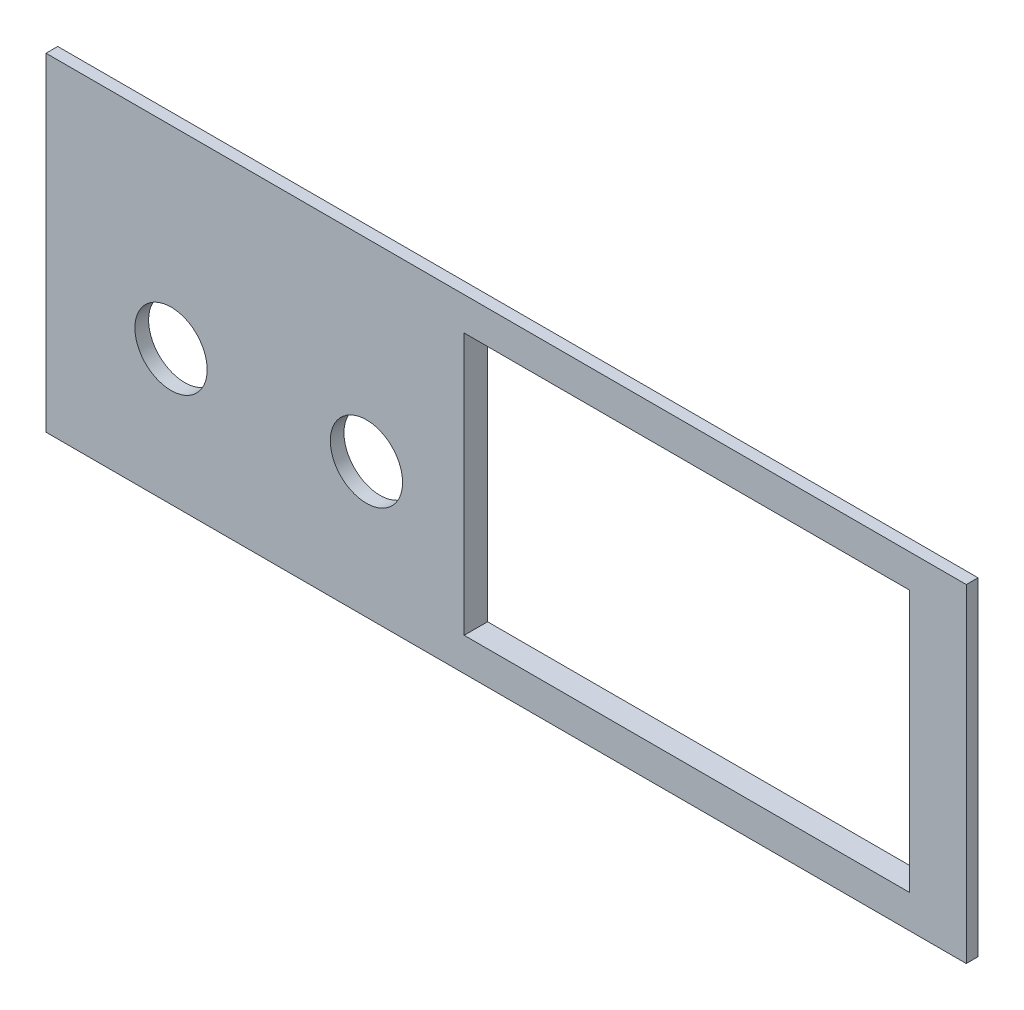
ISO-10303-21;
HEADER;
FILE_DESCRIPTION(('STEP AP214'),'2;1');
FILE_NAME('part.step','',(''),(''),'','','');
FILE_SCHEMA(('AUTOMOTIVE_DESIGN { 1 0 10303 214 1 1 1 1 }'));
ENDSEC;
DATA;
#1=APPLICATION_CONTEXT('core data for automotive mechanical design processes');
#2=APPLICATION_PROTOCOL_DEFINITION('international standard','automotive_design',2000,#1);
#3=PRODUCT_CONTEXT('',#1,'mechanical');
#4=PRODUCT('Part','Part','',(#3));
#5=PRODUCT_RELATED_PRODUCT_CATEGORY('part','',(#4));
#6=PRODUCT_DEFINITION_FORMATION('','',#4);
#7=PRODUCT_DEFINITION_CONTEXT('part definition',#1,'design');
#8=PRODUCT_DEFINITION('design','',#6,#7);
#9=PRODUCT_DEFINITION_SHAPE('','',#8);
#10=(LENGTH_UNIT() NAMED_UNIT(*) SI_UNIT(.MILLI.,.METRE.));
#11=(NAMED_UNIT(*) PLANE_ANGLE_UNIT() SI_UNIT($,.RADIAN.));
#12=(NAMED_UNIT(*) SI_UNIT($,.STERADIAN.) SOLID_ANGLE_UNIT());
#13=UNCERTAINTY_MEASURE_WITH_UNIT(LENGTH_MEASURE(1.E-05),#10,'distance_accuracy_value','');
#14=(GEOMETRIC_REPRESENTATION_CONTEXT(3) GLOBAL_UNCERTAINTY_ASSIGNED_CONTEXT((#13)) GLOBAL_UNIT_ASSIGNED_CONTEXT((#10,
#11,#12)) REPRESENTATION_CONTEXT('',''));
#15=CARTESIAN_POINT('',(0.,0.,0.));
#16=DIRECTION('',(0.,0.,1.));
#17=DIRECTION('',(1.,0.,0.));
#18=AXIS2_PLACEMENT_3D('',#15,#16,#17);
#19=CARTESIAN_POINT('',(0.,0.,0.));
#20=DIRECTION('',(0.,0.,1.));
#21=DIRECTION('',(1.,0.,0.));
#22=AXIS2_PLACEMENT_3D('',#19,#20,#21);
#23=PLANE('',#22);
#24=DIRECTION('',(1.,0.,0.));
#25=VECTOR('',#24,1.);
#26=CARTESIAN_POINT('',(-27.6333333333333,7.,0.));
#27=LINE('',#26,#25);
#28=CARTESIAN_POINT('',(-27.6333333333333,7.,0.));
#29=VERTEX_POINT('',#28);
#30=CARTESIAN_POINT('',(-26.8641025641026,7.,0.));
#31=VERTEX_POINT('',#30);
#32=EDGE_CURVE('E61',#29,#31,#27,.T.);
#33=ORIENTED_EDGE('',*,*,#32,.T.);
#34=DIRECTION('',(0.,1.,0.));
#35=VECTOR('',#34,1.);
#36=CARTESIAN_POINT('',(-26.8641025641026,7.,0.));
#37=LINE('',#36,#35);
#38=CARTESIAN_POINT('',(-26.8641025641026,11.,0.));
#39=VERTEX_POINT('',#38);
#40=EDGE_CURVE('E778',#31,#39,#37,.T.);
#41=ORIENTED_EDGE('',*,*,#40,.T.);
#42=DIRECTION('',(-1.,0.,0.));
#43=VECTOR('',#42,1.);
#44=CARTESIAN_POINT('',(-26.8641025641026,11.,0.));
#45=LINE('',#44,#43);
#46=CARTESIAN_POINT('',(-27.6333333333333,11.,0.));
#47=VERTEX_POINT('',#46);
#48=EDGE_CURVE('E781',#39,#47,#45,.T.);
#49=ORIENTED_EDGE('',*,*,#48,.T.);
#50=DIRECTION('',(0.,-1.,0.));
#51=VECTOR('',#50,1.);
#52=CARTESIAN_POINT('',(-27.6333333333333,11.,0.));
#53=LINE('',#52,#51);
#54=CARTESIAN_POINT('',(-27.6333333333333,9.41025641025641,0.));
#55=VERTEX_POINT('',#54);
#56=EDGE_CURVE('E784',#47,#55,#53,.T.);
#57=ORIENTED_EDGE('',*,*,#56,.T.);
#58=DIRECTION('',(-1.,0.,0.));
#59=VECTOR('',#58,1.);
#60=CARTESIAN_POINT('',(-27.6333333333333,9.41025641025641,0.));
#61=LINE('',#60,#59);
#62=CARTESIAN_POINT('',(-29.274358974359,9.41025641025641,0.));
#63=VERTEX_POINT('',#62);
#64=EDGE_CURVE('E787',#55,#63,#61,.T.);
#65=ORIENTED_EDGE('',*,*,#64,.T.);
#66=DIRECTION('',(0.,1.,0.));
#67=VECTOR('',#66,1.);
#68=CARTESIAN_POINT('',(-29.274358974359,9.41025641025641,0.));
#69=LINE('',#68,#67);
#70=CARTESIAN_POINT('',(-29.274358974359,11.,0.));
#71=VERTEX_POINT('',#70);
#72=EDGE_CURVE('E790',#63,#71,#69,.T.);
#73=ORIENTED_EDGE('',*,*,#72,.T.);
#74=DIRECTION('',(-1.,0.,0.));
#75=VECTOR('',#74,1.);
#76=CARTESIAN_POINT('',(-29.274358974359,11.,0.));
#77=LINE('',#76,#75);
#78=CARTESIAN_POINT('',(-30.0435897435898,11.,0.));
#79=VERTEX_POINT('',#78);
#80=EDGE_CURVE('E793',#71,#79,#77,.T.);
#81=ORIENTED_EDGE('',*,*,#80,.T.);
#82=DIRECTION('',(0.,-1.,0.));
#83=VECTOR('',#82,1.);
#84=CARTESIAN_POINT('',(-30.0435897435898,11.,0.));
#85=LINE('',#84,#83);
#86=CARTESIAN_POINT('',(-30.0435897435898,7.,0.));
#87=VERTEX_POINT('',#86);
#88=EDGE_CURVE('E796',#79,#87,#85,.T.);
#89=ORIENTED_EDGE('',*,*,#88,.T.);
#90=DIRECTION('',(1.,0.,0.));
#91=VECTOR('',#90,1.);
#92=CARTESIAN_POINT('',(-30.0435897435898,7.,0.));
#93=LINE('',#92,#91);
#94=CARTESIAN_POINT('',(-29.274358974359,7.,0.));
#95=VERTEX_POINT('',#94);
#96=EDGE_CURVE('E799',#87,#95,#93,.T.);
#97=ORIENTED_EDGE('',*,*,#96,.T.);
#98=DIRECTION('',(0.,1.,0.));
#99=VECTOR('',#98,1.);
#100=CARTESIAN_POINT('',(-29.274358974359,7.,0.));
#101=LINE('',#100,#99);
#102=CARTESIAN_POINT('',(-29.274358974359,8.74358974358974,0.));
#103=VERTEX_POINT('',#102);
#104=EDGE_CURVE('E802',#95,#103,#101,.T.);
#105=ORIENTED_EDGE('',*,*,#104,.T.);
#106=DIRECTION('',(1.,0.,0.));
#107=VECTOR('',#106,1.);
#108=CARTESIAN_POINT('',(-29.274358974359,8.74358974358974,0.));
#109=LINE('',#108,#107);
#110=CARTESIAN_POINT('',(-27.6333333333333,8.74358974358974,0.));
#111=VERTEX_POINT('',#110);
#112=EDGE_CURVE('E805',#103,#111,#109,.T.);
#113=ORIENTED_EDGE('',*,*,#112,.T.);
#114=DIRECTION('',(0.,-1.,0.));
#115=VECTOR('',#114,1.);
#116=CARTESIAN_POINT('',(-27.6333333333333,8.74358974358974,0.));
#117=LINE('',#116,#115);
#118=EDGE_CURVE('E754',#111,#29,#117,.T.);
#119=ORIENTED_EDGE('',*,*,#118,.T.);
#120=EDGE_LOOP('',(#33,#41,#49,#57,#65,#73,#81,#89,#97,#105,#113,#119));
#121=FACE_BOUND('',#120,.T.);
#122=DIRECTION('',(0.,1.,0.));
#123=VECTOR('',#122,1.);
#124=CARTESIAN_POINT('',(-34.7102564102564,7.,0.));
#125=LINE('',#124,#123);
#126=CARTESIAN_POINT('',(-34.7102564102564,7.,0.));
#127=VERTEX_POINT('',#126);
#128=CARTESIAN_POINT('',(-34.7102564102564,11.,0.));
#129=VERTEX_POINT('',#128);
#130=EDGE_CURVE('E749',#127,#129,#125,.T.);
#131=ORIENTED_EDGE('',*,*,#130,.T.);
#132=DIRECTION('',(-1.,0.,0.));
#133=VECTOR('',#132,1.);
#134=CARTESIAN_POINT('',(-34.7102564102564,11.,0.));
#135=LINE('',#134,#133);
#136=CARTESIAN_POINT('',(-37.8897435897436,11.,0.));
#137=VERTEX_POINT('',#136);
#138=EDGE_CURVE('E1975',#129,#137,#135,.T.);
#139=ORIENTED_EDGE('',*,*,#138,.T.);
#140=DIRECTION('',(0.,-1.,0.));
#141=VECTOR('',#140,1.);
#142=CARTESIAN_POINT('',(-37.8897435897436,11.,0.));
#143=LINE('',#142,#141);
#144=CARTESIAN_POINT('',(-37.8897435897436,7.,0.));
#145=VERTEX_POINT('',#144);
#146=EDGE_CURVE('E1978',#137,#145,#143,.T.);
#147=ORIENTED_EDGE('',*,*,#146,.T.);
#148=DIRECTION('',(1.,0.,0.));
#149=VECTOR('',#148,1.);
#150=CARTESIAN_POINT('',(-37.8897435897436,7.,0.));
#151=LINE('',#150,#149);
#152=CARTESIAN_POINT('',(-37.1205128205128,7.,0.));
#153=VERTEX_POINT('',#152);
#154=EDGE_CURVE('E1981',#145,#153,#151,.T.);
#155=ORIENTED_EDGE('',*,*,#154,.T.);
#156=DIRECTION('',(0.,1.,0.));
#157=VECTOR('',#156,1.);
#158=CARTESIAN_POINT('',(-37.1205128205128,7.,0.));
#159=LINE('',#158,#157);
#160=CARTESIAN_POINT('',(-37.1205128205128,10.3333333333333,0.));
#161=VERTEX_POINT('',#160);
#162=EDGE_CURVE('E1984',#153,#161,#159,.T.);
#163=ORIENTED_EDGE('',*,*,#162,.T.);
#164=DIRECTION('',(1.,0.,0.));
#165=VECTOR('',#164,1.);
#166=CARTESIAN_POINT('',(-37.1205128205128,10.3333333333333,0.));
#167=LINE('',#166,#165);
#168=CARTESIAN_POINT('',(-35.4794871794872,10.3333333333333,0.));
#169=VERTEX_POINT('',#168);
#170=EDGE_CURVE('E1987',#161,#169,#167,.T.);
#171=ORIENTED_EDGE('',*,*,#170,.T.);
#172=DIRECTION('',(0.,-1.,0.));
#173=VECTOR('',#172,1.);
#174=CARTESIAN_POINT('',(-35.4794871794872,10.3333333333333,0.));
#175=LINE('',#174,#173);
#176=CARTESIAN_POINT('',(-35.4794871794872,7.,0.));
#177=VERTEX_POINT('',#176);
#178=EDGE_CURVE('E1990',#169,#177,#175,.T.);
#179=ORIENTED_EDGE('',*,*,#178,.T.);
#180=DIRECTION('',(1.,0.,0.));
#181=VECTOR('',#180,1.);
#182=CARTESIAN_POINT('',(-35.4794871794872,7.,0.));
#183=LINE('',#182,#181);
#184=EDGE_CURVE('E1958',#177,#127,#183,.T.);
#185=ORIENTED_EDGE('',*,*,#184,.T.);
#186=EDGE_LOOP('',(#131,#139,#147,#155,#163,#171,#179,#185));
#187=FACE_BOUND('',#186,.T.);
#188=DIRECTION('',(0.,1.,0.));
#189=VECTOR('',#188,1.);
#190=CARTESIAN_POINT('',(-16.9153846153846,7.,0.));
#191=LINE('',#190,#189);
#192=CARTESIAN_POINT('',(-16.9153846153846,7.,0.));
#193=VERTEX_POINT('',#192);
#194=CARTESIAN_POINT('',(-16.9153846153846,11.,0.));
#195=VERTEX_POINT('',#194);
#196=EDGE_CURVE('E1681',#193,#195,#191,.T.);
#197=ORIENTED_EDGE('',*,*,#196,.T.);
#198=DIRECTION('',(-1.,0.,0.));
#199=VECTOR('',#198,1.);
#200=CARTESIAN_POINT('',(-16.9153846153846,11.,0.));
#201=LINE('',#200,#199);
#202=CARTESIAN_POINT('',(-17.6846153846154,11.,0.));
#203=VERTEX_POINT('',#202);
#204=EDGE_CURVE('E1684',#195,#203,#201,.T.);
#205=ORIENTED_EDGE('',*,*,#204,.T.);
#206=DIRECTION('',(0.,-1.,0.));
#207=VECTOR('',#206,1.);
#208=CARTESIAN_POINT('',(-17.6846153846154,11.,0.));
#209=LINE('',#208,#207);
#210=CARTESIAN_POINT('',(-17.6846153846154,9.30769230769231,0.));
#211=VERTEX_POINT('',#210);
#212=EDGE_CURVE('E1688',#203,#211,#209,.T.);
#213=ORIENTED_EDGE('',*,*,#212,.T.);
#214=CARTESIAN_POINT('',(-17.6846153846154,9.30769230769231,0.));
#215=CARTESIAN_POINT('',(-17.706819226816,9.31011703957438,0.));
#216=CARTESIAN_POINT('',(-17.7495014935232,9.314778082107,0.));
#217=CARTESIAN_POINT('',(-17.8106929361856,9.32547065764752,0.));
#218=CARTESIAN_POINT('',(-17.8666621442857,9.33749925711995,0.));
#219=CARTESIAN_POINT('',(-17.9164255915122,9.35409361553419,0.));
#220=CARTESIAN_POINT('',(-17.9611088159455,9.37119621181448,0.));
#221=CARTESIAN_POINT('',(-18.0000209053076,9.39203269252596,0.));
#222=CARTESIAN_POINT('',(-18.03276603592,9.41621693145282,0.));
#223=CARTESIAN_POINT('',(-18.0625301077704,9.44361704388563,0.));
#224=CARTESIAN_POINT('',(-18.0896004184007,9.4796309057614,0.));
#225=CARTESIAN_POINT('',(-18.1190293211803,9.52555120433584,0.));
#226=CARTESIAN_POINT('',(-18.151939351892,9.5836001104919,0.));
#227=CARTESIAN_POINT('',(-18.1871658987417,9.65417196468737,0.));
#228=CARTESIAN_POINT('',(-18.2280235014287,9.73582737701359,0.));
#229=CARTESIAN_POINT('',(-18.2695980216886,9.83079636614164,0.));
#230=CARTESIAN_POINT('',(-18.3164581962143,9.9370848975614,0.));
#231=CARTESIAN_POINT('',(-18.3476974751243,10.0124866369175,0.));
#232=CARTESIAN_POINT('',(-18.3641025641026,10.0520833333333,0.));
#233=B_SPLINE_CURVE_WITH_KNOTS('',3,(#214,#215,#216,#217,#218,#219,#220,#221,#222,#223,#224,
#225,#226,#227,#228,#229,#230,#231,#232),.UNSPECIFIED.,.F.,.F.,(4,1,1,1,1,1,1,1,1,1,1,1,1,1,1,1,
4),(0.,0.0614459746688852,0.118117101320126,0.170893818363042,0.218775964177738,
0.262314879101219,0.302437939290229,0.339778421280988,0.374095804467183,0.413354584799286,
0.463301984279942,0.524200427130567,0.596846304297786,0.68033892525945,0.775415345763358,
0.882060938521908,1.),.UNSPECIFIED.);
#234=CARTESIAN_POINT('',(-18.3641025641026,10.0520833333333,0.));
#235=VERTEX_POINT('',#234);
#236=EDGE_CURVE('E1691',#211,#235,#233,.T.);
#237=ORIENTED_EDGE('',*,*,#236,.T.);
#238=CARTESIAN_POINT('',(-18.3641025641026,10.0520833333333,0.));
#239=CARTESIAN_POINT('',(-18.3853217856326,10.1027464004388,0.));
#240=CARTESIAN_POINT('',(-18.4259734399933,10.1998063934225,0.));
#241=CARTESIAN_POINT('',(-18.4908709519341,10.3362048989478,0.));
#242=CARTESIAN_POINT('',(-18.5557505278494,10.4576720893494,0.));
#243=CARTESIAN_POINT('',(-18.6202301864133,10.5645004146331,0.));
#244=CARTESIAN_POINT('',(-18.6849236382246,10.6564580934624,0.));
#245=CARTESIAN_POINT('',(-18.7498129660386,10.7331272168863,0.));
#246=CARTESIAN_POINT('',(-18.8145339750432,10.7956903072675,0.));
#247=CARTESIAN_POINT('',(-18.8612462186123,10.8272329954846,0.));
#248=CARTESIAN_POINT('',(-18.8833333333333,10.8421474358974,0.));
#249=B_SPLINE_CURVE_WITH_KNOTS('',3,(#238,#239,#240,#241,#242,#243,#244,#245,#246,#247,#248),
.UNSPECIFIED.,.F.,.F.,(4,1,1,1,1,1,1,1,4),(0.,0.171870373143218,0.329268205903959,
0.472492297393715,0.6026527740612,0.719541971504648,0.823891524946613,0.916730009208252,1.),.UNSPECIFIED.);
#250=CARTESIAN_POINT('',(-18.8833333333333,10.8421474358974,0.));
#251=VERTEX_POINT('',#250);
#252=EDGE_CURVE('E1696',#235,#251,#249,.T.);
#253=ORIENTED_EDGE('',*,*,#252,.T.);
#254=CARTESIAN_POINT('',(-18.8833333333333,10.8421474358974,0.));
#255=CARTESIAN_POINT('',(-18.9063583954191,10.8545985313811,0.));
#256=CARTESIAN_POINT('',(-18.954483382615,10.8806227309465,0.));
#257=CARTESIAN_POINT('',(-19.0344209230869,10.912601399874,0.));
#258=CARTESIAN_POINT('',(-19.1245937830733,10.9381882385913,0.));
#259=CARTESIAN_POINT('',(-19.223966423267,10.9610195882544,0.));
#260=CARTESIAN_POINT('',(-19.3335650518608,10.9772889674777,0.));
#261=CARTESIAN_POINT('',(-19.4528286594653,10.9891056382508,0.));
#262=CARTESIAN_POINT('',(-19.5819625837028,10.9963373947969,0.));
#263=CARTESIAN_POINT('',(-19.6712511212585,10.9971668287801,0.));
#264=CARTESIAN_POINT('',(-19.7174679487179,10.9975961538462,0.));
#265=B_SPLINE_CURVE_WITH_KNOTS('',3,(#254,#255,#256,#257,#258,#259,#260,#261,#262,#263,#264),
.UNSPECIFIED.,.F.,.F.,(4,1,1,1,1,1,1,1,4),(0.,0.0915197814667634,0.191286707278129,
0.300383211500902,0.419161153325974,0.547740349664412,0.687663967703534,0.838331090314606,1.),.UNSPECIFIED.);
#266=CARTESIAN_POINT('',(-19.7174679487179,10.9975961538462,0.));
#267=VERTEX_POINT('',#266);
#268=EDGE_CURVE('E1704',#251,#267,#265,.T.);
#269=ORIENTED_EDGE('',*,*,#268,.T.);
#270=CARTESIAN_POINT('',(-19.717467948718,10.9975961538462,0.));
#271=CARTESIAN_POINT('',(-19.7236118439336,10.9975509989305,0.));
#272=CARTESIAN_POINT('',(-19.7383079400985,10.9974429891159,0.));
#273=CARTESIAN_POINT('',(-19.7644711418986,10.9986315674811,0.));
#274=CARTESIAN_POINT('',(-19.7986636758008,10.9992392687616,0.));
#275=CARTESIAN_POINT('',(-19.8243056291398,10.9997294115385,0.));
#276=CARTESIAN_POINT('',(-19.8384615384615,11.,0.));
#277=B_SPLINE_CURVE_WITH_KNOTS('',3,(#270,#271,#272,#273,#274,#275,#276),.UNSPECIFIED.,.F.,.F.,
(4,1,1,1,4),(0.,0.152280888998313,0.364253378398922,0.649029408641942,1.),.UNSPECIFIED.);
#278=CARTESIAN_POINT('',(-19.8384615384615,11.,0.));
#279=VERTEX_POINT('',#278);
#280=EDGE_CURVE('E1712',#267,#279,#277,.T.);
#281=ORIENTED_EDGE('',*,*,#280,.T.);
#282=DIRECTION('',(0.,-1.,0.));
#283=VECTOR('',#282,1.);
#284=CARTESIAN_POINT('',(-19.8384615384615,11.,0.));
#285=LINE('',#284,#283);
#286=CARTESIAN_POINT('',(-19.8384615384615,10.4358974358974,0.));
#287=VERTEX_POINT('',#286);
#288=EDGE_CURVE('E1720',#279,#287,#285,.T.);
#289=ORIENTED_EDGE('',*,*,#288,.T.);
#290=DIRECTION('',(0.999614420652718,0.0277670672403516,0.));
#291=VECTOR('',#290,1.);
#292=CARTESIAN_POINT('',(-19.8384615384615,10.4358974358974,0.));
#293=LINE('',#292,#291);
#294=CARTESIAN_POINT('',(-19.7230769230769,10.4391025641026,0.));
#295=VERTEX_POINT('',#294);
#296=EDGE_CURVE('E1726',#287,#295,#293,.T.);
#297=ORIENTED_EDGE('',*,*,#296,.T.);
#298=CARTESIAN_POINT('',(-19.7230769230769,10.4391025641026,0.));
#299=CARTESIAN_POINT('',(-19.6840513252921,10.4383678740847,0.));
#300=CARTESIAN_POINT('',(-19.6114241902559,10.4370006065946,0.));
#301=CARTESIAN_POINT('',(-19.5109754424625,10.4264310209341,0.));
#302=CARTESIAN_POINT('',(-19.4268433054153,10.4080729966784,0.));
#303=CARTESIAN_POINT('',(-19.3580439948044,10.3801303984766,0.));
#304=CARTESIAN_POINT('',(-19.3002911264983,10.3445561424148,0.));
#305=CARTESIAN_POINT('',(-19.2515218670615,10.2998217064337,0.));
#306=CARTESIAN_POINT('',(-19.2054821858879,10.2496928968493,0.));
#307=CARTESIAN_POINT('',(-19.1741024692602,10.1989062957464,0.));
#308=CARTESIAN_POINT('',(-19.1483551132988,10.1523588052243,0.));
#309=CARTESIAN_POINT('',(-19.1281862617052,10.108054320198,0.));
#310=CARTESIAN_POINT('',(-19.1044449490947,10.0560316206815,0.));
#311=CARTESIAN_POINT('',(-19.0803972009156,9.9948340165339,0.));
#312=CARTESIAN_POINT('',(-19.0518114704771,9.92635766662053,0.));
#313=CARTESIAN_POINT('',(-19.022459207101,9.84893554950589,0.));
#314=CARTESIAN_POINT('',(-18.9902944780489,9.76360346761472,0.));
#315=CARTESIAN_POINT('',(-18.9689668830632,9.70356376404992,0.));
#316=CARTESIAN_POINT('',(-18.9578525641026,9.67227564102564,0.));
#317=B_SPLINE_CURVE_WITH_KNOTS('',3,(#298,#299,#300,#301,#302,#303,#304,#305,#306,#307,#308,
#309,#310,#311,#312,#313,#314,#315,#316),.UNSPECIFIED.,.F.,.F.,(4,1,1,1,1,1,1,1,1,1,1,1,1,1,1,1,
4),(0.,0.0973208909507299,0.181115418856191,0.25157120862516,0.311324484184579,0.36548707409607,
0.419760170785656,0.475914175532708,0.534675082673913,0.568064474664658,0.608592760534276,
0.656009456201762,0.710689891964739,0.772545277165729,0.841085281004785,0.9171857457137,1.),.UNSPECIFIED.);
#318=CARTESIAN_POINT('',(-18.9578525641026,9.67227564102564,0.));
#319=VERTEX_POINT('',#318);
#320=EDGE_CURVE('E1729',#295,#319,#317,.T.);
#321=ORIENTED_EDGE('',*,*,#320,.T.);
#322=CARTESIAN_POINT('',(-18.9578525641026,9.67227564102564,0.));
#323=CARTESIAN_POINT('',(-18.9456748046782,9.63900637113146,0.));
#324=CARTESIAN_POINT('',(-18.9220654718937,9.57450638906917,0.));
#325=CARTESIAN_POINT('',(-18.8817717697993,9.48361238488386,0.));
#326=CARTESIAN_POINT('',(-18.8410871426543,9.40073032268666,0.));
#327=CARTESIAN_POINT('',(-18.7980792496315,9.32424113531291,0.));
#328=CARTESIAN_POINT('',(-18.7455306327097,9.25197820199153,0.));
#329=CARTESIAN_POINT('',(-18.674740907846,9.1862935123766,0.));
#330=CARTESIAN_POINT('',(-18.5895505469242,9.12064763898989,0.));
#331=CARTESIAN_POINT('',(-18.5243229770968,9.08258487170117,0.));
#332=CARTESIAN_POINT('',(-18.4899038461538,9.0625,0.));
#333=B_SPLINE_CURVE_WITH_KNOTS('',3,(#322,#323,#324,#325,#326,#327,#328,#329,#330,#331,#332),
.UNSPECIFIED.,.F.,.F.,(4,1,1,1,1,1,1,1,4),(0.,0.134305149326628,0.26038081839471,
0.376786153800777,0.484319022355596,0.592891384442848,0.713940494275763,0.849052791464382,1.),.UNSPECIFIED.);
#334=CARTESIAN_POINT('',(-18.4899038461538,9.0625,0.));
#335=VERTEX_POINT('',#334);
#336=EDGE_CURVE('E1734',#319,#335,#333,.T.);
#337=ORIENTED_EDGE('',*,*,#336,.T.);
#338=CARTESIAN_POINT('',(-18.4899038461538,9.0625,0.));
#339=CARTESIAN_POINT('',(-18.534389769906,9.04806637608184,0.));
#340=CARTESIAN_POINT('',(-18.6223531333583,9.01952633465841,0.));
#341=CARTESIAN_POINT('',(-18.7423090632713,8.94869466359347,0.));
#342=CARTESIAN_POINT('',(-18.8514481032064,8.86083260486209,0.));
#343=CARTESIAN_POINT('',(-18.9300602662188,8.76999125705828,0.));
#344=CARTESIAN_POINT('',(-18.9895619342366,8.68875115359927,0.));
#345=CARTESIAN_POINT('',(-19.0361133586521,8.62143763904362,0.));
#346=CARTESIAN_POINT('',(-19.0833404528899,8.54802418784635,0.));
#347=CARTESIAN_POINT('',(-19.1325680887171,8.46918307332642,0.));
#348=CARTESIAN_POINT('',(-19.1805911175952,8.38273427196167,0.));
#349=CARTESIAN_POINT('',(-19.2327029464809,8.29201149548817,0.));
#350=CARTESIAN_POINT('',(-19.283305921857,8.19384450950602,0.));
#351=CARTESIAN_POINT('',(-19.3176505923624,8.12661217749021,0.));
#352=CARTESIAN_POINT('',(-19.3352564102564,8.09214743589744,0.));
#353=B_SPLINE_CURVE_WITH_KNOTS('',3,(#338,#339,#340,#341,#342,#343,#344,#345,#346,#347,#348,
#349,#350,#351,#352),.UNSPECIFIED.,.F.,.F.,(4,1,1,1,1,1,1,1,1,1,1,1,4),(0.,0.10542546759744,
0.2084609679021,0.312741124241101,0.42093223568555,0.478768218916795,0.54039336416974,
0.605866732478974,0.676067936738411,0.750424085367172,0.829350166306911,0.912521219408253,1.),.UNSPECIFIED.);
#354=CARTESIAN_POINT('',(-19.3352564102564,8.09214743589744,0.));
#355=VERTEX_POINT('',#354);
#356=EDGE_CURVE('E1742',#335,#355,#353,.T.);
#357=ORIENTED_EDGE('',*,*,#356,.T.);
#358=DIRECTION('',(-0.452700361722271,-0.891662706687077,0.));
#359=VECTOR('',#358,1.);
#360=CARTESIAN_POINT('',(-19.3352564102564,8.09214743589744,0.));
#361=LINE('',#360,#359);
#362=CARTESIAN_POINT('',(-19.8897435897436,7.,0.));
#363=VERTEX_POINT('',#362);
#364=EDGE_CURVE('E1750',#355,#363,#361,.T.);
#365=ORIENTED_EDGE('',*,*,#364,.T.);
#366=DIRECTION('',(1.,0.,0.));
#367=VECTOR('',#366,1.);
#368=CARTESIAN_POINT('',(-19.8897435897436,7.,0.));
#369=LINE('',#368,#367);
#370=CARTESIAN_POINT('',(-18.9185897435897,7.,0.));
#371=VERTEX_POINT('',#370);
#372=EDGE_CURVE('E1756',#363,#371,#369,.T.);
#373=ORIENTED_EDGE('',*,*,#372,.T.);
#374=DIRECTION('',(0.445518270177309,0.895272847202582,0.));
#375=VECTOR('',#374,1.);
#376=CARTESIAN_POINT('',(-18.9185897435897,7.,0.));
#377=LINE('',#376,#375);
#378=CARTESIAN_POINT('',(-18.4129807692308,8.01602564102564,0.));
#379=VERTEX_POINT('',#378);
#380=EDGE_CURVE('E1759',#371,#379,#377,.T.);
#381=ORIENTED_EDGE('',*,*,#380,.T.);
#382=CARTESIAN_POINT('',(-18.4129807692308,8.01602564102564,0.));
#383=CARTESIAN_POINT('',(-18.4105692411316,8.02029452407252,0.));
#384=CARTESIAN_POINT('',(-18.4046871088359,8.03070706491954,0.));
#385=CARTESIAN_POINT('',(-18.3945628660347,8.0492020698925,0.));
#386=CARTESIAN_POINT('',(-18.3797998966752,8.0719166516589,0.));
#387=CARTESIAN_POINT('',(-18.3696371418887,8.08916457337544,0.));
#388=CARTESIAN_POINT('',(-18.3641025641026,8.09855769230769,0.));
#389=B_SPLINE_CURVE_WITH_KNOTS('',3,(#382,#383,#384,#385,#386,#387,#388),.UNSPECIFIED.,.F.,.F.,
(4,1,1,1,4),(0.,0.153329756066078,0.373997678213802,0.659082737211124,1.),.UNSPECIFIED.);
#390=CARTESIAN_POINT('',(-18.3641025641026,8.09855769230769,0.));
#391=VERTEX_POINT('',#390);
#392=EDGE_CURVE('E1762',#379,#391,#389,.T.);
#393=ORIENTED_EDGE('',*,*,#392,.T.);
#394=CARTESIAN_POINT('',(-18.3641025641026,8.09855769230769,0.));
#395=CARTESIAN_POINT('',(-18.3600400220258,8.10520303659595,0.));
#396=CARTESIAN_POINT('',(-18.3483707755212,8.12429112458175,0.));
#397=CARTESIAN_POINT('',(-18.3280393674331,8.16361016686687,0.));
#398=CARTESIAN_POINT('',(-18.2966608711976,8.22040113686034,0.));
#399=CARTESIAN_POINT('',(-18.2731984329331,8.26490662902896,0.));
#400=CARTESIAN_POINT('',(-18.2599358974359,8.2900641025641,0.));
#401=B_SPLINE_CURVE_WITH_KNOTS('',3,(#394,#395,#396,#397,#398,#399,#400),.UNSPECIFIED.,.F.,.F.,
(4,1,1,1,4),(0.,0.107147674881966,0.307770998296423,0.608705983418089,1.),.UNSPECIFIED.);
#402=CARTESIAN_POINT('',(-18.2599358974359,8.2900641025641,0.));
#403=VERTEX_POINT('',#402);
#404=EDGE_CURVE('E1767',#391,#403,#401,.T.);
#405=ORIENTED_EDGE('',*,*,#404,.T.);
#406=CARTESIAN_POINT('',(-18.2599358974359,8.2900641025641,0.));
#407=CARTESIAN_POINT('',(-18.2468680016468,8.31384416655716,0.));
#408=CARTESIAN_POINT('',(-18.2218186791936,8.35942721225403,0.));
#409=CARTESIAN_POINT('',(-18.1855363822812,8.42474583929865,0.));
#410=CARTESIAN_POINT('',(-18.1492132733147,8.48199131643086,0.));
#411=CARTESIAN_POINT('',(-18.115885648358,8.53292715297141,0.));
#412=CARTESIAN_POINT('',(-18.0837611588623,8.57602021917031,0.));
#413=CARTESIAN_POINT('',(-18.0540975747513,8.61291177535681,0.));
#414=CARTESIAN_POINT('',(-18.0255535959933,8.64228133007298,0.));
#415=CARTESIAN_POINT('',(-17.9896366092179,8.67350548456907,0.));
#416=CARTESIAN_POINT('',(-17.937496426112,8.70196186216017,0.));
#417=CARTESIAN_POINT('',(-17.8650028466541,8.72546694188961,0.));
#418=CARTESIAN_POINT('',(-17.7792374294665,8.7406296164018,0.));
#419=CARTESIAN_POINT('',(-17.7175376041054,8.74255981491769,0.));
#420=CARTESIAN_POINT('',(-17.6846153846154,8.74358974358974,0.));
#421=B_SPLINE_CURVE_WITH_KNOTS('',3,(#406,#407,#408,#409,#410,#411,#412,#413,#414,#415,#416,
#417,#418,#419,#420),.UNSPECIFIED.,.F.,.F.,(4,1,1,1,1,1,1,1,1,1,1,1,4),(0.,0.103312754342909,
0.19803605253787,0.284375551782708,0.361370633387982,0.429706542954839,0.488948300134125,
0.541443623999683,0.585452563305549,0.669706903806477,0.76521296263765,0.874720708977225,1.),.UNSPECIFIED.);
#422=CARTESIAN_POINT('',(-17.6846153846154,8.74358974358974,0.));
#423=VERTEX_POINT('',#422);
#424=EDGE_CURVE('E1775',#403,#423,#421,.T.);
#425=ORIENTED_EDGE('',*,*,#424,.T.);
#426=DIRECTION('',(0.,-1.,0.));
#427=VECTOR('',#426,1.);
#428=CARTESIAN_POINT('',(-17.6846153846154,8.74358974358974,0.));
#429=LINE('',#428,#427);
#430=CARTESIAN_POINT('',(-17.6846153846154,7.,0.));
#431=VERTEX_POINT('',#430);
#432=EDGE_CURVE('E1783',#423,#431,#429,.T.);
#433=ORIENTED_EDGE('',*,*,#432,.T.);
#434=DIRECTION('',(1.,0.,0.));
#435=VECTOR('',#434,1.);
#436=CARTESIAN_POINT('',(-17.6846153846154,7.,0.));
#437=LINE('',#436,#435);
#438=EDGE_CURVE('E949',#431,#193,#437,.T.);
#439=ORIENTED_EDGE('',*,*,#438,.T.);
#440=EDGE_LOOP('',(#197,#205,#213,#237,#253,#269,#281,#289,#297,#321,#337,#357,#365,#373,#381,
#393,#405,#425,#433,#439));
#441=FACE_BOUND('',#440,.T.);
#442=DIRECTION('',(0.,1.,0.));
#443=VECTOR('',#442,1.);
#444=CARTESIAN_POINT('',(44.3,15.,0.));
#445=LINE('',#444,#443);
#446=CARTESIAN_POINT('',(44.3,-15.,0.));
#447=VERTEX_POINT('',#446);
#448=CARTESIAN_POINT('',(44.3,15.,0.));
#449=VERTEX_POINT('',#448);
#450=EDGE_CURVE('E1231',#447,#449,#445,.T.);
#451=ORIENTED_EDGE('',*,*,#450,.F.);
#452=DIRECTION('',(1.,0.,0.));
#453=VECTOR('',#452,1.);
#454=CARTESIAN_POINT('',(-44.3,-15.,0.));
#455=LINE('',#454,#453);
#456=CARTESIAN_POINT('',(-44.3,-15.,0.));
#457=VERTEX_POINT('',#456);
#458=EDGE_CURVE('E1241',#457,#447,#455,.T.);
#459=ORIENTED_EDGE('',*,*,#458,.F.);
#460=DIRECTION('',(0.,-1.,0.));
#461=VECTOR('',#460,1.);
#462=CARTESIAN_POINT('',(-44.3,15.,0.));
#463=LINE('',#462,#461);
#464=CARTESIAN_POINT('',(-44.3,15.,0.));
#465=VERTEX_POINT('',#464);
#466=EDGE_CURVE('E1230',#465,#457,#463,.T.);
#467=ORIENTED_EDGE('',*,*,#466,.F.);
#468=DIRECTION('',(-1.,0.,0.));
#469=VECTOR('',#468,1.);
#470=CARTESIAN_POINT('',(-44.3,15.,0.));
#471=LINE('',#470,#469);
#472=EDGE_CURVE('E1222',#449,#465,#471,.T.);
#473=ORIENTED_EDGE('',*,*,#472,.F.);
#474=EDGE_LOOP('',(#451,#459,#467,#473));
#475=FACE_BOUND('',#474,.T.);
#476=DIRECTION('',(1.,0.,0.));
#477=VECTOR('',#476,1.);
#478=CARTESIAN_POINT('',(41.3,13.4,0.));
#479=LINE('',#478,#477);
#480=CARTESIAN_POINT('',(-4.30000000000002,13.4,0.));
#481=VERTEX_POINT('',#480);
#482=CARTESIAN_POINT('',(41.3,13.4,0.));
#483=VERTEX_POINT('',#482);
#484=EDGE_CURVE('E1289',#481,#483,#479,.T.);
#485=ORIENTED_EDGE('',*,*,#484,.F.);
#486=DIRECTION('',(0.,1.,0.));
#487=VECTOR('',#486,1.);
#488=CARTESIAN_POINT('',(-4.30000000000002,13.4,0.));
#489=LINE('',#488,#487);
#490=CARTESIAN_POINT('',(-4.30000000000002,-13.4,0.));
#491=VERTEX_POINT('',#490);
#492=EDGE_CURVE('E1257',#491,#481,#489,.T.);
#493=ORIENTED_EDGE('',*,*,#492,.F.);
#494=DIRECTION('',(-1.,0.,0.));
#495=VECTOR('',#494,1.);
#496=CARTESIAN_POINT('',(41.3,-13.4,0.));
#497=LINE('',#496,#495);
#498=CARTESIAN_POINT('',(41.3,-13.4,0.));
#499=VERTEX_POINT('',#498);
#500=EDGE_CURVE('E1278',#499,#491,#497,.T.);
#501=ORIENTED_EDGE('',*,*,#500,.F.);
#502=DIRECTION('',(0.,-1.,0.));
#503=VECTOR('',#502,1.);
#504=CARTESIAN_POINT('',(41.3,13.4,0.));
#505=LINE('',#504,#503);
#506=EDGE_CURVE('E1292',#483,#499,#505,.T.);
#507=ORIENTED_EDGE('',*,*,#506,.F.);
#508=EDGE_LOOP('',(#485,#493,#501,#507));
#509=FACE_BOUND('',#508,.T.);
#510=CARTESIAN_POINT('',(-34.3,-3.,0.));
#511=DIRECTION('',(0.,0.,-1.));
#512=DIRECTION('',(-1.,0.,0.));
#513=AXIS2_PLACEMENT_3D('',#510,#511,#512);
#514=CIRCLE('',#513,8.);
#515=CARTESIAN_POINT('',(-42.3,-3.,0.));
#516=VERTEX_POINT('',#515);
#517=EDGE_CURVE('E654',#516,#516,#514,.T.);
#518=ORIENTED_EDGE('',*,*,#517,.F.);
#519=EDGE_LOOP('',(#518));
#520=FACE_BOUND('',#519,.T.);
#521=CARTESIAN_POINT('',(-14.3,-3.,0.));
#522=DIRECTION('',(0.,0.,-1.));
#523=DIRECTION('',(-1.,0.,0.));
#524=AXIS2_PLACEMENT_3D('',#521,#522,#523);
#525=CIRCLE('',#524,8.);
#526=CARTESIAN_POINT('',(-22.3,-3.,0.));
#527=VERTEX_POINT('',#526);
#528=EDGE_CURVE('E1259',#527,#527,#525,.T.);
#529=ORIENTED_EDGE('',*,*,#528,.F.);
#530=EDGE_LOOP('',(#529));
#531=FACE_BOUND('',#530,.T.);
#532=CARTESIAN_POINT('',(-14.356891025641,6.94871794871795,0.));
#533=CARTESIAN_POINT('',(-14.2860423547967,6.95049118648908,0.));
#534=CARTESIAN_POINT('',(-14.1473711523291,6.9539619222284,0.));
#535=CARTESIAN_POINT('',(-13.9449878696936,6.97870576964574,0.));
#536=CARTESIAN_POINT('',(-13.7538815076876,7.02111474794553,0.));
#537=CARTESIAN_POINT('',(-13.574188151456,7.08088114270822,0.));
#538=CARTESIAN_POINT('',(-13.4046822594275,7.15595562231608,0.));
#539=CARTESIAN_POINT('',(-13.2469288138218,7.24940392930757,0.));
#540=CARTESIAN_POINT('',(-13.1008406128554,7.36033577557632,0.));
#541=CARTESIAN_POINT('',(-12.9665633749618,7.48681932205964,0.));
#542=CARTESIAN_POINT('',(-12.8448347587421,7.62762619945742,0.));
#543=CARTESIAN_POINT('',(-12.740975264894,7.78365473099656,0.));
#544=CARTESIAN_POINT('',(-12.650939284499,7.95091039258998,0.));
#545=CARTESIAN_POINT('',(-12.5793646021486,8.13192670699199,0.));
#546=CARTESIAN_POINT('',(-12.5219228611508,8.32484124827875,0.));
#547=CARTESIAN_POINT('',(-12.4827711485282,8.53076406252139,0.));
#548=CARTESIAN_POINT('',(-12.4580655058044,8.74912839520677,0.));
#549=CARTESIAN_POINT('',(-12.4552783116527,8.89896846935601,0.));
#550=CARTESIAN_POINT('',(-12.4538461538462,8.97596153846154,0.));
#551=B_SPLINE_CURVE_WITH_KNOTS('',3,(#532,#533,#534,#535,#536,#537,#538,#539,#540,#541,#542,
#543,#544,#545,#546,#547,#548,#549,#550),.UNSPECIFIED.,.F.,.F.,(4,1,1,1,1,1,1,1,1,1,1,1,1,1,1,1,
4),(0.,0.0675548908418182,0.13222432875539,0.194080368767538,0.253925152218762,
0.312527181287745,0.370537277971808,0.428355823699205,0.48709717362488,0.546162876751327,
0.605432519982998,0.665482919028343,0.726969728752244,0.790717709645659,0.857154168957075,
0.926600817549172,1.),.UNSPECIFIED.);
#552=CARTESIAN_POINT('',(-14.356891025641,6.94871794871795,0.));
#553=VERTEX_POINT('',#552);
#554=CARTESIAN_POINT('',(-12.4538461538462,8.97596153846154,0.));
#555=VERTEX_POINT('',#554);
#556=EDGE_CURVE('E879',#553,#555,#551,.T.);
#557=ORIENTED_EDGE('',*,*,#556,.T.);
#558=CARTESIAN_POINT('',(-12.4538461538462,8.97596153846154,0.));
#559=CARTESIAN_POINT('',(-12.4541292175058,9.02539188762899,0.));
#560=CARTESIAN_POINT('',(-12.4546851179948,9.12246671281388,0.));
#561=CARTESIAN_POINT('',(-12.4643175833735,9.26487912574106,0.));
#562=CARTESIAN_POINT('',(-12.4770139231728,9.40138674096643,0.));
#563=CARTESIAN_POINT('',(-12.4976898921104,9.53145262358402,0.));
#564=CARTESIAN_POINT('',(-12.5220123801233,9.65568552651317,0.));
#565=CARTESIAN_POINT('',(-12.5524333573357,9.77404857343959,0.));
#566=CARTESIAN_POINT('',(-12.5890798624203,9.88612666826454,0.));
#567=CARTESIAN_POINT('',(-12.6182324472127,9.95768732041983,0.));
#568=CARTESIAN_POINT('',(-12.6325320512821,9.99278846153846,0.));
#569=B_SPLINE_CURVE_WITH_KNOTS('',3,(#558,#559,#560,#561,#562,#563,#564,#565,#566,#567,#568),
.UNSPECIFIED.,.F.,.F.,(4,1,1,1,1,1,1,1,4),(0.,0.142626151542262,0.280099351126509,
0.411797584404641,0.538153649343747,0.660001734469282,0.777041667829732,0.890636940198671,1.),.UNSPECIFIED.);
#570=CARTESIAN_POINT('',(-12.6325320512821,9.99278846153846,0.));
#571=VERTEX_POINT('',#570);
#572=EDGE_CURVE('E887',#555,#571,#569,.T.);
#573=ORIENTED_EDGE('',*,*,#572,.T.);
#574=CARTESIAN_POINT('',(-12.6325320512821,9.99278846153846,0.));
#575=CARTESIAN_POINT('',(-12.6559064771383,10.0426887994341,0.));
#576=CARTESIAN_POINT('',(-12.7023804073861,10.1419025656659,0.));
#577=CARTESIAN_POINT('',(-12.7886898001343,10.2820995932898,0.));
#578=CARTESIAN_POINT('',(-12.8865164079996,10.4143167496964,0.));
#579=CARTESIAN_POINT('',(-12.9950548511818,10.5378608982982,0.));
#580=CARTESIAN_POINT('',(-13.1115341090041,10.6508721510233,0.));
#581=CARTESIAN_POINT('',(-13.2365036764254,10.7475935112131,0.));
#582=CARTESIAN_POINT('',(-13.3655237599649,10.831291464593,0.));
#583=CARTESIAN_POINT('',(-13.4572863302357,10.8733865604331,0.));
#584=CARTESIAN_POINT('',(-13.5027243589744,10.8942307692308,0.));
#585=B_SPLINE_CURVE_WITH_KNOTS('',3,(#574,#575,#576,#577,#578,#579,#580,#581,#582,#583,#584),
.UNSPECIFIED.,.F.,.F.,(4,1,1,1,1,1,1,1,4),(0.,0.128921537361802,0.256326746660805,
0.384644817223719,0.513589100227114,0.640960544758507,0.763920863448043,0.883100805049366,1.),.UNSPECIFIED.);
#586=CARTESIAN_POINT('',(-13.5027243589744,10.8942307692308,0.));
#587=VERTEX_POINT('',#586);
#588=EDGE_CURVE('E896',#571,#587,#585,.T.);
#589=ORIENTED_EDGE('',*,*,#588,.T.);
#590=CARTESIAN_POINT('',(-13.5027243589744,10.8942307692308,0.));
#591=CARTESIAN_POINT('',(-13.5335675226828,10.906881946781,0.));
#592=CARTESIAN_POINT('',(-13.5959094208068,10.9324532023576,0.));
#593=CARTESIAN_POINT('',(-13.6927960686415,10.9643674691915,0.));
#594=CARTESIAN_POINT('',(-13.7933588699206,10.9902963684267,0.));
#595=CARTESIAN_POINT('',(-13.8968704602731,11.0134737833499,0.));
#596=CARTESIAN_POINT('',(-14.0043358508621,11.0294553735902,0.));
#597=CARTESIAN_POINT('',(-14.1148866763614,11.042855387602,0.));
#598=CARTESIAN_POINT('',(-14.2291279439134,11.0498785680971,0.));
#599=CARTESIAN_POINT('',(-14.3064021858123,11.0508091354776,0.));
#600=CARTESIAN_POINT('',(-14.3456730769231,11.0512820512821,0.));
#601=B_SPLINE_CURVE_WITH_KNOTS('',3,(#590,#591,#592,#593,#594,#595,#596,#597,#598,#599,#600),
.UNSPECIFIED.,.F.,.F.,(4,1,1,1,1,1,1,1,4),(0.,0.115824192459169,0.234110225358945,
0.354106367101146,0.47662819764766,0.602520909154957,0.731466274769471,0.86353073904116,1.),.UNSPECIFIED.);
#602=CARTESIAN_POINT('',(-14.3456730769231,11.0512820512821,0.));
#603=VERTEX_POINT('',#602);
#604=EDGE_CURVE('E904',#587,#603,#601,.T.);
#605=ORIENTED_EDGE('',*,*,#604,.T.);
#606=CARTESIAN_POINT('',(-14.3456730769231,11.0512820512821,0.));
#607=CARTESIAN_POINT('',(-14.4159906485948,11.0495194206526,0.));
#608=CARTESIAN_POINT('',(-14.5536031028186,11.0460699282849,0.));
#609=CARTESIAN_POINT('',(-14.7546162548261,11.0211546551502,0.));
#610=CARTESIAN_POINT('',(-14.9448357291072,10.9790829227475,0.));
#611=CARTESIAN_POINT('',(-15.1236176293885,10.9182736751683,0.));
#612=CARTESIAN_POINT('',(-15.2925033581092,10.8422607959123,0.));
#613=CARTESIAN_POINT('',(-15.4501807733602,10.7479754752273,0.));
#614=CARTESIAN_POINT('',(-15.5968832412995,10.6364381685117,0.));
#615=CARTESIAN_POINT('',(-15.7323274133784,10.5091784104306,0.));
#616=CARTESIAN_POINT('',(-15.8543045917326,10.3664179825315,0.));
#617=CARTESIAN_POINT('',(-15.9605365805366,10.2094904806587,0.));
#618=CARTESIAN_POINT('',(-16.0496508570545,10.0391312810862,0.));
#619=CARTESIAN_POINT('',(-16.123041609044,9.85581041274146,0.));
#620=CARTESIAN_POINT('',(-16.1794368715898,9.65892909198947,0.));
#621=CARTESIAN_POINT('',(-16.2201823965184,9.44904283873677,0.));
#622=CARTESIAN_POINT('',(-16.2443885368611,9.22599705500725,0.));
#623=CARTESIAN_POINT('',(-16.2472489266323,9.07297776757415,0.));
#624=CARTESIAN_POINT('',(-16.248717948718,8.99439102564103,0.));
#625=B_SPLINE_CURVE_WITH_KNOTS('',3,(#606,#607,#608,#609,#610,#611,#612,#613,#614,#615,#616,
#617,#618,#619,#620,#621,#622,#623,#624),.UNSPECIFIED.,.F.,.F.,(4,1,1,1,1,1,1,1,1,1,1,1,1,1,1,1,
4),(0.,0.0665400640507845,0.130219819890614,0.19136249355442,0.250596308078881,
0.308629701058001,0.366331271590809,0.424067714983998,0.48272318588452,0.541891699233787,
0.601416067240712,0.661683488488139,0.723504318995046,0.787984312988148,0.855208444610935,
0.925638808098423,1.),.UNSPECIFIED.);
#626=CARTESIAN_POINT('',(-16.248717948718,8.99439102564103,0.));
#627=VERTEX_POINT('',#626);
#628=EDGE_CURVE('E912',#603,#627,#625,.T.);
#629=ORIENTED_EDGE('',*,*,#628,.T.);
#630=CARTESIAN_POINT('',(-16.2487179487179,8.99439102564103,0.));
#631=CARTESIAN_POINT('',(-16.2472828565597,8.91633051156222,0.));
#632=CARTESIAN_POINT('',(-16.2444890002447,8.76436127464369,0.));
#633=CARTESIAN_POINT('',(-16.2198310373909,8.5430657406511,0.));
#634=CARTESIAN_POINT('',(-16.1807747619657,8.33470956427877,0.));
#635=CARTESIAN_POINT('',(-16.1230149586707,8.13976870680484,0.));
#636=CARTESIAN_POINT('',(-16.0518146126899,7.9567556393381,0.));
#637=CARTESIAN_POINT('',(-15.9617833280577,7.78785019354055,0.));
#638=CARTESIAN_POINT('',(-15.8577761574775,7.63081194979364,0.));
#639=CARTESIAN_POINT('',(-15.7359722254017,7.48958987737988,0.));
#640=CARTESIAN_POINT('',(-15.6028076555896,7.36159977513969,0.));
#641=CARTESIAN_POINT('',(-15.4562912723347,7.25136605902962,0.));
#642=CARTESIAN_POINT('',(-15.2997616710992,7.15695298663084,0.));
#643=CARTESIAN_POINT('',(-15.1317967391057,7.08072044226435,0.));
#644=CARTESIAN_POINT('',(-14.9534912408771,7.02116353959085,0.));
#645=CARTESIAN_POINT('',(-14.764263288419,6.97876851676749,0.));
#646=CARTESIAN_POINT('',(-14.5640158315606,6.95394912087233,0.));
#647=CARTESIAN_POINT('',(-14.4269395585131,6.95048710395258,0.));
#648=CARTESIAN_POINT('',(-14.356891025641,6.94871794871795,0.));
#649=B_SPLINE_CURVE_WITH_KNOTS('',3,(#630,#631,#632,#633,#634,#635,#636,#637,#638,#639,#640,
#641,#642,#643,#644,#645,#646,#647,#648),.UNSPECIFIED.,.F.,.F.,(4,1,1,1,1,1,1,1,1,1,1,1,1,1,1,1,
4),(0.,0.0742781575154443,0.144605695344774,0.211666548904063,0.275782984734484,
0.337863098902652,0.398250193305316,0.457619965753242,0.516768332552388,0.575389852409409,
0.633100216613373,0.690913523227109,0.749047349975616,0.808297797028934,0.869542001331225,
0.933333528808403,1.),.UNSPECIFIED.);
#650=EDGE_CURVE('E920',#627,#553,#649,.T.);
#651=ORIENTED_EDGE('',*,*,#650,.T.);
#652=EDGE_LOOP('',(#557,#573,#589,#605,#629,#651));
#653=FACE_BOUND('',#652,.T.);
#654=DIRECTION('',(1.,0.,0.));
#655=VECTOR('',#654,1.);
#656=CARTESIAN_POINT('',(-39.4794871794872,7.,0.));
#657=LINE('',#656,#655);
#658=CARTESIAN_POINT('',(-39.4794871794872,7.,0.));
#659=VERTEX_POINT('',#658);
#660=CARTESIAN_POINT('',(-38.7102564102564,7.,0.));
#661=VERTEX_POINT('',#660);
#662=EDGE_CURVE('E1047',#659,#661,#657,.T.);
#663=ORIENTED_EDGE('',*,*,#662,.T.);
#664=DIRECTION('',(0.,1.,0.));
#665=VECTOR('',#664,1.);
#666=CARTESIAN_POINT('',(-38.7102564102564,7.,0.));
#667=LINE('',#666,#665);
#668=CARTESIAN_POINT('',(-38.7102564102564,11.,0.));
#669=VERTEX_POINT('',#668);
#670=EDGE_CURVE('E1895',#661,#669,#667,.T.);
#671=ORIENTED_EDGE('',*,*,#670,.T.);
#672=DIRECTION('',(-1.,0.,0.));
#673=VECTOR('',#672,1.);
#674=CARTESIAN_POINT('',(-38.7102564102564,11.,0.));
#675=LINE('',#674,#673);
#676=CARTESIAN_POINT('',(-39.9899038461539,11.,0.));
#677=VERTEX_POINT('',#676);
#678=EDGE_CURVE('E1897',#669,#677,#675,.T.);
#679=ORIENTED_EDGE('',*,*,#678,.T.);
#680=CARTESIAN_POINT('',(-39.9899038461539,11.,0.));
#681=CARTESIAN_POINT('',(-40.0478651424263,10.9999367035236,0.));
#682=CARTESIAN_POINT('',(-40.1587230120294,10.9998156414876,0.));
#683=CARTESIAN_POINT('',(-40.3168550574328,10.9964520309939,0.));
#684=CARTESIAN_POINT('',(-40.4592292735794,10.9916904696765,0.));
#685=CARTESIAN_POINT('',(-40.5856343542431,10.9857601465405,0.));
#686=CARTESIAN_POINT('',(-40.6965150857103,10.9769109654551,0.));
#687=CARTESIAN_POINT('',(-40.7913740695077,10.9666637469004,0.));
#688=CARTESIAN_POINT('',(-40.870808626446,10.955640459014,0.));
#689=CARTESIAN_POINT('',(-40.9175852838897,10.9442328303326,0.));
#690=CARTESIAN_POINT('',(-40.9386217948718,10.9391025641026,0.));
#691=B_SPLINE_CURVE_WITH_KNOTS('',3,(#680,#681,#682,#683,#684,#685,#686,#687,#688,#689,#690),
.UNSPECIFIED.,.F.,.F.,(4,1,1,1,1,1,1,1,4),(0.,0.18256068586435,0.349169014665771,
0.498161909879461,0.631255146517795,0.747720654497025,0.848429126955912,0.931835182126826,1.),.UNSPECIFIED.);
#692=CARTESIAN_POINT('',(-40.9386217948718,10.9391025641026,0.));
#693=VERTEX_POINT('',#692);
#694=EDGE_CURVE('E1900',#677,#693,#691,.T.);
#695=ORIENTED_EDGE('',*,*,#694,.T.);
#696=CARTESIAN_POINT('',(-40.9386217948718,10.9391025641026,0.));
#697=CARTESIAN_POINT('',(-40.966595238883,10.9311262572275,0.));
#698=CARTESIAN_POINT('',(-41.0221159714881,10.9152951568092,0.));
#699=CARTESIAN_POINT('',(-41.101659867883,10.8815457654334,0.));
#700=CARTESIAN_POINT('',(-41.1783275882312,10.8424320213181,0.));
#701=CARTESIAN_POINT('',(-41.2511558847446,10.7958155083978,0.));
#702=CARTESIAN_POINT('',(-41.3203923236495,10.742523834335,0.));
#703=CARTESIAN_POINT('',(-41.3862427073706,10.6829915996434,0.));
#704=CARTESIAN_POINT('',(-41.449058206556,10.6169500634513,0.));
#705=CARTESIAN_POINT('',(-41.5079698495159,10.544529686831,0.));
#706=CARTESIAN_POINT('',(-41.561925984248,10.4660956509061,0.));
#707=CARTESIAN_POINT('',(-41.6085576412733,10.3815319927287,0.));
#708=CARTESIAN_POINT('',(-41.6476252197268,10.2912062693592,0.));
#709=CARTESIAN_POINT('',(-41.6809101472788,10.1957972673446,0.));
#710=CARTESIAN_POINT('',(-41.7054679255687,10.0942820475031,0.));
#711=CARTESIAN_POINT('',(-41.7226539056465,9.98736594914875,0.));
#712=CARTESIAN_POINT('',(-41.7346174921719,9.87500220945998,0.));
#713=CARTESIAN_POINT('',(-41.7354645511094,9.79810963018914,0.));
#714=CARTESIAN_POINT('',(-41.7358974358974,9.7588141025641,0.));
#715=B_SPLINE_CURVE_WITH_KNOTS('',3,(#696,#697,#698,#699,#700,#701,#702,#703,#704,#705,#706,
#707,#708,#709,#710,#711,#712,#713,#714),.UNSPECIFIED.,.F.,.F.,(4,1,1,1,1,1,1,1,1,1,1,1,1,1,1,1,
4),(0.,0.0566966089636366,0.112529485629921,0.168226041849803,0.224453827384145,
0.280939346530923,0.338491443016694,0.397460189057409,0.458574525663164,0.520430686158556,
0.582933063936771,0.646631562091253,0.712213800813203,0.779824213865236,0.850065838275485,
0.923376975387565,1.),.UNSPECIFIED.);
#716=CARTESIAN_POINT('',(-41.7358974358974,9.7588141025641,0.));
#717=VERTEX_POINT('',#716);
#718=EDGE_CURVE('E1905',#693,#717,#715,.T.);
#719=ORIENTED_EDGE('',*,*,#718,.T.);
#720=CARTESIAN_POINT('',(-41.7358974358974,9.7588141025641,0.));
#721=CARTESIAN_POINT('',(-41.7346628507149,9.69913937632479,0.));
#722=CARTESIAN_POINT('',(-41.7322862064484,9.58426225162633,0.));
#723=CARTESIAN_POINT('',(-41.7056957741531,9.41957196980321,0.));
#724=CARTESIAN_POINT('',(-41.6651388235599,9.26913801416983,0.));
#725=CARTESIAN_POINT('',(-41.6058619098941,9.13440937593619,0.));
#726=CARTESIAN_POINT('',(-41.5335910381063,9.01485735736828,0.));
#727=CARTESIAN_POINT('',(-41.453983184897,8.90708177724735,0.));
#728=CARTESIAN_POINT('',(-41.3630827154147,8.81433110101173,0.));
#729=CARTESIAN_POINT('',(-41.264872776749,8.73510850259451,0.));
#730=CARTESIAN_POINT('',(-41.1610828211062,8.67027601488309,0.));
#731=CARTESIAN_POINT('',(-41.057104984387,8.61500723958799,0.));
#732=CARTESIAN_POINT('',(-40.9515362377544,8.57251483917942,0.));
#733=CARTESIAN_POINT('',(-40.8795597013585,8.55400055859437,0.));
#734=CARTESIAN_POINT('',(-40.8440705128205,8.54487179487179,0.));
#735=B_SPLINE_CURVE_WITH_KNOTS('',3,(#720,#721,#722,#723,#724,#725,#726,#727,#728,#729,#730,
#731,#732,#733,#734),.UNSPECIFIED.,.F.,.F.,(4,1,1,1,1,1,1,1,1,1,1,1,4),(0.,0.109365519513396,
0.210534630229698,0.305156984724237,0.394451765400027,0.479483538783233,0.561008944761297,
0.639657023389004,0.717014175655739,0.791903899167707,0.863782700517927,0.9328358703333,1.),.UNSPECIFIED.);
#736=CARTESIAN_POINT('',(-40.8440705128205,8.54487179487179,0.));
#737=VERTEX_POINT('',#736);
#738=EDGE_CURVE('E1913',#717,#737,#735,.T.);
#739=ORIENTED_EDGE('',*,*,#738,.T.);
#740=CARTESIAN_POINT('',(-40.8440705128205,8.54487179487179,0.));
#741=CARTESIAN_POINT('',(-40.8187400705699,8.54005334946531,0.));
#742=CARTESIAN_POINT('',(-40.7653465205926,8.52989664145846,0.));
#743=CARTESIAN_POINT('',(-40.6806675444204,8.51977225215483,0.));
#744=CARTESIAN_POINT('',(-40.5881088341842,8.50856565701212,0.));
#745=CARTESIAN_POINT('',(-40.4872896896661,8.50125608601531,0.));
#746=CARTESIAN_POINT('',(-40.3783320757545,8.49441097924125,0.));
#747=CARTESIAN_POINT('',(-40.2612783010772,8.49117917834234,0.));
#748=CARTESIAN_POINT('',(-40.1362956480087,8.48728551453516,0.));
#749=CARTESIAN_POINT('',(-40.0502709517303,8.48721555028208,0.));
#750=CARTESIAN_POINT('',(-40.0059294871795,8.48717948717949,0.));
#751=B_SPLINE_CURVE_WITH_KNOTS('',3,(#740,#741,#742,#743,#744,#745,#746,#747,#748,#749,#750),
.UNSPECIFIED.,.F.,.F.,(4,1,1,1,1,1,1,1,4),(0.,0.0919192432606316,0.193754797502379,
0.303983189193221,0.424368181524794,0.554124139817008,0.693262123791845,0.84189183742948,1.),.UNSPECIFIED.);
#752=CARTESIAN_POINT('',(-40.0059294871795,8.48717948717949,0.));
#753=VERTEX_POINT('',#752);
#754=EDGE_CURVE('E1921',#737,#753,#751,.T.);
#755=ORIENTED_EDGE('',*,*,#754,.T.);
#756=DIRECTION('',(1.,0.,0.));
#757=VECTOR('',#756,1.);
#758=CARTESIAN_POINT('',(-40.0059294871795,8.48717948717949,0.));
#759=LINE('',#758,#757);
#760=CARTESIAN_POINT('',(-39.4794871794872,8.48717948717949,0.));
#761=VERTEX_POINT('',#760);
#762=EDGE_CURVE('E1929',#753,#761,#759,.T.);
#763=ORIENTED_EDGE('',*,*,#762,.T.);
#764=DIRECTION('',(0.,-1.,0.));
#765=VECTOR('',#764,1.);
#766=CARTESIAN_POINT('',(-39.4794871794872,8.48717948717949,0.));
#767=LINE('',#766,#765);
#768=EDGE_CURVE('E1062',#761,#659,#767,.T.);
#769=ORIENTED_EDGE('',*,*,#768,.T.);
#770=EDGE_LOOP('',(#663,#671,#679,#695,#719,#739,#755,#763,#769));
#771=FACE_BOUND('',#770,.T.);
#772=DIRECTION('',(-0.355060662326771,-0.934843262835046,0.));
#773=VECTOR('',#772,1.);
#774=CARTESIAN_POINT('',(-32.7807692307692,11.,0.));
#775=LINE('',#774,#773);
#776=CARTESIAN_POINT('',(-32.7807692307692,11.,0.));
#777=VERTEX_POINT('',#776);
#778=CARTESIAN_POINT('',(-34.3,7.,0.));
#779=VERTEX_POINT('',#778);
#780=EDGE_CURVE('E686',#777,#779,#775,.T.);
#781=ORIENTED_EDGE('',*,*,#780,.T.);
#782=DIRECTION('',(1.,0.,0.));
#783=VECTOR('',#782,1.);
#784=CARTESIAN_POINT('',(-34.3,7.,0.));
#785=LINE('',#784,#783);
#786=CARTESIAN_POINT('',(-33.4842948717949,7.,0.));
#787=VERTEX_POINT('',#786);
#788=EDGE_CURVE('E712',#779,#787,#785,.T.);
#789=ORIENTED_EDGE('',*,*,#788,.T.);
#790=DIRECTION('',(0.343248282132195,0.939244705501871,0.));
#791=VECTOR('',#790,1.);
#792=CARTESIAN_POINT('',(-33.4842948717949,7.,0.));
#793=LINE('',#792,#791);
#794=CARTESIAN_POINT('',(-33.1469551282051,7.92307692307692,0.));
#795=VERTEX_POINT('',#794);
#796=EDGE_CURVE('E715',#787,#795,#793,.T.);
#797=ORIENTED_EDGE('',*,*,#796,.T.);
#798=DIRECTION('',(1.,0.,0.));
#799=VECTOR('',#798,1.);
#800=CARTESIAN_POINT('',(-33.1469551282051,7.92307692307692,0.));
#801=LINE('',#800,#799);
#802=CARTESIAN_POINT('',(-31.6116987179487,7.92307692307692,0.));
#803=VERTEX_POINT('',#802);
#804=EDGE_CURVE('E718',#795,#803,#801,.T.);
#805=ORIENTED_EDGE('',*,*,#804,.T.);
#806=DIRECTION('',(0.343248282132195,-0.939244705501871,0.));
#807=VECTOR('',#806,1.);
#808=CARTESIAN_POINT('',(-31.6116987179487,7.92307692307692,0.));
#809=LINE('',#808,#807);
#810=CARTESIAN_POINT('',(-31.274358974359,7.,0.));
#811=VERTEX_POINT('',#810);
#812=EDGE_CURVE('E721',#803,#811,#809,.T.);
#813=ORIENTED_EDGE('',*,*,#812,.T.);
#814=DIRECTION('',(1.,0.,0.));
#815=VECTOR('',#814,1.);
#816=CARTESIAN_POINT('',(-31.274358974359,7.,0.));
#817=LINE('',#816,#815);
#818=CARTESIAN_POINT('',(-30.4538461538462,7.,0.));
#819=VERTEX_POINT('',#818);
#820=EDGE_CURVE('E724',#811,#819,#817,.T.);
#821=ORIENTED_EDGE('',*,*,#820,.T.);
#822=DIRECTION('',(-0.353586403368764,0.935401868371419,0.));
#823=VECTOR('',#822,1.);
#824=CARTESIAN_POINT('',(-30.4538461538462,7.,0.));
#825=LINE('',#824,#823);
#826=CARTESIAN_POINT('',(-31.9658653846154,11.,0.));
#827=VERTEX_POINT('',#826);
#828=EDGE_CURVE('E727',#819,#827,#825,.T.);
#829=ORIENTED_EDGE('',*,*,#828,.T.);
#830=DIRECTION('',(-1.,0.,0.));
#831=VECTOR('',#830,1.);
#832=CARTESIAN_POINT('',(-31.9658653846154,11.,0.));
#833=LINE('',#832,#831);
#834=EDGE_CURVE('E695',#827,#777,#833,.T.);
#835=ORIENTED_EDGE('',*,*,#834,.T.);
#836=EDGE_LOOP('',(#781,#789,#797,#805,#813,#821,#829,#835));
#837=FACE_BOUND('',#836,.T.);
#838=DIRECTION('',(1.,0.,0.));
#839=VECTOR('',#838,1.);
#840=CARTESIAN_POINT('',(-10.9153846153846,7.,0.));
#841=LINE('',#840,#839);
#842=CARTESIAN_POINT('',(-10.9153846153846,7.,0.));
#843=VERTEX_POINT('',#842);
#844=CARTESIAN_POINT('',(-10.1461538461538,7.,0.));
#845=VERTEX_POINT('',#844);
#846=EDGE_CURVE('E53',#843,#845,#841,.T.);
#847=ORIENTED_EDGE('',*,*,#846,.T.);
#848=DIRECTION('',(0.,1.,0.));
#849=VECTOR('',#848,1.);
#850=CARTESIAN_POINT('',(-10.1461538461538,7.,0.));
#851=LINE('',#850,#849);
#852=CARTESIAN_POINT('',(-10.1461538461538,10.3333333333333,0.));
#853=VERTEX_POINT('',#852);
#854=EDGE_CURVE('E653',#845,#853,#851,.T.);
#855=ORIENTED_EDGE('',*,*,#854,.T.);
#856=DIRECTION('',(1.,0.,0.));
#857=VECTOR('',#856,1.);
#858=CARTESIAN_POINT('',(-10.1461538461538,10.3333333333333,0.));
#859=LINE('',#858,#857);
#860=CARTESIAN_POINT('',(-8.96666666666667,10.3333333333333,0.));
#861=VERTEX_POINT('',#860);
#862=EDGE_CURVE('E1388',#853,#861,#859,.T.);
#863=ORIENTED_EDGE('',*,*,#862,.T.);
#864=DIRECTION('',(0.,1.,0.));
#865=VECTOR('',#864,1.);
#866=CARTESIAN_POINT('',(-8.96666666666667,10.3333333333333,0.));
#867=LINE('',#866,#865);
#868=CARTESIAN_POINT('',(-8.96666666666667,11.,0.));
#869=VERTEX_POINT('',#868);
#870=EDGE_CURVE('E1395',#861,#869,#867,.T.);
#871=ORIENTED_EDGE('',*,*,#870,.T.);
#872=DIRECTION('',(-1.,0.,0.));
#873=VECTOR('',#872,1.);
#874=CARTESIAN_POINT('',(-8.96666666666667,11.,0.));
#875=LINE('',#874,#873);
#876=CARTESIAN_POINT('',(-12.0948717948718,11.,0.));
#877=VERTEX_POINT('',#876);
#878=EDGE_CURVE('E1398',#869,#877,#875,.T.);
#879=ORIENTED_EDGE('',*,*,#878,.T.);
#880=DIRECTION('',(0.,-1.,0.));
#881=VECTOR('',#880,1.);
#882=CARTESIAN_POINT('',(-12.0948717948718,11.,0.));
#883=LINE('',#882,#881);
#884=CARTESIAN_POINT('',(-12.0948717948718,10.3333333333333,0.));
#885=VERTEX_POINT('',#884);
#886=EDGE_CURVE('E1401',#877,#885,#883,.T.);
#887=ORIENTED_EDGE('',*,*,#886,.T.);
#888=DIRECTION('',(1.,0.,0.));
#889=VECTOR('',#888,1.);
#890=CARTESIAN_POINT('',(-12.0948717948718,10.3333333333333,0.));
#891=LINE('',#890,#889);
#892=CARTESIAN_POINT('',(-10.9153846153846,10.3333333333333,0.));
#893=VERTEX_POINT('',#892);
#894=EDGE_CURVE('E1404',#885,#893,#891,.T.);
#895=ORIENTED_EDGE('',*,*,#894,.T.);
#896=DIRECTION('',(0.,-1.,0.));
#897=VECTOR('',#896,1.);
#898=CARTESIAN_POINT('',(-10.9153846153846,10.3333333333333,0.));
#899=LINE('',#898,#897);
#900=EDGE_CURVE('E649',#893,#843,#899,.T.);
#901=ORIENTED_EDGE('',*,*,#900,.T.);
#902=EDGE_LOOP('',(#847,#855,#863,#871,#879,#887,#895,#901));
#903=FACE_BOUND('',#902,.T.);
#904=ADVANCED_FACE('F36',(#121,#187,#441,#475,#509,#520,#531,#653,#771,#837,#903),#23,.F.);
#905=CARTESIAN_POINT('',(-14.3,-3.,2.4));
#906=DIRECTION('',(0.,0.,-1.));
#907=DIRECTION('',(-1.,0.,0.));
#908=AXIS2_PLACEMENT_3D('',#905,#906,#907);
#909=CYLINDRICAL_SURFACE('',#908,3.7);
#910=CARTESIAN_POINT('',(-14.3,-3.,2.4));
#911=DIRECTION('',(0.,0.,-1.));
#912=DIRECTION('',(-1.,0.,0.));
#913=AXIS2_PLACEMENT_3D('',#910,#911,#912);
#914=CIRCLE('',#913,3.7);
#915=CARTESIAN_POINT('',(-18.,-3.,2.4));
#916=VERTEX_POINT('',#915);
#917=EDGE_CURVE('E1272',#916,#916,#914,.T.);
#918=ORIENTED_EDGE('',*,*,#917,.F.);
#919=EDGE_LOOP('',(#918));
#920=FACE_BOUND('',#919,.T.);
#921=CARTESIAN_POINT('',(-14.3,-3.,1.));
#922=DIRECTION('',(0.,0.,-1.));
#923=DIRECTION('',(-1.,0.,0.));
#924=AXIS2_PLACEMENT_3D('',#921,#922,#923);
#925=CIRCLE('',#924,3.7);
#926=CARTESIAN_POINT('',(-18.,-3.,1.));
#927=VERTEX_POINT('',#926);
#928=EDGE_CURVE('E40',#927,#927,#925,.F.);
#929=ORIENTED_EDGE('',*,*,#928,.F.);
#930=EDGE_LOOP('',(#929));
#931=FACE_BOUND('',#930,.T.);
#932=ADVANCED_FACE('F1159',(#920,#931),#909,.F.);
#933=CARTESIAN_POINT('',(-34.3,-3.,2.4));
#934=DIRECTION('',(0.,0.,-1.));
#935=DIRECTION('',(-1.,0.,0.));
#936=AXIS2_PLACEMENT_3D('',#933,#934,#935);
#937=CYLINDRICAL_SURFACE('',#936,3.7);
#938=CARTESIAN_POINT('',(-34.3,-3.,2.4));
#939=DIRECTION('',(0.,0.,-1.));
#940=DIRECTION('',(-1.,0.,0.));
#941=AXIS2_PLACEMENT_3D('',#938,#939,#940);
#942=CIRCLE('',#941,3.7);
#943=CARTESIAN_POINT('',(-38.,-3.,2.4));
#944=VERTEX_POINT('',#943);
#945=EDGE_CURVE('E1269',#944,#944,#942,.T.);
#946=ORIENTED_EDGE('',*,*,#945,.F.);
#947=EDGE_LOOP('',(#946));
#948=FACE_BOUND('',#947,.T.);
#949=CARTESIAN_POINT('',(-34.3,-3.,1.));
#950=DIRECTION('',(0.,0.,-1.));
#951=DIRECTION('',(-1.,0.,0.));
#952=AXIS2_PLACEMENT_3D('',#949,#950,#951);
#953=CIRCLE('',#952,3.7);
#954=CARTESIAN_POINT('',(-38.,-3.,1.));
#955=VERTEX_POINT('',#954);
#956=EDGE_CURVE('E1251',#955,#955,#953,.F.);
#957=ORIENTED_EDGE('',*,*,#956,.F.);
#958=EDGE_LOOP('',(#957));
#959=FACE_BOUND('',#958,.T.);
#960=ADVANCED_FACE('F1156',(#948,#959),#937,.F.);
#961=CARTESIAN_POINT('',(44.3,15.,1.2));
#962=DIRECTION('',(-1.,0.,0.));
#963=DIRECTION('',(0.,-1.,0.));
#964=AXIS2_PLACEMENT_3D('',#961,#962,#963);
#965=PLANE('',#964);
#966=ORIENTED_EDGE('',*,*,#450,.T.);
#967=DIRECTION('',(0.,0.,-1.));
#968=VECTOR('',#967,1.);
#969=CARTESIAN_POINT('',(44.3,15.,1.2));
#970=LINE('',#969,#968);
#971=CARTESIAN_POINT('',(44.3,15.,1.2));
#972=VERTEX_POINT('',#971);
#973=EDGE_CURVE('E11',#972,#449,#970,.T.);
#974=ORIENTED_EDGE('',*,*,#973,.F.);
#975=DIRECTION('',(0.,1.,0.));
#976=VECTOR('',#975,1.);
#977=CARTESIAN_POINT('',(44.3,15.,1.2));
#978=LINE('',#977,#976);
#979=CARTESIAN_POINT('',(44.3,-15.,1.2));
#980=VERTEX_POINT('',#979);
#981=EDGE_CURVE('E1243',#980,#972,#978,.T.);
#982=ORIENTED_EDGE('',*,*,#981,.F.);
#983=DIRECTION('',(0.,0.,-1.));
#984=VECTOR('',#983,1.);
#985=CARTESIAN_POINT('',(44.3,-15.,1.2));
#986=LINE('',#985,#984);
#987=EDGE_CURVE('E1247',#980,#447,#986,.T.);
#988=ORIENTED_EDGE('',*,*,#987,.T.);
#989=EDGE_LOOP('',(#966,#974,#982,#988));
#990=FACE_BOUND('',#989,.T.);
#991=ADVANCED_FACE('F38',(#990),#965,.F.);
#992=CARTESIAN_POINT('',(-44.3,15.,1.2));
#993=DIRECTION('',(0.,-1.,0.));
#994=DIRECTION('',(0.,0.,-1.));
#995=AXIS2_PLACEMENT_3D('',#992,#993,#994);
#996=PLANE('',#995);
#997=ORIENTED_EDGE('',*,*,#472,.T.);
#998=DIRECTION('',(0.,0.,-1.));
#999=VECTOR('',#998,1.);
#1000=CARTESIAN_POINT('',(-44.3,15.,1.2));
#1001=LINE('',#1000,#999);
#1002=CARTESIAN_POINT('',(-44.3,15.,1.2));
#1003=VERTEX_POINT('',#1002);
#1004=EDGE_CURVE('E45',#1003,#465,#1001,.T.);
#1005=ORIENTED_EDGE('',*,*,#1004,.F.);
#1006=DIRECTION('',(-1.,0.,0.));
#1007=VECTOR('',#1006,1.);
#1008=CARTESIAN_POINT('',(-44.3,15.,1.2));
#1009=LINE('',#1008,#1007);
#1010=EDGE_CURVE('E1338',#972,#1003,#1009,.T.);
#1011=ORIENTED_EDGE('',*,*,#1010,.F.);
#1012=ORIENTED_EDGE('',*,*,#973,.T.);
#1013=EDGE_LOOP('',(#997,#1005,#1011,#1012));
#1014=FACE_BOUND('',#1013,.T.);
#1015=ADVANCED_FACE('F1214',(#1014),#996,.F.);
#1016=CARTESIAN_POINT('',(-44.3,15.,1.2));
#1017=DIRECTION('',(1.,0.,0.));
#1018=DIRECTION('',(0.,0.,-1.));
#1019=AXIS2_PLACEMENT_3D('',#1016,#1017,#1018);
#1020=PLANE('',#1019);
#1021=ORIENTED_EDGE('',*,*,#466,.T.);
#1022=DIRECTION('',(0.,0.,-1.));
#1023=VECTOR('',#1022,1.);
#1024=CARTESIAN_POINT('',(-44.3,-15.,1.2));
#1025=LINE('',#1024,#1023);
#1026=CARTESIAN_POINT('',(-44.3,-15.,1.2));
#1027=VERTEX_POINT('',#1026);
#1028=EDGE_CURVE('E1237',#1027,#457,#1025,.T.);
#1029=ORIENTED_EDGE('',*,*,#1028,.F.);
#1030=DIRECTION('',(0.,-1.,0.));
#1031=VECTOR('',#1030,1.);
#1032=CARTESIAN_POINT('',(-44.3,15.,1.2));
#1033=LINE('',#1032,#1031);
#1034=EDGE_CURVE('E1235',#1003,#1027,#1033,.T.);
#1035=ORIENTED_EDGE('',*,*,#1034,.F.);
#1036=ORIENTED_EDGE('',*,*,#1004,.T.);
#1037=EDGE_LOOP('',(#1021,#1029,#1035,#1036));
#1038=FACE_BOUND('',#1037,.T.);
#1039=ADVANCED_FACE('F1211',(#1038),#1020,.F.);
#1040=CARTESIAN_POINT('',(-44.3,-15.,1.2));
#1041=DIRECTION('',(0.,1.,0.));
#1042=DIRECTION('',(0.,0.,1.));
#1043=AXIS2_PLACEMENT_3D('',#1040,#1041,#1042);
#1044=PLANE('',#1043);
#1045=ORIENTED_EDGE('',*,*,#458,.T.);
#1046=ORIENTED_EDGE('',*,*,#987,.F.);
#1047=DIRECTION('',(1.,0.,0.));
#1048=VECTOR('',#1047,1.);
#1049=CARTESIAN_POINT('',(-44.3,-15.,1.2));
#1050=LINE('',#1049,#1048);
#1051=EDGE_CURVE('E1250',#1027,#980,#1050,.T.);
#1052=ORIENTED_EDGE('',*,*,#1051,.F.);
#1053=ORIENTED_EDGE('',*,*,#1028,.T.);
#1054=EDGE_LOOP('',(#1045,#1046,#1052,#1053));
#1055=FACE_BOUND('',#1054,.T.);
#1056=ADVANCED_FACE('F1188',(#1055),#1044,.F.);
#1057=CARTESIAN_POINT('',(0.,0.,1.2));
#1058=DIRECTION('',(0.,0.,1.));
#1059=DIRECTION('',(1.,0.,0.));
#1060=AXIS2_PLACEMENT_3D('',#1057,#1058,#1059);
#1061=PLANE('',#1060);
#1062=DIRECTION('',(0.,1.,0.));
#1063=VECTOR('',#1062,1.);
#1064=CARTESIAN_POINT('',(47.1,16.8,1.2));
#1065=LINE('',#1064,#1063);
#1066=CARTESIAN_POINT('',(47.1,-16.8,1.2));
#1067=VERTEX_POINT('',#1066);
#1068=CARTESIAN_POINT('',(47.1,16.8,1.2));
#1069=VERTEX_POINT('',#1068);
#1070=EDGE_CURVE('E1306',#1067,#1069,#1065,.T.);
#1071=ORIENTED_EDGE('',*,*,#1070,.F.);
#1072=DIRECTION('',(1.,0.,0.));
#1073=VECTOR('',#1072,1.);
#1074=CARTESIAN_POINT('',(-47.1,-16.8,1.2));
#1075=LINE('',#1074,#1073);
#1076=CARTESIAN_POINT('',(-47.1,-16.8,1.2));
#1077=VERTEX_POINT('',#1076);
#1078=EDGE_CURVE('E1311',#1077,#1067,#1075,.T.);
#1079=ORIENTED_EDGE('',*,*,#1078,.F.);
#1080=DIRECTION('',(0.,-1.,0.));
#1081=VECTOR('',#1080,1.);
#1082=CARTESIAN_POINT('',(-47.1,16.8,1.2));
#1083=LINE('',#1082,#1081);
#1084=CARTESIAN_POINT('',(-47.1,16.8,1.2));
#1085=VERTEX_POINT('',#1084);
#1086=EDGE_CURVE('E1322',#1085,#1077,#1083,.T.);
#1087=ORIENTED_EDGE('',*,*,#1086,.F.);
#1088=DIRECTION('',(-1.,0.,0.));
#1089=VECTOR('',#1088,1.);
#1090=CARTESIAN_POINT('',(-47.1,16.8,1.2));
#1091=LINE('',#1090,#1089);
#1092=EDGE_CURVE('E1320',#1069,#1085,#1091,.T.);
#1093=ORIENTED_EDGE('',*,*,#1092,.F.);
#1094=EDGE_LOOP('',(#1071,#1079,#1087,#1093));
#1095=FACE_BOUND('',#1094,.T.);
#1096=ORIENTED_EDGE('',*,*,#1051,.T.);
#1097=ORIENTED_EDGE('',*,*,#981,.T.);
#1098=ORIENTED_EDGE('',*,*,#1010,.T.);
#1099=ORIENTED_EDGE('',*,*,#1034,.T.);
#1100=EDGE_LOOP('',(#1096,#1097,#1098,#1099));
#1101=FACE_BOUND('',#1100,.T.);
#1102=ADVANCED_FACE('F1184',(#1095,#1101),#1061,.F.);
#1103=CARTESIAN_POINT('',(47.1,16.8,2.4));
#1104=DIRECTION('',(-1.,0.,0.));
#1105=DIRECTION('',(0.,0.,1.));
#1106=AXIS2_PLACEMENT_3D('',#1103,#1104,#1105);
#1107=PLANE('',#1106);
#1108=ORIENTED_EDGE('',*,*,#1070,.T.);
#1109=DIRECTION('',(0.,0.,-1.));
#1110=VECTOR('',#1109,1.);
#1111=CARTESIAN_POINT('',(47.1,16.8,2.4));
#1112=LINE('',#1111,#1110);
#1113=CARTESIAN_POINT('',(47.1,16.8,2.4));
#1114=VERTEX_POINT('',#1113);
#1115=EDGE_CURVE('E1333',#1114,#1069,#1112,.T.);
#1116=ORIENTED_EDGE('',*,*,#1115,.F.);
#1117=DIRECTION('',(0.,1.,0.));
#1118=VECTOR('',#1117,1.);
#1119=CARTESIAN_POINT('',(47.1,16.8,2.4));
#1120=LINE('',#1119,#1118);
#1121=CARTESIAN_POINT('',(47.1,-16.8,2.4));
#1122=VERTEX_POINT('',#1121);
#1123=EDGE_CURVE('E1307',#1122,#1114,#1120,.T.);
#1124=ORIENTED_EDGE('',*,*,#1123,.F.);
#1125=DIRECTION('',(0.,0.,-1.));
#1126=VECTOR('',#1125,1.);
#1127=CARTESIAN_POINT('',(47.1,-16.8,2.4));
#1128=LINE('',#1127,#1126);
#1129=EDGE_CURVE('E1317',#1122,#1067,#1128,.T.);
#1130=ORIENTED_EDGE('',*,*,#1129,.T.);
#1131=EDGE_LOOP('',(#1108,#1116,#1124,#1130));
#1132=FACE_BOUND('',#1131,.T.);
#1133=ADVANCED_FACE('F1187',(#1132),#1107,.F.);
#1134=CARTESIAN_POINT('',(-47.1,16.8,2.4));
#1135=DIRECTION('',(0.,-1.,0.));
#1136=DIRECTION('',(0.,0.,-1.));
#1137=AXIS2_PLACEMENT_3D('',#1134,#1135,#1136);
#1138=PLANE('',#1137);
#1139=ORIENTED_EDGE('',*,*,#1092,.T.);
#1140=DIRECTION('',(0.,0.,-1.));
#1141=VECTOR('',#1140,1.);
#1142=CARTESIAN_POINT('',(-47.1,16.8,2.4));
#1143=LINE('',#1142,#1141);
#1144=CARTESIAN_POINT('',(-47.1,16.8,2.4));
#1145=VERTEX_POINT('',#1144);
#1146=EDGE_CURVE('E1330',#1145,#1085,#1143,.T.);
#1147=ORIENTED_EDGE('',*,*,#1146,.F.);
#1148=DIRECTION('',(-1.,0.,0.));
#1149=VECTOR('',#1148,1.);
#1150=CARTESIAN_POINT('',(-47.1,16.8,2.4));
#1151=LINE('',#1150,#1149);
#1152=EDGE_CURVE('E1310',#1114,#1145,#1151,.T.);
#1153=ORIENTED_EDGE('',*,*,#1152,.F.);
#1154=ORIENTED_EDGE('',*,*,#1115,.T.);
#1155=EDGE_LOOP('',(#1139,#1147,#1153,#1154));
#1156=FACE_BOUND('',#1155,.T.);
#1157=ADVANCED_FACE('F1196',(#1156),#1138,.F.);
#1158=CARTESIAN_POINT('',(-47.1,16.8,2.4));
#1159=DIRECTION('',(1.,0.,0.));
#1160=DIRECTION('',(0.,0.,-1.));
#1161=AXIS2_PLACEMENT_3D('',#1158,#1159,#1160);
#1162=PLANE('',#1161);
#1163=ORIENTED_EDGE('',*,*,#1086,.T.);
#1164=DIRECTION('',(0.,0.,-1.));
#1165=VECTOR('',#1164,1.);
#1166=CARTESIAN_POINT('',(-47.1,-16.8,2.4));
#1167=LINE('',#1166,#1165);
#1168=CARTESIAN_POINT('',(-47.1,-16.8,2.4));
#1169=VERTEX_POINT('',#1168);
#1170=EDGE_CURVE('E1327',#1169,#1077,#1167,.T.);
#1171=ORIENTED_EDGE('',*,*,#1170,.F.);
#1172=DIRECTION('',(0.,-1.,0.));
#1173=VECTOR('',#1172,1.);
#1174=CARTESIAN_POINT('',(-47.1,16.8,2.4));
#1175=LINE('',#1174,#1173);
#1176=EDGE_CURVE('E1313',#1145,#1169,#1175,.T.);
#1177=ORIENTED_EDGE('',*,*,#1176,.F.);
#1178=ORIENTED_EDGE('',*,*,#1146,.T.);
#1179=EDGE_LOOP('',(#1163,#1171,#1177,#1178));
#1180=FACE_BOUND('',#1179,.T.);
#1181=ADVANCED_FACE('F1192',(#1180),#1162,.F.);
#1182=CARTESIAN_POINT('',(-47.1,-16.8,2.4));
#1183=DIRECTION('',(0.,1.,0.));
#1184=DIRECTION('',(0.,0.,1.));
#1185=AXIS2_PLACEMENT_3D('',#1182,#1183,#1184);
#1186=PLANE('',#1185);
#1187=ORIENTED_EDGE('',*,*,#1078,.T.);
#1188=ORIENTED_EDGE('',*,*,#1129,.F.);
#1189=DIRECTION('',(1.,0.,0.));
#1190=VECTOR('',#1189,1.);
#1191=CARTESIAN_POINT('',(-47.1,-16.8,2.4));
#1192=LINE('',#1191,#1190);
#1193=EDGE_CURVE('E1315',#1169,#1122,#1192,.T.);
#1194=ORIENTED_EDGE('',*,*,#1193,.F.);
#1195=ORIENTED_EDGE('',*,*,#1170,.T.);
#1196=EDGE_LOOP('',(#1187,#1188,#1194,#1195));
#1197=FACE_BOUND('',#1196,.T.);
#1198=ADVANCED_FACE('F1182',(#1197),#1186,.F.);
#1199=CARTESIAN_POINT('',(0.,0.,2.4));
#1200=DIRECTION('',(0.,0.,1.));
#1201=DIRECTION('',(1.,0.,0.));
#1202=AXIS2_PLACEMENT_3D('',#1199,#1200,#1201);
#1203=PLANE('',#1202);
#1204=DIRECTION('',(0.,1.,0.));
#1205=VECTOR('',#1204,1.);
#1206=CARTESIAN_POINT('',(-4.30000000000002,13.4,2.4));
#1207=LINE('',#1206,#1205);
#1208=CARTESIAN_POINT('',(-4.30000000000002,-13.4,2.4));
#1209=VERTEX_POINT('',#1208);
#1210=CARTESIAN_POINT('',(-4.30000000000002,13.4,2.4));
#1211=VERTEX_POINT('',#1210);
#1212=EDGE_CURVE('E1274',#1209,#1211,#1207,.T.);
#1213=ORIENTED_EDGE('',*,*,#1212,.T.);
#1214=DIRECTION('',(1.,0.,0.));
#1215=VECTOR('',#1214,1.);
#1216=CARTESIAN_POINT('',(41.3,13.4,2.4));
#1217=LINE('',#1216,#1215);
#1218=CARTESIAN_POINT('',(41.3,13.4,2.4));
#1219=VERTEX_POINT('',#1218);
#1220=EDGE_CURVE('E1277',#1211,#1219,#1217,.T.);
#1221=ORIENTED_EDGE('',*,*,#1220,.T.);
#1222=DIRECTION('',(0.,-1.,0.));
#1223=VECTOR('',#1222,1.);
#1224=CARTESIAN_POINT('',(41.3,13.4,2.4));
#1225=LINE('',#1224,#1223);
#1226=CARTESIAN_POINT('',(41.3,-13.4,2.4));
#1227=VERTEX_POINT('',#1226);
#1228=EDGE_CURVE('E1281',#1219,#1227,#1225,.T.);
#1229=ORIENTED_EDGE('',*,*,#1228,.T.);
#1230=DIRECTION('',(-1.,0.,0.));
#1231=VECTOR('',#1230,1.);
#1232=CARTESIAN_POINT('',(41.3,-13.4,2.4));
#1233=LINE('',#1232,#1231);
#1234=EDGE_CURVE('E1284',#1227,#1209,#1233,.T.);
#1235=ORIENTED_EDGE('',*,*,#1234,.T.);
#1236=EDGE_LOOP('',(#1213,#1221,#1229,#1235));
#1237=FACE_BOUND('',#1236,.T.);
#1238=ORIENTED_EDGE('',*,*,#945,.T.);
#1239=EDGE_LOOP('',(#1238));
#1240=FACE_BOUND('',#1239,.T.);
#1241=ORIENTED_EDGE('',*,*,#917,.T.);
#1242=EDGE_LOOP('',(#1241));
#1243=FACE_BOUND('',#1242,.T.);
#1244=ORIENTED_EDGE('',*,*,#1123,.T.);
#1245=ORIENTED_EDGE('',*,*,#1152,.T.);
#1246=ORIENTED_EDGE('',*,*,#1176,.T.);
#1247=ORIENTED_EDGE('',*,*,#1193,.T.);
#1248=EDGE_LOOP('',(#1244,#1245,#1246,#1247));
#1249=FACE_BOUND('',#1248,.T.);
#1250=ADVANCED_FACE('F1175',(#1237,#1240,#1243,#1249),#1203,.T.);
#1251=CARTESIAN_POINT('',(-4.30000000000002,13.4,2.4));
#1252=DIRECTION('',(-1.,0.,0.));
#1253=DIRECTION('',(0.,0.,1.));
#1254=AXIS2_PLACEMENT_3D('',#1251,#1252,#1253);
#1255=PLANE('',#1254);
#1256=ORIENTED_EDGE('',*,*,#492,.T.);
#1257=DIRECTION('',(0.,0.,-1.));
#1258=VECTOR('',#1257,1.);
#1259=CARTESIAN_POINT('',(-4.30000000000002,13.4,2.4));
#1260=LINE('',#1259,#1258);
#1261=EDGE_CURVE('E1287',#1211,#481,#1260,.T.);
#1262=ORIENTED_EDGE('',*,*,#1261,.F.);
#1263=ORIENTED_EDGE('',*,*,#1212,.F.);
#1264=DIRECTION('',(0.,0.,-1.));
#1265=VECTOR('',#1264,1.);
#1266=CARTESIAN_POINT('',(-4.30000000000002,-13.4,2.4));
#1267=LINE('',#1266,#1265);
#1268=EDGE_CURVE('E1273',#1209,#491,#1267,.T.);
#1269=ORIENTED_EDGE('',*,*,#1268,.T.);
#1270=EDGE_LOOP('',(#1256,#1262,#1263,#1269));
#1271=FACE_BOUND('',#1270,.T.);
#1272=ADVANCED_FACE('F1165',(#1271),#1255,.F.);
#1273=CARTESIAN_POINT('',(41.3,-13.4,2.4));
#1274=DIRECTION('',(0.,-1.,0.));
#1275=DIRECTION('',(0.,0.,-1.));
#1276=AXIS2_PLACEMENT_3D('',#1273,#1274,#1275);
#1277=PLANE('',#1276);
#1278=ORIENTED_EDGE('',*,*,#500,.T.);
#1279=ORIENTED_EDGE('',*,*,#1268,.F.);
#1280=ORIENTED_EDGE('',*,*,#1234,.F.);
#1281=DIRECTION('',(0.,0.,-1.));
#1282=VECTOR('',#1281,1.);
#1283=CARTESIAN_POINT('',(41.3,-13.4,2.4));
#1284=LINE('',#1283,#1282);
#1285=EDGE_CURVE('E1298',#1227,#499,#1284,.T.);
#1286=ORIENTED_EDGE('',*,*,#1285,.T.);
#1287=EDGE_LOOP('',(#1278,#1279,#1280,#1286));
#1288=FACE_BOUND('',#1287,.T.);
#1289=ADVANCED_FACE('F1161',(#1288),#1277,.F.);
#1290=CARTESIAN_POINT('',(41.3,13.4,2.4));
#1291=DIRECTION('',(1.,0.,0.));
#1292=DIRECTION('',(0.,0.,-1.));
#1293=AXIS2_PLACEMENT_3D('',#1290,#1291,#1292);
#1294=PLANE('',#1293);
#1295=ORIENTED_EDGE('',*,*,#506,.T.);
#1296=ORIENTED_EDGE('',*,*,#1285,.F.);
#1297=ORIENTED_EDGE('',*,*,#1228,.F.);
#1298=DIRECTION('',(0.,0.,-1.));
#1299=VECTOR('',#1298,1.);
#1300=CARTESIAN_POINT('',(41.3,13.4,2.4));
#1301=LINE('',#1300,#1299);
#1302=EDGE_CURVE('E1300',#1219,#483,#1301,.T.);
#1303=ORIENTED_EDGE('',*,*,#1302,.T.);
#1304=EDGE_LOOP('',(#1295,#1296,#1297,#1303));
#1305=FACE_BOUND('',#1304,.T.);
#1306=ADVANCED_FACE('F1164',(#1305),#1294,.F.);
#1307=CARTESIAN_POINT('',(41.3,13.4,2.4));
#1308=DIRECTION('',(0.,1.,0.));
#1309=DIRECTION('',(0.,0.,1.));
#1310=AXIS2_PLACEMENT_3D('',#1307,#1308,#1309);
#1311=PLANE('',#1310);
#1312=ORIENTED_EDGE('',*,*,#484,.T.);
#1313=ORIENTED_EDGE('',*,*,#1302,.F.);
#1314=ORIENTED_EDGE('',*,*,#1220,.F.);
#1315=ORIENTED_EDGE('',*,*,#1261,.T.);
#1316=EDGE_LOOP('',(#1312,#1313,#1314,#1315));
#1317=FACE_BOUND('',#1316,.T.);
#1318=ADVANCED_FACE('F1151',(#1317),#1311,.F.);
#1319=CARTESIAN_POINT('',(-34.3,-3.,1.));
#1320=DIRECTION('',(0.,0.,-1.));
#1321=DIRECTION('',(-1.,0.,0.));
#1322=AXIS2_PLACEMENT_3D('',#1319,#1320,#1321);
#1323=PLANE('',#1322);
#1324=CARTESIAN_POINT('',(-34.3,-3.,1.));
#1325=DIRECTION('',(0.,0.,-1.));
#1326=DIRECTION('',(-1.,0.,0.));
#1327=AXIS2_PLACEMENT_3D('',#1324,#1325,#1326);
#1328=CIRCLE('',#1327,8.);
#1329=CARTESIAN_POINT('',(-42.3,-3.,1.));
#1330=VERTEX_POINT('',#1329);
#1331=EDGE_CURVE('E658',#1330,#1330,#1328,.T.);
#1332=ORIENTED_EDGE('',*,*,#1331,.T.);
#1333=EDGE_LOOP('',(#1332));
#1334=FACE_BOUND('',#1333,.T.);
#1335=ORIENTED_EDGE('',*,*,#956,.T.);
#1336=EDGE_LOOP('',(#1335));
#1337=FACE_BOUND('',#1336,.T.);
#1338=ADVANCED_FACE('F1148',(#1334,#1337),#1323,.T.);
#1339=CARTESIAN_POINT('',(-34.3,-3.,1.));
#1340=DIRECTION('',(0.,0.,-1.));
#1341=DIRECTION('',(-1.,0.,0.));
#1342=AXIS2_PLACEMENT_3D('',#1339,#1340,#1341);
#1343=CYLINDRICAL_SURFACE('',#1342,8.);
#1344=ORIENTED_EDGE('',*,*,#1331,.F.);
#1345=EDGE_LOOP('',(#1344));
#1346=FACE_BOUND('',#1345,.T.);
#1347=ORIENTED_EDGE('',*,*,#517,.T.);
#1348=EDGE_LOOP('',(#1347));
#1349=FACE_BOUND('',#1348,.T.);
#1350=ADVANCED_FACE('F1142',(#1346,#1349),#1343,.F.);
#1351=CARTESIAN_POINT('',(-14.3,-3.,1.));
#1352=DIRECTION('',(0.,0.,-1.));
#1353=DIRECTION('',(-1.,0.,0.));
#1354=AXIS2_PLACEMENT_3D('',#1351,#1352,#1353);
#1355=PLANE('',#1354);
#1356=CARTESIAN_POINT('',(-14.3,-3.,1.));
#1357=DIRECTION('',(0.,0.,-1.));
#1358=DIRECTION('',(-1.,0.,0.));
#1359=AXIS2_PLACEMENT_3D('',#1356,#1357,#1358);
#1360=CIRCLE('',#1359,8.);
#1361=CARTESIAN_POINT('',(-22.3,-3.,1.));
#1362=VERTEX_POINT('',#1361);
#1363=EDGE_CURVE('E1253',#1362,#1362,#1360,.T.);
#1364=ORIENTED_EDGE('',*,*,#1363,.T.);
#1365=EDGE_LOOP('',(#1364));
#1366=FACE_BOUND('',#1365,.T.);
#1367=ORIENTED_EDGE('',*,*,#928,.T.);
#1368=EDGE_LOOP('',(#1367));
#1369=FACE_BOUND('',#1368,.T.);
#1370=ADVANCED_FACE('F1138',(#1366,#1369),#1355,.T.);
#1371=CARTESIAN_POINT('',(-14.3,-3.,1.));
#1372=DIRECTION('',(0.,0.,-1.));
#1373=DIRECTION('',(-1.,0.,0.));
#1374=AXIS2_PLACEMENT_3D('',#1371,#1372,#1373);
#1375=CYLINDRICAL_SURFACE('',#1374,8.);
#1376=ORIENTED_EDGE('',*,*,#1363,.F.);
#1377=EDGE_LOOP('',(#1376));
#1378=FACE_BOUND('',#1377,.T.);
#1379=ORIENTED_EDGE('',*,*,#528,.T.);
#1380=EDGE_LOOP('',(#1379));
#1381=FACE_BOUND('',#1380,.T.);
#1382=ADVANCED_FACE('F1141',(#1378,#1381),#1375,.F.);
#1383=CARTESIAN_POINT('',(-14.356891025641,6.94871794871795,1.));
#1384=CARTESIAN_POINT('',(-14.2860423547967,6.95049118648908,1.));
#1385=CARTESIAN_POINT('',(-14.1473711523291,6.9539619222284,1.));
#1386=CARTESIAN_POINT('',(-13.9449878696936,6.97870576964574,1.));
#1387=CARTESIAN_POINT('',(-13.7538815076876,7.02111474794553,1.));
#1388=CARTESIAN_POINT('',(-13.574188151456,7.08088114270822,1.));
#1389=CARTESIAN_POINT('',(-13.4046822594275,7.15595562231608,1.));
#1390=CARTESIAN_POINT('',(-13.2469288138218,7.24940392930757,1.));
#1391=CARTESIAN_POINT('',(-13.1008406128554,7.36033577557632,1.));
#1392=CARTESIAN_POINT('',(-12.9665633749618,7.48681932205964,1.));
#1393=CARTESIAN_POINT('',(-12.8448347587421,7.62762619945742,1.));
#1394=CARTESIAN_POINT('',(-12.740975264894,7.78365473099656,1.));
#1395=CARTESIAN_POINT('',(-12.650939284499,7.95091039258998,1.));
#1396=CARTESIAN_POINT('',(-12.5793646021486,8.13192670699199,1.));
#1397=CARTESIAN_POINT('',(-12.5219228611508,8.32484124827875,1.));
#1398=CARTESIAN_POINT('',(-12.4827711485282,8.53076406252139,1.));
#1399=CARTESIAN_POINT('',(-12.4580655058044,8.74912839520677,1.));
#1400=CARTESIAN_POINT('',(-12.4552783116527,8.89896846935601,1.));
#1401=CARTESIAN_POINT('',(-12.4538461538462,8.97596153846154,1.));
#1402=B_SPLINE_CURVE_WITH_KNOTS('',3,(#1383,#1384,#1385,#1386,#1387,#1388,#1389,#1390,#1391,
#1392,#1393,#1394,#1395,#1396,#1397,#1398,#1399,#1400,#1401),.UNSPECIFIED.,.F.,.F.,(4,1,1,1,1,1,
1,1,1,1,1,1,1,1,1,1,4),(0.,0.0675548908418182,0.13222432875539,0.194080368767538,
0.253925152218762,0.312527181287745,0.370537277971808,0.428355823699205,0.48709717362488,
0.546162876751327,0.605432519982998,0.665482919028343,0.726969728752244,0.790717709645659,
0.857154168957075,0.926600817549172,1.),.UNSPECIFIED.);
#1403=DIRECTION('',(0.,0.,-1.));
#1404=VECTOR('',#1403,1.);
#1405=SURFACE_OF_LINEAR_EXTRUSION('',#1402,#1404);
#1406=ORIENTED_EDGE('',*,*,#556,.F.);
#1407=DIRECTION('',(0.,0.,-1.));
#1408=VECTOR('',#1407,1.);
#1409=CARTESIAN_POINT('',(-14.356891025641,6.94871794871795,1.));
#1410=LINE('',#1409,#1408);
#1411=CARTESIAN_POINT('',(-14.356891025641,6.94871794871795,1.));
#1412=VERTEX_POINT('',#1411);
#1413=EDGE_CURVE('E873',#1412,#553,#1410,.T.);
#1414=ORIENTED_EDGE('',*,*,#1413,.F.);
#1415=CARTESIAN_POINT('',(-12.4538461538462,8.97596153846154,1.));
#1416=VERTEX_POINT('',#1415);
#1417=EDGE_CURVE('E928',#1412,#1416,#1402,.T.);
#1418=ORIENTED_EDGE('',*,*,#1417,.T.);
#1419=DIRECTION('',(0.,0.,-1.));
#1420=VECTOR('',#1419,1.);
#1421=CARTESIAN_POINT('',(-12.4538461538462,8.97596153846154,1.));
#1422=LINE('',#1421,#1420);
#1423=EDGE_CURVE('E942',#1416,#555,#1422,.T.);
#1424=ORIENTED_EDGE('',*,*,#1423,.T.);
#1425=EDGE_LOOP('',(#1406,#1414,#1418,#1424));
#1426=FACE_BOUND('',#1425,.T.);
#1427=ADVANCED_FACE('F1146',(#1426),#1405,.T.);
#1428=CARTESIAN_POINT('',(-12.4538461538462,8.97596153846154,1.));
#1429=CARTESIAN_POINT('',(-12.4541292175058,9.02539188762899,1.));
#1430=CARTESIAN_POINT('',(-12.4546851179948,9.12246671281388,1.));
#1431=CARTESIAN_POINT('',(-12.4643175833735,9.26487912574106,1.));
#1432=CARTESIAN_POINT('',(-12.4770139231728,9.40138674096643,1.));
#1433=CARTESIAN_POINT('',(-12.4976898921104,9.53145262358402,1.));
#1434=CARTESIAN_POINT('',(-12.5220123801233,9.65568552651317,1.));
#1435=CARTESIAN_POINT('',(-12.5524333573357,9.77404857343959,1.));
#1436=CARTESIAN_POINT('',(-12.5890798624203,9.88612666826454,1.));
#1437=CARTESIAN_POINT('',(-12.6182324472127,9.95768732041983,1.));
#1438=CARTESIAN_POINT('',(-12.6325320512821,9.99278846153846,1.));
#1439=B_SPLINE_CURVE_WITH_KNOTS('',3,(#1428,#1429,#1430,#1431,#1432,#1433,#1434,#1435,#1436,
#1437,#1438),.UNSPECIFIED.,.F.,.F.,(4,1,1,1,1,1,1,1,4),(0.,0.142626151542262,0.280099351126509,
0.411797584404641,0.538153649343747,0.660001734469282,0.777041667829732,0.890636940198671,1.),.UNSPECIFIED.);
#1440=DIRECTION('',(0.,0.,-1.));
#1441=VECTOR('',#1440,1.);
#1442=SURFACE_OF_LINEAR_EXTRUSION('',#1439,#1441);
#1443=ORIENTED_EDGE('',*,*,#572,.F.);
#1444=ORIENTED_EDGE('',*,*,#1423,.F.);
#1445=CARTESIAN_POINT('',(-12.6325320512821,9.99278846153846,1.));
#1446=VERTEX_POINT('',#1445);
#1447=EDGE_CURVE('E1629',#1416,#1446,#1439,.T.);
#1448=ORIENTED_EDGE('',*,*,#1447,.T.);
#1449=DIRECTION('',(0.,0.,-1.));
#1450=VECTOR('',#1449,1.);
#1451=CARTESIAN_POINT('',(-12.6325320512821,9.99278846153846,1.));
#1452=LINE('',#1451,#1450);
#1453=EDGE_CURVE('E940',#1446,#571,#1452,.T.);
#1454=ORIENTED_EDGE('',*,*,#1453,.T.);
#1455=EDGE_LOOP('',(#1443,#1444,#1448,#1454));
#1456=FACE_BOUND('',#1455,.T.);
#1457=ADVANCED_FACE('F1641',(#1456),#1442,.T.);
#1458=CARTESIAN_POINT('',(-12.6325320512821,9.99278846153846,1.));
#1459=CARTESIAN_POINT('',(-12.6559064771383,10.0426887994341,1.));
#1460=CARTESIAN_POINT('',(-12.7023804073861,10.1419025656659,1.));
#1461=CARTESIAN_POINT('',(-12.7886898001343,10.2820995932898,1.));
#1462=CARTESIAN_POINT('',(-12.8865164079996,10.4143167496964,1.));
#1463=CARTESIAN_POINT('',(-12.9950548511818,10.5378608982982,1.));
#1464=CARTESIAN_POINT('',(-13.1115341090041,10.6508721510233,1.));
#1465=CARTESIAN_POINT('',(-13.2365036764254,10.7475935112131,1.));
#1466=CARTESIAN_POINT('',(-13.3655237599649,10.831291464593,1.));
#1467=CARTESIAN_POINT('',(-13.4572863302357,10.8733865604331,1.));
#1468=CARTESIAN_POINT('',(-13.5027243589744,10.8942307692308,1.));
#1469=B_SPLINE_CURVE_WITH_KNOTS('',3,(#1458,#1459,#1460,#1461,#1462,#1463,#1464,#1465,#1466,
#1467,#1468),.UNSPECIFIED.,.F.,.F.,(4,1,1,1,1,1,1,1,4),(0.,0.128921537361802,0.256326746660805,
0.384644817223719,0.513589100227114,0.640960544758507,0.763920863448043,0.883100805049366,1.),.UNSPECIFIED.);
#1470=DIRECTION('',(0.,0.,-1.));
#1471=VECTOR('',#1470,1.);
#1472=SURFACE_OF_LINEAR_EXTRUSION('',#1469,#1471);
#1473=ORIENTED_EDGE('',*,*,#588,.F.);
#1474=ORIENTED_EDGE('',*,*,#1453,.F.);
#1475=CARTESIAN_POINT('',(-13.5027243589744,10.8942307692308,1.));
#1476=VERTEX_POINT('',#1475);
#1477=EDGE_CURVE('E3023',#1446,#1476,#1469,.T.);
#1478=ORIENTED_EDGE('',*,*,#1477,.T.);
#1479=DIRECTION('',(0.,0.,-1.));
#1480=VECTOR('',#1479,1.);
#1481=CARTESIAN_POINT('',(-13.5027243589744,10.8942307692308,1.));
#1482=LINE('',#1481,#1480);
#1483=EDGE_CURVE('E938',#1476,#587,#1482,.T.);
#1484=ORIENTED_EDGE('',*,*,#1483,.T.);
#1485=EDGE_LOOP('',(#1473,#1474,#1478,#1484));
#1486=FACE_BOUND('',#1485,.T.);
#1487=ADVANCED_FACE('F2249',(#1486),#1472,.T.);
#1488=CARTESIAN_POINT('',(-13.5027243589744,10.8942307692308,1.));
#1489=CARTESIAN_POINT('',(-13.5335675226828,10.906881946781,1.));
#1490=CARTESIAN_POINT('',(-13.5959094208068,10.9324532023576,1.));
#1491=CARTESIAN_POINT('',(-13.6927960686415,10.9643674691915,1.));
#1492=CARTESIAN_POINT('',(-13.7933588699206,10.9902963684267,1.));
#1493=CARTESIAN_POINT('',(-13.8968704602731,11.0134737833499,1.));
#1494=CARTESIAN_POINT('',(-14.0043358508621,11.0294553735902,1.));
#1495=CARTESIAN_POINT('',(-14.1148866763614,11.042855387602,1.));
#1496=CARTESIAN_POINT('',(-14.2291279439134,11.0498785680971,1.));
#1497=CARTESIAN_POINT('',(-14.3064021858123,11.0508091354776,1.));
#1498=CARTESIAN_POINT('',(-14.3456730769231,11.0512820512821,1.));
#1499=B_SPLINE_CURVE_WITH_KNOTS('',3,(#1488,#1489,#1490,#1491,#1492,#1493,#1494,#1495,#1496,
#1497,#1498),.UNSPECIFIED.,.F.,.F.,(4,1,1,1,1,1,1,1,4),(0.,0.115824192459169,0.234110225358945,
0.354106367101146,0.47662819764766,0.602520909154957,0.731466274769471,0.86353073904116,1.),.UNSPECIFIED.);
#1500=DIRECTION('',(0.,0.,-1.));
#1501=VECTOR('',#1500,1.);
#1502=SURFACE_OF_LINEAR_EXTRUSION('',#1499,#1501);
#1503=ORIENTED_EDGE('',*,*,#604,.F.);
#1504=ORIENTED_EDGE('',*,*,#1483,.F.);
#1505=CARTESIAN_POINT('',(-14.3456730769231,11.0512820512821,1.));
#1506=VERTEX_POINT('',#1505);
#1507=EDGE_CURVE('E3027',#1476,#1506,#1499,.T.);
#1508=ORIENTED_EDGE('',*,*,#1507,.T.);
#1509=DIRECTION('',(0.,0.,-1.));
#1510=VECTOR('',#1509,1.);
#1511=CARTESIAN_POINT('',(-14.3456730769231,11.0512820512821,1.));
#1512=LINE('',#1511,#1510);
#1513=EDGE_CURVE('E936',#1506,#603,#1512,.T.);
#1514=ORIENTED_EDGE('',*,*,#1513,.T.);
#1515=EDGE_LOOP('',(#1503,#1504,#1508,#1514));
#1516=FACE_BOUND('',#1515,.T.);
#1517=ADVANCED_FACE('F2242',(#1516),#1502,.T.);
#1518=CARTESIAN_POINT('',(-14.3456730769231,11.0512820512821,1.));
#1519=CARTESIAN_POINT('',(-14.4159906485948,11.0495194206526,1.));
#1520=CARTESIAN_POINT('',(-14.5536031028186,11.0460699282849,1.));
#1521=CARTESIAN_POINT('',(-14.7546162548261,11.0211546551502,1.));
#1522=CARTESIAN_POINT('',(-14.9448357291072,10.9790829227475,1.));
#1523=CARTESIAN_POINT('',(-15.1236176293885,10.9182736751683,1.));
#1524=CARTESIAN_POINT('',(-15.2925033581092,10.8422607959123,1.));
#1525=CARTESIAN_POINT('',(-15.4501807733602,10.7479754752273,1.));
#1526=CARTESIAN_POINT('',(-15.5968832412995,10.6364381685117,1.));
#1527=CARTESIAN_POINT('',(-15.7323274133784,10.5091784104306,1.));
#1528=CARTESIAN_POINT('',(-15.8543045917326,10.3664179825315,1.));
#1529=CARTESIAN_POINT('',(-15.9605365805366,10.2094904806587,1.));
#1530=CARTESIAN_POINT('',(-16.0496508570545,10.0391312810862,1.));
#1531=CARTESIAN_POINT('',(-16.123041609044,9.85581041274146,1.));
#1532=CARTESIAN_POINT('',(-16.1794368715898,9.65892909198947,1.));
#1533=CARTESIAN_POINT('',(-16.2201823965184,9.44904283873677,1.));
#1534=CARTESIAN_POINT('',(-16.2443885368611,9.22599705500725,1.));
#1535=CARTESIAN_POINT('',(-16.2472489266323,9.07297776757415,1.));
#1536=CARTESIAN_POINT('',(-16.248717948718,8.99439102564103,1.));
#1537=B_SPLINE_CURVE_WITH_KNOTS('',3,(#1518,#1519,#1520,#1521,#1522,#1523,#1524,#1525,#1526,
#1527,#1528,#1529,#1530,#1531,#1532,#1533,#1534,#1535,#1536),.UNSPECIFIED.,.F.,.F.,(4,1,1,1,1,1,
1,1,1,1,1,1,1,1,1,1,4),(0.,0.0665400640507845,0.130219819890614,0.19136249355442,
0.250596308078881,0.308629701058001,0.366331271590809,0.424067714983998,0.48272318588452,
0.541891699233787,0.601416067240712,0.661683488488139,0.723504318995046,0.787984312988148,
0.855208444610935,0.925638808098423,1.),.UNSPECIFIED.);
#1538=DIRECTION('',(0.,0.,-1.));
#1539=VECTOR('',#1538,1.);
#1540=SURFACE_OF_LINEAR_EXTRUSION('',#1537,#1539);
#1541=ORIENTED_EDGE('',*,*,#628,.F.);
#1542=ORIENTED_EDGE('',*,*,#1513,.F.);
#1543=CARTESIAN_POINT('',(-16.248717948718,8.99439102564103,1.));
#1544=VERTEX_POINT('',#1543);
#1545=EDGE_CURVE('E874',#1506,#1544,#1537,.T.);
#1546=ORIENTED_EDGE('',*,*,#1545,.T.);
#1547=DIRECTION('',(0.,0.,-1.));
#1548=VECTOR('',#1547,1.);
#1549=CARTESIAN_POINT('',(-16.248717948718,8.99439102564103,1.));
#1550=LINE('',#1549,#1548);
#1551=EDGE_CURVE('E934',#1544,#627,#1550,.T.);
#1552=ORIENTED_EDGE('',*,*,#1551,.T.);
#1553=EDGE_LOOP('',(#1541,#1542,#1546,#1552));
#1554=FACE_BOUND('',#1553,.T.);
#1555=ADVANCED_FACE('F864',(#1554),#1540,.T.);
#1556=CARTESIAN_POINT('',(-16.2487179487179,8.99439102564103,1.));
#1557=CARTESIAN_POINT('',(-16.2472828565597,8.91633051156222,1.));
#1558=CARTESIAN_POINT('',(-16.2444890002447,8.76436127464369,1.));
#1559=CARTESIAN_POINT('',(-16.2198310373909,8.5430657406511,1.));
#1560=CARTESIAN_POINT('',(-16.1807747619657,8.33470956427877,1.));
#1561=CARTESIAN_POINT('',(-16.1230149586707,8.13976870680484,1.));
#1562=CARTESIAN_POINT('',(-16.0518146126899,7.9567556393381,1.));
#1563=CARTESIAN_POINT('',(-15.9617833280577,7.78785019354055,1.));
#1564=CARTESIAN_POINT('',(-15.8577761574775,7.63081194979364,1.));
#1565=CARTESIAN_POINT('',(-15.7359722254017,7.48958987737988,1.));
#1566=CARTESIAN_POINT('',(-15.6028076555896,7.36159977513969,1.));
#1567=CARTESIAN_POINT('',(-15.4562912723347,7.25136605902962,1.));
#1568=CARTESIAN_POINT('',(-15.2997616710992,7.15695298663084,1.));
#1569=CARTESIAN_POINT('',(-15.1317967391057,7.08072044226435,1.));
#1570=CARTESIAN_POINT('',(-14.9534912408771,7.02116353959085,1.));
#1571=CARTESIAN_POINT('',(-14.764263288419,6.97876851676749,1.));
#1572=CARTESIAN_POINT('',(-14.5640158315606,6.95394912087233,1.));
#1573=CARTESIAN_POINT('',(-14.4269395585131,6.95048710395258,1.));
#1574=CARTESIAN_POINT('',(-14.356891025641,6.94871794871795,1.));
#1575=B_SPLINE_CURVE_WITH_KNOTS('',3,(#1556,#1557,#1558,#1559,#1560,#1561,#1562,#1563,#1564,
#1565,#1566,#1567,#1568,#1569,#1570,#1571,#1572,#1573,#1574),.UNSPECIFIED.,.F.,.F.,(4,1,1,1,1,1,
1,1,1,1,1,1,1,1,1,1,4),(0.,0.0742781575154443,0.144605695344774,0.211666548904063,
0.275782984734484,0.337863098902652,0.398250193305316,0.457619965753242,0.516768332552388,
0.575389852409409,0.633100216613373,0.690913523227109,0.749047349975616,0.808297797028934,
0.869542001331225,0.933333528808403,1.),.UNSPECIFIED.);
#1576=DIRECTION('',(0.,0.,-1.));
#1577=VECTOR('',#1576,1.);
#1578=SURFACE_OF_LINEAR_EXTRUSION('',#1575,#1577);
#1579=ORIENTED_EDGE('',*,*,#650,.F.);
#1580=ORIENTED_EDGE('',*,*,#1551,.F.);
#1581=EDGE_CURVE('E868',#1544,#1412,#1575,.T.);
#1582=ORIENTED_EDGE('',*,*,#1581,.T.);
#1583=ORIENTED_EDGE('',*,*,#1413,.T.);
#1584=EDGE_LOOP('',(#1579,#1580,#1582,#1583));
#1585=FACE_BOUND('',#1584,.T.);
#1586=ADVANCED_FACE('F859',(#1585),#1578,.T.);
#1587=CARTESIAN_POINT('',(-12.9412995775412,7.51842594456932,1.));
#1588=DIRECTION('',(0.,0.,-1.));
#1589=DIRECTION('',(-1.,0.,0.));
#1590=AXIS2_PLACEMENT_3D('',#1587,#1588,#1589);
#1591=PLANE('',#1590);
#1592=CARTESIAN_POINT('',(-15.4794871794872,9.01362179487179,1.));
#1593=CARTESIAN_POINT('',(-15.4786253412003,9.06947685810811,1.));
#1594=CARTESIAN_POINT('',(-15.4769563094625,9.17764549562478,1.));
#1595=CARTESIAN_POINT('',(-15.462420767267,9.33429602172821,1.));
#1596=CARTESIAN_POINT('',(-15.438614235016,9.48003530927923,1.));
#1597=CARTESIAN_POINT('',(-15.4055205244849,9.61482560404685,1.));
#1598=CARTESIAN_POINT('',(-15.3617851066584,9.73868862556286,1.));
#1599=CARTESIAN_POINT('',(-15.3095482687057,9.85196308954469,1.));
#1600=CARTESIAN_POINT('',(-15.246386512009,9.95405719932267,1.));
#1601=CARTESIAN_POINT('',(-15.1739477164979,10.0449180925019,1.));
#1602=CARTESIAN_POINT('',(-15.0937908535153,10.1248931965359,1.));
#1603=CARTESIAN_POINT('',(-15.0072777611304,10.1949079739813,1.));
#1604=CARTESIAN_POINT('',(-14.9139169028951,10.2531645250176,1.));
#1605=CARTESIAN_POINT('',(-14.8146194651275,10.3021795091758,1.));
#1606=CARTESIAN_POINT('',(-14.7083516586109,10.3385435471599,1.));
#1607=CARTESIAN_POINT('',(-14.5961934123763,10.365067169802,1.));
#1608=CARTESIAN_POINT('',(-14.4778273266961,10.3814004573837,1.));
#1609=CARTESIAN_POINT('',(-14.3967406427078,10.3835278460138,1.));
#1610=CARTESIAN_POINT('',(-14.3552884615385,10.3846153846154,1.));
#1611=B_SPLINE_CURVE_WITH_KNOTS('',3,(#1592,#1593,#1594,#1595,#1596,#1597,#1598,#1599,#1600,
#1601,#1602,#1603,#1604,#1605,#1606,#1607,#1608,#1609,#1610),.UNSPECIFIED.,.F.,.F.,(4,1,1,1,1,1,
1,1,1,1,1,1,1,1,1,1,4),(0.,0.0832710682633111,0.16126233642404,0.234331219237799,
0.303298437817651,0.367916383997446,0.429918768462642,0.488936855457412,0.54647022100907,
0.602792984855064,0.657465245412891,0.712050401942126,0.766554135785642,0.822225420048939,
0.879122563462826,0.938206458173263,1.),.UNSPECIFIED.);
#1612=CARTESIAN_POINT('',(-15.4794871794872,9.0136217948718,1.));
#1613=VERTEX_POINT('',#1612);
#1614=CARTESIAN_POINT('',(-14.3552884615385,10.3846153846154,1.));
#1615=VERTEX_POINT('',#1614);
#1616=EDGE_CURVE('E1571',#1613,#1615,#1611,.T.);
#1617=ORIENTED_EDGE('',*,*,#1616,.F.);
#1618=CARTESIAN_POINT('',(-14.3552884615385,7.61538461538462,1.));
#1619=CARTESIAN_POINT('',(-14.3954025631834,7.61650756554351,1.));
#1620=CARTESIAN_POINT('',(-14.4743535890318,7.61871771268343,1.));
#1621=CARTESIAN_POINT('',(-14.5898966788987,7.6347696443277,1.));
#1622=CARTESIAN_POINT('',(-14.7000223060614,7.66218927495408,1.));
#1623=CARTESIAN_POINT('',(-14.8042833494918,7.70062775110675,1.));
#1624=CARTESIAN_POINT('',(-14.9031550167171,7.75008528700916,1.));
#1625=CARTESIAN_POINT('',(-14.9965511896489,7.81036810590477,1.));
#1626=CARTESIAN_POINT('',(-15.0839335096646,7.88233898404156,1.));
#1627=CARTESIAN_POINT('',(-15.1661786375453,7.96393843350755,1.));
#1628=CARTESIAN_POINT('',(-15.240224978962,8.05729825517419,1.));
#1629=CARTESIAN_POINT('',(-15.3042667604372,8.16216063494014,1.));
#1630=CARTESIAN_POINT('',(-15.3589934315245,8.27765987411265,1.));
#1631=CARTESIAN_POINT('',(-15.4036874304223,8.40383918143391,1.));
#1632=CARTESIAN_POINT('',(-15.4381916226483,8.5409359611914,1.));
#1633=CARTESIAN_POINT('',(-15.4612638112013,8.68902275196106,1.));
#1634=CARTESIAN_POINT('',(-15.4772421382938,8.8476761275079,1.));
#1635=CARTESIAN_POINT('',(-15.4787241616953,8.95722216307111,1.));
#1636=CARTESIAN_POINT('',(-15.4794871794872,9.0136217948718,1.));
#1637=B_SPLINE_CURVE_WITH_KNOTS('',3,(#1618,#1619,#1620,#1621,#1622,#1623,#1624,#1625,#1626,
#1627,#1628,#1629,#1630,#1631,#1632,#1633,#1634,#1635,#1636),.UNSPECIFIED.,.F.,.F.,(4,1,1,1,1,1,
1,1,1,1,1,1,1,1,1,1,4),(0.,0.0593220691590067,0.116755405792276,0.172135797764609,
0.226881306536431,0.280766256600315,0.335336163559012,0.390927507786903,0.447913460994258,
0.50640228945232,0.566704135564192,0.629258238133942,0.695108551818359,0.764382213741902,
0.838031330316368,0.916610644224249,1.),.UNSPECIFIED.);
#1638=CARTESIAN_POINT('',(-14.3552884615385,7.61538461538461,1.));
#1639=VERTEX_POINT('',#1638);
#1640=EDGE_CURVE('E1578',#1639,#1613,#1637,.T.);
#1641=ORIENTED_EDGE('',*,*,#1640,.F.);
#1642=CARTESIAN_POINT('',(-13.2230769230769,9.00240384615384,1.));
#1643=CARTESIAN_POINT('',(-13.2238453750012,8.94707327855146,1.));
#1644=CARTESIAN_POINT('',(-13.2253334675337,8.83992668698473,1.));
#1645=CARTESIAN_POINT('',(-13.2411836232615,8.68440600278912,1.));
#1646=CARTESIAN_POINT('',(-13.2652375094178,8.53901597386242,1.));
#1647=CARTESIAN_POINT('',(-13.3006122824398,8.40392161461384,1.));
#1648=CARTESIAN_POINT('',(-13.3453015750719,8.27902519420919,1.));
#1649=CARTESIAN_POINT('',(-13.4000552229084,8.16422223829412,1.));
#1650=CARTESIAN_POINT('',(-13.4646469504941,8.05934175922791,1.));
#1651=CARTESIAN_POINT('',(-13.54074742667,7.96659793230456,1.));
#1652=CARTESIAN_POINT('',(-13.6230821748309,7.88379557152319,1.));
#1653=CARTESIAN_POINT('',(-13.7119551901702,7.8121506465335,1.));
#1654=CARTESIAN_POINT('',(-13.8057101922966,7.75048542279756,1.));
#1655=CARTESIAN_POINT('',(-13.9059694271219,7.70180093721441,1.));
#1656=CARTESIAN_POINT('',(-14.0106463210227,7.66316447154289,1.));
#1657=CARTESIAN_POINT('',(-14.1205541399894,7.63451694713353,1.));
#1658=CARTESIAN_POINT('',(-14.2362393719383,7.61878664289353,1.));
#1659=CARTESIAN_POINT('',(-14.3151797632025,7.61653078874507,1.));
#1660=CARTESIAN_POINT('',(-14.3552884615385,7.61538461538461,1.));
#1661=B_SPLINE_CURVE_WITH_KNOTS('',3,(#1642,#1643,#1644,#1645,#1646,#1647,#1648,#1649,#1650,
#1651,#1652,#1653,#1654,#1655,#1656,#1657,#1658,#1659,#1660),.UNSPECIFIED.,.F.,.F.,(4,1,1,1,1,1,
1,1,1,1,1,1,1,1,1,1,4),(0.,0.0820969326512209,0.158979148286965,0.231779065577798,
0.30062683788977,0.365962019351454,0.428377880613,0.489100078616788,0.548290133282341,
0.606036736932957,0.662130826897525,0.717440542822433,0.77222492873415,0.827162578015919,
0.882834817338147,0.94046972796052,1.),.UNSPECIFIED.);
#1662=CARTESIAN_POINT('',(-13.2230769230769,9.00240384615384,1.));
#1663=VERTEX_POINT('',#1662);
#1664=EDGE_CURVE('E838',#1663,#1639,#1661,.T.);
#1665=ORIENTED_EDGE('',*,*,#1664,.F.);
#1666=CARTESIAN_POINT('',(-14.3552884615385,10.3846153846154,1.));
#1667=CARTESIAN_POINT('',(-14.3138310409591,10.3835445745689,1.));
#1668=CARTESIAN_POINT('',(-14.2327341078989,10.3814499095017,1.));
#1669=CARTESIAN_POINT('',(-14.1141835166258,10.3648462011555,1.));
#1670=CARTESIAN_POINT('',(-14.0016719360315,10.3391129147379,1.));
#1671=CARTESIAN_POINT('',(-13.8954191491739,10.3006724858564,1.));
#1672=CARTESIAN_POINT('',(-13.7952567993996,10.2521282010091,1.));
#1673=CARTESIAN_POINT('',(-13.7015553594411,10.191923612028,1.));
#1674=CARTESIAN_POINT('',(-13.6135764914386,10.1220276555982,1.));
#1675=CARTESIAN_POINT('',(-13.5327014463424,10.0408399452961,1.));
#1676=CARTESIAN_POINT('',(-13.4590889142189,9.94918339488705,1.));
#1677=CARTESIAN_POINT('',(-13.3958967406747,9.84584179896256,1.));
#1678=CARTESIAN_POINT('',(-13.3420115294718,9.7319437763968,1.));
#1679=CARTESIAN_POINT('',(-13.297801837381,9.60715217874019,1.));
#1680=CARTESIAN_POINT('',(-13.2650287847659,9.47112371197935,1.));
#1681=CARTESIAN_POINT('',(-13.23983996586,9.32477257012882,1.));
#1682=CARTESIAN_POINT('',(-13.2256948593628,9.16721295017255,1.));
#1683=CARTESIAN_POINT('',(-13.2239683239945,9.0585209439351,1.));
#1684=CARTESIAN_POINT('',(-13.2230769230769,9.00240384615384,1.));
#1685=B_SPLINE_CURVE_WITH_KNOTS('',3,(#1666,#1667,#1668,#1669,#1670,#1671,#1672,#1673,#1674,
#1675,#1676,#1677,#1678,#1679,#1680,#1681,#1682,#1683,#1684),.UNSPECIFIED.,.F.,.F.,(4,1,1,1,1,1,
1,1,1,1,1,1,1,1,1,1,4),(0.,0.0613748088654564,0.120058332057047,0.176954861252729,
0.232007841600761,0.287026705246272,0.341453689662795,0.396620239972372,0.453120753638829,
0.51082014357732,0.570319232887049,0.632070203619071,0.697128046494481,0.766011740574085,
0.839041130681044,0.91689780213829,1.),.UNSPECIFIED.);
#1686=EDGE_CURVE('E832',#1615,#1663,#1685,.T.);
#1687=ORIENTED_EDGE('',*,*,#1686,.F.);
#1688=EDGE_LOOP('',(#1617,#1641,#1665,#1687));
#1689=FACE_BOUND('',#1688,.T.);
#1690=ORIENTED_EDGE('',*,*,#1417,.F.);
#1691=ORIENTED_EDGE('',*,*,#1581,.F.);
#1692=ORIENTED_EDGE('',*,*,#1545,.F.);
#1693=ORIENTED_EDGE('',*,*,#1507,.F.);
#1694=ORIENTED_EDGE('',*,*,#1477,.F.);
#1695=ORIENTED_EDGE('',*,*,#1447,.F.);
#1696=EDGE_LOOP('',(#1690,#1691,#1692,#1693,#1694,#1695));
#1697=FACE_BOUND('',#1696,.T.);
#1698=ADVANCED_FACE('F853',(#1689,#1697),#1591,.T.);
#1699=DIRECTION('',(0.,0.,-1.));
#1700=VECTOR('',#1699,1.);
#1701=SURFACE_OF_LINEAR_EXTRUSION('',#1685,#1700);
#1702=CARTESIAN_POINT('',(-14.3552884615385,10.3846153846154,0.));
#1703=CARTESIAN_POINT('',(-14.3138310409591,10.3835445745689,0.));
#1704=CARTESIAN_POINT('',(-14.2327341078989,10.3814499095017,0.));
#1705=CARTESIAN_POINT('',(-14.1141835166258,10.3648462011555,0.));
#1706=CARTESIAN_POINT('',(-14.0016719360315,10.3391129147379,0.));
#1707=CARTESIAN_POINT('',(-13.8954191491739,10.3006724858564,0.));
#1708=CARTESIAN_POINT('',(-13.7952567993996,10.2521282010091,0.));
#1709=CARTESIAN_POINT('',(-13.7015553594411,10.191923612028,0.));
#1710=CARTESIAN_POINT('',(-13.6135764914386,10.1220276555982,0.));
#1711=CARTESIAN_POINT('',(-13.5327014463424,10.0408399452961,0.));
#1712=CARTESIAN_POINT('',(-13.4590889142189,9.94918339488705,0.));
#1713=CARTESIAN_POINT('',(-13.3958967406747,9.84584179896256,0.));
#1714=CARTESIAN_POINT('',(-13.3420115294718,9.7319437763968,0.));
#1715=CARTESIAN_POINT('',(-13.297801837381,9.60715217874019,0.));
#1716=CARTESIAN_POINT('',(-13.2650287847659,9.47112371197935,0.));
#1717=CARTESIAN_POINT('',(-13.23983996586,9.32477257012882,0.));
#1718=CARTESIAN_POINT('',(-13.2256948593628,9.16721295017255,0.));
#1719=CARTESIAN_POINT('',(-13.2239683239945,9.0585209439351,0.));
#1720=CARTESIAN_POINT('',(-13.2230769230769,9.00240384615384,0.));
#1721=B_SPLINE_CURVE_WITH_KNOTS('',3,(#1702,#1703,#1704,#1705,#1706,#1707,#1708,#1709,#1710,
#1711,#1712,#1713,#1714,#1715,#1716,#1717,#1718,#1719,#1720),.UNSPECIFIED.,.F.,.F.,(4,1,1,1,1,1,
1,1,1,1,1,1,1,1,1,1,4),(0.,0.0613748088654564,0.120058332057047,0.176954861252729,
0.232007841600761,0.287026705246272,0.341453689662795,0.396620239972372,0.453120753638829,
0.51082014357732,0.570319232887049,0.632070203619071,0.697128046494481,0.766011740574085,
0.839041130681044,0.91689780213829,1.),.UNSPECIFIED.);
#1722=CARTESIAN_POINT('',(-14.3552884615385,10.3846153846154,0.));
#1723=VERTEX_POINT('',#1722);
#1724=CARTESIAN_POINT('',(-13.2230769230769,9.00240384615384,0.));
#1725=VERTEX_POINT('',#1724);
#1726=EDGE_CURVE('E1582',#1723,#1725,#1721,.T.);
#1727=ORIENTED_EDGE('',*,*,#1726,.F.);
#1728=DIRECTION('',(0.,0.,-1.));
#1729=VECTOR('',#1728,1.);
#1730=CARTESIAN_POINT('',(-14.3552884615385,10.3846153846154,1.));
#1731=LINE('',#1730,#1729);
#1732=EDGE_CURVE('E888',#1615,#1723,#1731,.T.);
#1733=ORIENTED_EDGE('',*,*,#1732,.F.);
#1734=ORIENTED_EDGE('',*,*,#1686,.T.);
#1735=DIRECTION('',(0.,0.,-1.));
#1736=VECTOR('',#1735,1.);
#1737=CARTESIAN_POINT('',(-13.2230769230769,9.00240384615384,1.));
#1738=LINE('',#1737,#1736);
#1739=EDGE_CURVE('E1577',#1663,#1725,#1738,.T.);
#1740=ORIENTED_EDGE('',*,*,#1739,.T.);
#1741=EDGE_LOOP('',(#1727,#1733,#1734,#1740));
#1742=FACE_BOUND('',#1741,.T.);
#1743=ADVANCED_FACE('F848',(#1742),#1701,.T.);
#1744=DIRECTION('',(0.,0.,-1.));
#1745=VECTOR('',#1744,1.);
#1746=SURFACE_OF_LINEAR_EXTRUSION('',#1611,#1745);
#1747=CARTESIAN_POINT('',(-15.4794871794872,9.01362179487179,0.));
#1748=CARTESIAN_POINT('',(-15.4786253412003,9.06947685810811,0.));
#1749=CARTESIAN_POINT('',(-15.4769563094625,9.17764549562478,0.));
#1750=CARTESIAN_POINT('',(-15.462420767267,9.33429602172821,0.));
#1751=CARTESIAN_POINT('',(-15.438614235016,9.48003530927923,0.));
#1752=CARTESIAN_POINT('',(-15.4055205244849,9.61482560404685,0.));
#1753=CARTESIAN_POINT('',(-15.3617851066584,9.73868862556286,0.));
#1754=CARTESIAN_POINT('',(-15.3095482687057,9.85196308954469,0.));
#1755=CARTESIAN_POINT('',(-15.246386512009,9.95405719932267,0.));
#1756=CARTESIAN_POINT('',(-15.1739477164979,10.0449180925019,0.));
#1757=CARTESIAN_POINT('',(-15.0937908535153,10.1248931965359,0.));
#1758=CARTESIAN_POINT('',(-15.0072777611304,10.1949079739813,0.));
#1759=CARTESIAN_POINT('',(-14.9139169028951,10.2531645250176,0.));
#1760=CARTESIAN_POINT('',(-14.8146194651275,10.3021795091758,0.));
#1761=CARTESIAN_POINT('',(-14.7083516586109,10.3385435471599,0.));
#1762=CARTESIAN_POINT('',(-14.5961934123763,10.365067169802,0.));
#1763=CARTESIAN_POINT('',(-14.4778273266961,10.3814004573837,0.));
#1764=CARTESIAN_POINT('',(-14.3967406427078,10.3835278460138,0.));
#1765=CARTESIAN_POINT('',(-14.3552884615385,10.3846153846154,0.));
#1766=B_SPLINE_CURVE_WITH_KNOTS('',3,(#1747,#1748,#1749,#1750,#1751,#1752,#1753,#1754,#1755,
#1756,#1757,#1758,#1759,#1760,#1761,#1762,#1763,#1764,#1765),.UNSPECIFIED.,.F.,.F.,(4,1,1,1,1,1,
1,1,1,1,1,1,1,1,1,1,4),(0.,0.0832710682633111,0.16126233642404,0.234331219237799,
0.303298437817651,0.367916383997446,0.429918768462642,0.488936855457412,0.54647022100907,
0.602792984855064,0.657465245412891,0.712050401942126,0.766554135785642,0.822225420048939,
0.879122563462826,0.938206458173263,1.),.UNSPECIFIED.);
#1767=CARTESIAN_POINT('',(-15.4794871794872,9.0136217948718,0.));
#1768=VERTEX_POINT('',#1767);
#1769=EDGE_CURVE('E839',#1768,#1723,#1766,.T.);
#1770=ORIENTED_EDGE('',*,*,#1769,.F.);
#1771=DIRECTION('',(0.,0.,-1.));
#1772=VECTOR('',#1771,1.);
#1773=CARTESIAN_POINT('',(-15.4794871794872,9.0136217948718,1.));
#1774=LINE('',#1773,#1772);
#1775=EDGE_CURVE('E1618',#1613,#1768,#1774,.T.);
#1776=ORIENTED_EDGE('',*,*,#1775,.F.);
#1777=ORIENTED_EDGE('',*,*,#1616,.T.);
#1778=ORIENTED_EDGE('',*,*,#1732,.T.);
#1779=EDGE_LOOP('',(#1770,#1776,#1777,#1778));
#1780=FACE_BOUND('',#1779,.T.);
#1781=ADVANCED_FACE('F852',(#1780),#1746,.T.);
#1782=DIRECTION('',(0.,0.,-1.));
#1783=VECTOR('',#1782,1.);
#1784=SURFACE_OF_LINEAR_EXTRUSION('',#1637,#1783);
#1785=CARTESIAN_POINT('',(-14.3552884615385,7.61538461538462,0.));
#1786=CARTESIAN_POINT('',(-14.3954025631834,7.61650756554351,0.));
#1787=CARTESIAN_POINT('',(-14.4743535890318,7.61871771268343,0.));
#1788=CARTESIAN_POINT('',(-14.5898966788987,7.6347696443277,0.));
#1789=CARTESIAN_POINT('',(-14.7000223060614,7.66218927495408,0.));
#1790=CARTESIAN_POINT('',(-14.8042833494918,7.70062775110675,0.));
#1791=CARTESIAN_POINT('',(-14.9031550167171,7.75008528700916,0.));
#1792=CARTESIAN_POINT('',(-14.9965511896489,7.81036810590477,0.));
#1793=CARTESIAN_POINT('',(-15.0839335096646,7.88233898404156,0.));
#1794=CARTESIAN_POINT('',(-15.1661786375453,7.96393843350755,0.));
#1795=CARTESIAN_POINT('',(-15.240224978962,8.05729825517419,0.));
#1796=CARTESIAN_POINT('',(-15.3042667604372,8.16216063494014,0.));
#1797=CARTESIAN_POINT('',(-15.3589934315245,8.27765987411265,0.));
#1798=CARTESIAN_POINT('',(-15.4036874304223,8.40383918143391,0.));
#1799=CARTESIAN_POINT('',(-15.4381916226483,8.5409359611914,0.));
#1800=CARTESIAN_POINT('',(-15.4612638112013,8.68902275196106,0.));
#1801=CARTESIAN_POINT('',(-15.4772421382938,8.8476761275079,0.));
#1802=CARTESIAN_POINT('',(-15.4787241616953,8.95722216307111,0.));
#1803=CARTESIAN_POINT('',(-15.4794871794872,9.0136217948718,0.));
#1804=B_SPLINE_CURVE_WITH_KNOTS('',3,(#1785,#1786,#1787,#1788,#1789,#1790,#1791,#1792,#1793,
#1794,#1795,#1796,#1797,#1798,#1799,#1800,#1801,#1802,#1803),.UNSPECIFIED.,.F.,.F.,(4,1,1,1,1,1,
1,1,1,1,1,1,1,1,1,1,4),(0.,0.0593220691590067,0.116755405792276,0.172135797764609,
0.226881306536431,0.280766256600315,0.335336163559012,0.390927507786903,0.447913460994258,
0.50640228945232,0.566704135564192,0.629258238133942,0.695108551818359,0.764382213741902,
0.838031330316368,0.916610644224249,1.),.UNSPECIFIED.);
#1805=CARTESIAN_POINT('',(-14.3552884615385,7.61538461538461,0.));
#1806=VERTEX_POINT('',#1805);
#1807=EDGE_CURVE('E1599',#1806,#1768,#1804,.T.);
#1808=ORIENTED_EDGE('',*,*,#1807,.F.);
#1809=DIRECTION('',(0.,0.,-1.));
#1810=VECTOR('',#1809,1.);
#1811=CARTESIAN_POINT('',(-14.3552884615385,7.61538461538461,1.));
#1812=LINE('',#1811,#1810);
#1813=EDGE_CURVE('E1620',#1639,#1806,#1812,.T.);
#1814=ORIENTED_EDGE('',*,*,#1813,.F.);
#1815=ORIENTED_EDGE('',*,*,#1640,.T.);
#1816=ORIENTED_EDGE('',*,*,#1775,.T.);
#1817=EDGE_LOOP('',(#1808,#1814,#1815,#1816));
#1818=FACE_BOUND('',#1817,.T.);
#1819=ADVANCED_FACE('F1569',(#1818),#1784,.T.);
#1820=DIRECTION('',(0.,0.,-1.));
#1821=VECTOR('',#1820,1.);
#1822=SURFACE_OF_LINEAR_EXTRUSION('',#1661,#1821);
#1823=CARTESIAN_POINT('',(-13.2230769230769,9.00240384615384,0.));
#1824=CARTESIAN_POINT('',(-13.2238453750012,8.94707327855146,0.));
#1825=CARTESIAN_POINT('',(-13.2253334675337,8.83992668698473,0.));
#1826=CARTESIAN_POINT('',(-13.2411836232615,8.68440600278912,0.));
#1827=CARTESIAN_POINT('',(-13.2652375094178,8.53901597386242,0.));
#1828=CARTESIAN_POINT('',(-13.3006122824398,8.40392161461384,0.));
#1829=CARTESIAN_POINT('',(-13.3453015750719,8.27902519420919,0.));
#1830=CARTESIAN_POINT('',(-13.4000552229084,8.16422223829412,0.));
#1831=CARTESIAN_POINT('',(-13.4646469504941,8.05934175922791,0.));
#1832=CARTESIAN_POINT('',(-13.54074742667,7.96659793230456,0.));
#1833=CARTESIAN_POINT('',(-13.6230821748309,7.88379557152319,0.));
#1834=CARTESIAN_POINT('',(-13.7119551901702,7.8121506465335,0.));
#1835=CARTESIAN_POINT('',(-13.8057101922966,7.75048542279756,0.));
#1836=CARTESIAN_POINT('',(-13.9059694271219,7.70180093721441,0.));
#1837=CARTESIAN_POINT('',(-14.0106463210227,7.66316447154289,0.));
#1838=CARTESIAN_POINT('',(-14.1205541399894,7.63451694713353,0.));
#1839=CARTESIAN_POINT('',(-14.2362393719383,7.61878664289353,0.));
#1840=CARTESIAN_POINT('',(-14.3151797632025,7.61653078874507,0.));
#1841=CARTESIAN_POINT('',(-14.3552884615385,7.61538461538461,0.));
#1842=B_SPLINE_CURVE_WITH_KNOTS('',3,(#1823,#1824,#1825,#1826,#1827,#1828,#1829,#1830,#1831,
#1832,#1833,#1834,#1835,#1836,#1837,#1838,#1839,#1840,#1841),.UNSPECIFIED.,.F.,.F.,(4,1,1,1,1,1,
1,1,1,1,1,1,1,1,1,1,4),(0.,0.0820969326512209,0.158979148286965,0.231779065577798,
0.30062683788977,0.365962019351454,0.428377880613,0.489100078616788,0.548290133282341,
0.606036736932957,0.662130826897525,0.717440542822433,0.77222492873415,0.827162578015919,
0.882834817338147,0.94046972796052,1.),.UNSPECIFIED.);
#1843=EDGE_CURVE('E1590',#1725,#1806,#1842,.T.);
#1844=ORIENTED_EDGE('',*,*,#1843,.F.);
#1845=ORIENTED_EDGE('',*,*,#1739,.F.);
#1846=ORIENTED_EDGE('',*,*,#1664,.T.);
#1847=ORIENTED_EDGE('',*,*,#1813,.T.);
#1848=EDGE_LOOP('',(#1844,#1845,#1846,#1847));
#1849=FACE_BOUND('',#1848,.T.);
#1850=ADVANCED_FACE('F855',(#1849),#1822,.T.);
#1851=CARTESIAN_POINT('',(-16.9153846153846,7.,1.));
#1852=DIRECTION('',(-1.,0.,0.));
#1853=DIRECTION('',(0.,0.,1.));
#1854=AXIS2_PLACEMENT_3D('',#1851,#1852,#1853);
#1855=PLANE('',#1854);
#1856=ORIENTED_EDGE('',*,*,#196,.F.);
#1857=DIRECTION('',(0.,0.,-1.));
#1858=VECTOR('',#1857,1.);
#1859=CARTESIAN_POINT('',(-16.9153846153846,7.,1.));
#1860=LINE('',#1859,#1858);
#1861=CARTESIAN_POINT('',(-16.9153846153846,7.,1.));
#1862=VERTEX_POINT('',#1861);
#1863=EDGE_CURVE('E1680',#1862,#193,#1860,.T.);
#1864=ORIENTED_EDGE('',*,*,#1863,.F.);
#1865=DIRECTION('',(0.,1.,0.));
#1866=VECTOR('',#1865,1.);
#1867=CARTESIAN_POINT('',(-16.9153846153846,7.,1.));
#1868=LINE('',#1867,#1866);
#1869=CARTESIAN_POINT('',(-16.9153846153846,11.,1.));
#1870=VERTEX_POINT('',#1869);
#1871=EDGE_CURVE('E945',#1862,#1870,#1868,.T.);
#1872=ORIENTED_EDGE('',*,*,#1871,.T.);
#1873=DIRECTION('',(0.,0.,-1.));
#1874=VECTOR('',#1873,1.);
#1875=CARTESIAN_POINT('',(-16.9153846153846,11.,1.));
#1876=LINE('',#1875,#1874);
#1877=EDGE_CURVE('E1591',#1870,#195,#1876,.T.);
#1878=ORIENTED_EDGE('',*,*,#1877,.T.);
#1879=EDGE_LOOP('',(#1856,#1864,#1872,#1878));
#1880=FACE_BOUND('',#1879,.T.);
#1881=ADVANCED_FACE('F981',(#1880),#1855,.T.);
#1882=CARTESIAN_POINT('',(-16.9153846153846,11.,1.));
#1883=DIRECTION('',(0.,-1.,0.));
#1884=DIRECTION('',(0.,0.,-1.));
#1885=AXIS2_PLACEMENT_3D('',#1882,#1883,#1884);
#1886=PLANE('',#1885);
#1887=ORIENTED_EDGE('',*,*,#204,.F.);
#1888=ORIENTED_EDGE('',*,*,#1877,.F.);
#1889=DIRECTION('',(-1.,0.,0.));
#1890=VECTOR('',#1889,1.);
#1891=CARTESIAN_POINT('',(-16.9153846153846,11.,1.));
#1892=LINE('',#1891,#1890);
#1893=CARTESIAN_POINT('',(-17.6846153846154,11.,1.));
#1894=VERTEX_POINT('',#1893);
#1895=EDGE_CURVE('E948',#1870,#1894,#1892,.T.);
#1896=ORIENTED_EDGE('',*,*,#1895,.T.);
#1897=DIRECTION('',(0.,0.,-1.));
#1898=VECTOR('',#1897,1.);
#1899=CARTESIAN_POINT('',(-17.6846153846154,11.,1.));
#1900=LINE('',#1899,#1898);
#1901=EDGE_CURVE('E1827',#1894,#203,#1900,.T.);
#1902=ORIENTED_EDGE('',*,*,#1901,.T.);
#1903=EDGE_LOOP('',(#1887,#1888,#1896,#1902));
#1904=FACE_BOUND('',#1903,.T.);
#1905=ADVANCED_FACE('F977',(#1904),#1886,.T.);
#1906=CARTESIAN_POINT('',(-17.6846153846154,11.,1.));
#1907=DIRECTION('',(1.,0.,0.));
#1908=DIRECTION('',(0.,0.,-1.));
#1909=AXIS2_PLACEMENT_3D('',#1906,#1907,#1908);
#1910=PLANE('',#1909);
#1911=ORIENTED_EDGE('',*,*,#212,.F.);
#1912=ORIENTED_EDGE('',*,*,#1901,.F.);
#1913=DIRECTION('',(0.,-1.,0.));
#1914=VECTOR('',#1913,1.);
#1915=CARTESIAN_POINT('',(-17.6846153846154,11.,1.));
#1916=LINE('',#1915,#1914);
#1917=CARTESIAN_POINT('',(-17.6846153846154,9.30769230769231,1.));
#1918=VERTEX_POINT('',#1917);
#1919=EDGE_CURVE('E951',#1894,#1918,#1916,.T.);
#1920=ORIENTED_EDGE('',*,*,#1919,.T.);
#1921=DIRECTION('',(0.,0.,-1.));
#1922=VECTOR('',#1921,1.);
#1923=CARTESIAN_POINT('',(-17.6846153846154,9.30769230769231,1.));
#1924=LINE('',#1923,#1922);
#1925=EDGE_CURVE('E1825',#1918,#211,#1924,.T.);
#1926=ORIENTED_EDGE('',*,*,#1925,.T.);
#1927=EDGE_LOOP('',(#1911,#1912,#1920,#1926));
#1928=FACE_BOUND('',#1927,.T.);
#1929=ADVANCED_FACE('F972',(#1928),#1910,.T.);
#1930=CARTESIAN_POINT('',(-17.6846153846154,9.30769230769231,1.));
#1931=CARTESIAN_POINT('',(-17.706819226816,9.31011703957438,1.));
#1932=CARTESIAN_POINT('',(-17.7495014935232,9.314778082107,1.));
#1933=CARTESIAN_POINT('',(-17.8106929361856,9.32547065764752,1.));
#1934=CARTESIAN_POINT('',(-17.8666621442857,9.33749925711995,1.));
#1935=CARTESIAN_POINT('',(-17.9164255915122,9.35409361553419,1.));
#1936=CARTESIAN_POINT('',(-17.9611088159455,9.37119621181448,1.));
#1937=CARTESIAN_POINT('',(-18.0000209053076,9.39203269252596,1.));
#1938=CARTESIAN_POINT('',(-18.03276603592,9.41621693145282,1.));
#1939=CARTESIAN_POINT('',(-18.0625301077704,9.44361704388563,1.));
#1940=CARTESIAN_POINT('',(-18.0896004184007,9.4796309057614,1.));
#1941=CARTESIAN_POINT('',(-18.1190293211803,9.52555120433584,1.));
#1942=CARTESIAN_POINT('',(-18.151939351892,9.5836001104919,1.));
#1943=CARTESIAN_POINT('',(-18.1871658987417,9.65417196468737,1.));
#1944=CARTESIAN_POINT('',(-18.2280235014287,9.73582737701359,1.));
#1945=CARTESIAN_POINT('',(-18.2695980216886,9.83079636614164,1.));
#1946=CARTESIAN_POINT('',(-18.3164581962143,9.9370848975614,1.));
#1947=CARTESIAN_POINT('',(-18.3476974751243,10.0124866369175,1.));
#1948=CARTESIAN_POINT('',(-18.3641025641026,10.0520833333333,1.));
#1949=B_SPLINE_CURVE_WITH_KNOTS('',3,(#1930,#1931,#1932,#1933,#1934,#1935,#1936,#1937,#1938,
#1939,#1940,#1941,#1942,#1943,#1944,#1945,#1946,#1947,#1948),.UNSPECIFIED.,.F.,.F.,(4,1,1,1,1,1,
1,1,1,1,1,1,1,1,1,1,4),(0.,0.0614459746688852,0.118117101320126,0.170893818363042,
0.218775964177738,0.262314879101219,0.302437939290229,0.339778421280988,0.374095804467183,
0.413354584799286,0.463301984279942,0.524200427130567,0.596846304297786,0.68033892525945,
0.775415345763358,0.882060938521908,1.),.UNSPECIFIED.);
#1950=DIRECTION('',(0.,0.,-1.));
#1951=VECTOR('',#1950,1.);
#1952=SURFACE_OF_LINEAR_EXTRUSION('',#1949,#1951);
#1953=ORIENTED_EDGE('',*,*,#236,.F.);
#1954=ORIENTED_EDGE('',*,*,#1925,.F.);
#1955=CARTESIAN_POINT('',(-18.3641025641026,10.0520833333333,1.));
#1956=VERTEX_POINT('',#1955);
#1957=EDGE_CURVE('E953',#1918,#1956,#1949,.T.);
#1958=ORIENTED_EDGE('',*,*,#1957,.T.);
#1959=DIRECTION('',(0.,0.,-1.));
#1960=VECTOR('',#1959,1.);
#1961=CARTESIAN_POINT('',(-18.3641025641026,10.0520833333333,1.));
#1962=LINE('',#1961,#1960);
#1963=EDGE_CURVE('E1823',#1956,#235,#1962,.T.);
#1964=ORIENTED_EDGE('',*,*,#1963,.T.);
#1965=EDGE_LOOP('',(#1953,#1954,#1958,#1964));
#1966=FACE_BOUND('',#1965,.T.);
#1967=ADVANCED_FACE('F967',(#1966),#1952,.T.);
#1968=CARTESIAN_POINT('',(-18.3641025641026,10.0520833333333,1.));
#1969=CARTESIAN_POINT('',(-18.3853217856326,10.1027464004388,1.));
#1970=CARTESIAN_POINT('',(-18.4259734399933,10.1998063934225,1.));
#1971=CARTESIAN_POINT('',(-18.4908709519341,10.3362048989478,1.));
#1972=CARTESIAN_POINT('',(-18.5557505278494,10.4576720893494,1.));
#1973=CARTESIAN_POINT('',(-18.6202301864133,10.5645004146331,1.));
#1974=CARTESIAN_POINT('',(-18.6849236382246,10.6564580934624,1.));
#1975=CARTESIAN_POINT('',(-18.7498129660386,10.7331272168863,1.));
#1976=CARTESIAN_POINT('',(-18.8145339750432,10.7956903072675,1.));
#1977=CARTESIAN_POINT('',(-18.8612462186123,10.8272329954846,1.));
#1978=CARTESIAN_POINT('',(-18.8833333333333,10.8421474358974,1.));
#1979=B_SPLINE_CURVE_WITH_KNOTS('',3,(#1968,#1969,#1970,#1971,#1972,#1973,#1974,#1975,#1976,
#1977,#1978),.UNSPECIFIED.,.F.,.F.,(4,1,1,1,1,1,1,1,4),(0.,0.171870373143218,0.329268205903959,
0.472492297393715,0.6026527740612,0.719541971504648,0.823891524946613,0.916730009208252,1.),.UNSPECIFIED.);
#1980=DIRECTION('',(0.,0.,-1.));
#1981=VECTOR('',#1980,1.);
#1982=SURFACE_OF_LINEAR_EXTRUSION('',#1979,#1981);
#1983=ORIENTED_EDGE('',*,*,#252,.F.);
#1984=ORIENTED_EDGE('',*,*,#1963,.F.);
#1985=CARTESIAN_POINT('',(-18.8833333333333,10.8421474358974,1.));
#1986=VERTEX_POINT('',#1985);
#1987=EDGE_CURVE('E958',#1956,#1986,#1979,.T.);
#1988=ORIENTED_EDGE('',*,*,#1987,.T.);
#1989=DIRECTION('',(0.,0.,-1.));
#1990=VECTOR('',#1989,1.);
#1991=CARTESIAN_POINT('',(-18.8833333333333,10.8421474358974,1.));
#1992=LINE('',#1991,#1990);
#1993=EDGE_CURVE('E1821',#1986,#251,#1992,.T.);
#1994=ORIENTED_EDGE('',*,*,#1993,.T.);
#1995=EDGE_LOOP('',(#1983,#1984,#1988,#1994));
#1996=FACE_BOUND('',#1995,.T.);
#1997=ADVANCED_FACE('F971',(#1996),#1982,.T.);
#1998=CARTESIAN_POINT('',(-18.8833333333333,10.8421474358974,1.));
#1999=CARTESIAN_POINT('',(-18.9063583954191,10.8545985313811,1.));
#2000=CARTESIAN_POINT('',(-18.954483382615,10.8806227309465,1.));
#2001=CARTESIAN_POINT('',(-19.0344209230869,10.912601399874,1.));
#2002=CARTESIAN_POINT('',(-19.1245937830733,10.9381882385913,1.));
#2003=CARTESIAN_POINT('',(-19.223966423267,10.9610195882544,1.));
#2004=CARTESIAN_POINT('',(-19.3335650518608,10.9772889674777,1.));
#2005=CARTESIAN_POINT('',(-19.4528286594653,10.9891056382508,1.));
#2006=CARTESIAN_POINT('',(-19.5819625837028,10.9963373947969,1.));
#2007=CARTESIAN_POINT('',(-19.6712511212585,10.9971668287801,1.));
#2008=CARTESIAN_POINT('',(-19.7174679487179,10.9975961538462,1.));
#2009=B_SPLINE_CURVE_WITH_KNOTS('',3,(#1998,#1999,#2000,#2001,#2002,#2003,#2004,#2005,#2006,
#2007,#2008),.UNSPECIFIED.,.F.,.F.,(4,1,1,1,1,1,1,1,4),(0.,0.0915197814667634,0.191286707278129,
0.300383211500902,0.419161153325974,0.547740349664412,0.687663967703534,0.838331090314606,1.),.UNSPECIFIED.);
#2010=DIRECTION('',(0.,0.,-1.));
#2011=VECTOR('',#2010,1.);
#2012=SURFACE_OF_LINEAR_EXTRUSION('',#2009,#2011);
#2013=ORIENTED_EDGE('',*,*,#268,.F.);
#2014=ORIENTED_EDGE('',*,*,#1993,.F.);
#2015=CARTESIAN_POINT('',(-19.7174679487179,10.9975961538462,1.));
#2016=VERTEX_POINT('',#2015);
#2017=EDGE_CURVE('E2176',#1986,#2016,#2009,.T.);
#2018=ORIENTED_EDGE('',*,*,#2017,.T.);
#2019=DIRECTION('',(0.,0.,-1.));
#2020=VECTOR('',#2019,1.);
#2021=CARTESIAN_POINT('',(-19.7174679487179,10.9975961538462,1.));
#2022=LINE('',#2021,#2020);
#2023=EDGE_CURVE('E1819',#2016,#267,#2022,.T.);
#2024=ORIENTED_EDGE('',*,*,#2023,.T.);
#2025=EDGE_LOOP('',(#2013,#2014,#2018,#2024));
#2026=FACE_BOUND('',#2025,.T.);
#2027=ADVANCED_FACE('F2053',(#2026),#2012,.T.);
#2028=CARTESIAN_POINT('',(-19.717467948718,10.9975961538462,1.));
#2029=CARTESIAN_POINT('',(-19.7236118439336,10.9975509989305,1.));
#2030=CARTESIAN_POINT('',(-19.7383079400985,10.9974429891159,1.));
#2031=CARTESIAN_POINT('',(-19.7644711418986,10.9986315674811,1.));
#2032=CARTESIAN_POINT('',(-19.7986636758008,10.9992392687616,1.));
#2033=CARTESIAN_POINT('',(-19.8243056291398,10.9997294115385,1.));
#2034=CARTESIAN_POINT('',(-19.8384615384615,11.,1.));
#2035=B_SPLINE_CURVE_WITH_KNOTS('',3,(#2028,#2029,#2030,#2031,#2032,#2033,#2034),.UNSPECIFIED.,
.F.,.F.,(4,1,1,1,4),(0.,0.152280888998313,0.364253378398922,0.649029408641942,1.),.UNSPECIFIED.);
#2036=DIRECTION('',(0.,0.,-1.));
#2037=VECTOR('',#2036,1.);
#2038=SURFACE_OF_LINEAR_EXTRUSION('',#2035,#2037);
#2039=ORIENTED_EDGE('',*,*,#280,.F.);
#2040=ORIENTED_EDGE('',*,*,#2023,.F.);
#2041=CARTESIAN_POINT('',(-19.8384615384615,11.,1.));
#2042=VERTEX_POINT('',#2041);
#2043=EDGE_CURVE('E2061',#2016,#2042,#2035,.T.);
#2044=ORIENTED_EDGE('',*,*,#2043,.T.);
#2045=DIRECTION('',(0.,0.,-1.));
#2046=VECTOR('',#2045,1.);
#2047=CARTESIAN_POINT('',(-19.8384615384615,11.,1.));
#2048=LINE('',#2047,#2046);
#2049=EDGE_CURVE('E1817',#2042,#279,#2048,.T.);
#2050=ORIENTED_EDGE('',*,*,#2049,.T.);
#2051=EDGE_LOOP('',(#2039,#2040,#2044,#2050));
#2052=FACE_BOUND('',#2051,.T.);
#2053=ADVANCED_FACE('F2058',(#2052),#2038,.T.);
#2054=CARTESIAN_POINT('',(-19.8384615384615,11.,1.));
#2055=DIRECTION('',(1.,0.,0.));
#2056=DIRECTION('',(0.,0.,-1.));
#2057=AXIS2_PLACEMENT_3D('',#2054,#2055,#2056);
#2058=PLANE('',#2057);
#2059=ORIENTED_EDGE('',*,*,#288,.F.);
#2060=ORIENTED_EDGE('',*,*,#2049,.F.);
#2061=DIRECTION('',(0.,-1.,0.));
#2062=VECTOR('',#2061,1.);
#2063=CARTESIAN_POINT('',(-19.8384615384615,11.,1.));
#2064=LINE('',#2063,#2062);
#2065=CARTESIAN_POINT('',(-19.8384615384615,10.4358974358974,1.));
#2066=VERTEX_POINT('',#2065);
#2067=EDGE_CURVE('E2067',#2042,#2066,#2064,.T.);
#2068=ORIENTED_EDGE('',*,*,#2067,.T.);
#2069=DIRECTION('',(0.,0.,-1.));
#2070=VECTOR('',#2069,1.);
#2071=CARTESIAN_POINT('',(-19.8384615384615,10.4358974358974,1.));
#2072=LINE('',#2071,#2070);
#2073=EDGE_CURVE('E1815',#2066,#287,#2072,.T.);
#2074=ORIENTED_EDGE('',*,*,#2073,.T.);
#2075=EDGE_LOOP('',(#2059,#2060,#2068,#2074));
#2076=FACE_BOUND('',#2075,.T.);
#2077=ADVANCED_FACE('F2064',(#2076),#2058,.T.);
#2078=CARTESIAN_POINT('',(-19.8384615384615,10.4358974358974,1.));
#2079=DIRECTION('',(-0.0277670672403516,0.999614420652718,0.));
#2080=DIRECTION('',(-0.999614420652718,-0.0277670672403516,0.));
#2081=AXIS2_PLACEMENT_3D('',#2078,#2079,#2080);
#2082=PLANE('',#2081);
#2083=ORIENTED_EDGE('',*,*,#296,.F.);
#2084=ORIENTED_EDGE('',*,*,#2073,.F.);
#2085=DIRECTION('',(0.999614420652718,0.0277670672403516,0.));
#2086=VECTOR('',#2085,1.);
#2087=CARTESIAN_POINT('',(-19.8384615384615,10.4358974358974,1.));
#2088=LINE('',#2087,#2086);
#2089=CARTESIAN_POINT('',(-19.7230769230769,10.4391025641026,1.));
#2090=VERTEX_POINT('',#2089);
#2091=EDGE_CURVE('E2160',#2066,#2090,#2088,.T.);
#2092=ORIENTED_EDGE('',*,*,#2091,.T.);
#2093=DIRECTION('',(0.,0.,-1.));
#2094=VECTOR('',#2093,1.);
#2095=CARTESIAN_POINT('',(-19.7230769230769,10.4391025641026,1.));
#2096=LINE('',#2095,#2094);
#2097=EDGE_CURVE('E1813',#2090,#295,#2096,.T.);
#2098=ORIENTED_EDGE('',*,*,#2097,.T.);
#2099=EDGE_LOOP('',(#2083,#2084,#2092,#2098));
#2100=FACE_BOUND('',#2099,.T.);
#2101=ADVANCED_FACE('F2070',(#2100),#2082,.T.);
#2102=CARTESIAN_POINT('',(-19.7230769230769,10.4391025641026,1.));
#2103=CARTESIAN_POINT('',(-19.6840513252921,10.4383678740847,1.));
#2104=CARTESIAN_POINT('',(-19.6114241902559,10.4370006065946,1.));
#2105=CARTESIAN_POINT('',(-19.5109754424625,10.4264310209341,1.));
#2106=CARTESIAN_POINT('',(-19.4268433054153,10.4080729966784,1.));
#2107=CARTESIAN_POINT('',(-19.3580439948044,10.3801303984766,1.));
#2108=CARTESIAN_POINT('',(-19.3002911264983,10.3445561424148,1.));
#2109=CARTESIAN_POINT('',(-19.2515218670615,10.2998217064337,1.));
#2110=CARTESIAN_POINT('',(-19.2054821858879,10.2496928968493,1.));
#2111=CARTESIAN_POINT('',(-19.1741024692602,10.1989062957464,1.));
#2112=CARTESIAN_POINT('',(-19.1483551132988,10.1523588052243,1.));
#2113=CARTESIAN_POINT('',(-19.1281862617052,10.108054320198,1.));
#2114=CARTESIAN_POINT('',(-19.1044449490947,10.0560316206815,1.));
#2115=CARTESIAN_POINT('',(-19.0803972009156,9.9948340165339,1.));
#2116=CARTESIAN_POINT('',(-19.0518114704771,9.92635766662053,1.));
#2117=CARTESIAN_POINT('',(-19.022459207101,9.84893554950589,1.));
#2118=CARTESIAN_POINT('',(-18.9902944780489,9.76360346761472,1.));
#2119=CARTESIAN_POINT('',(-18.9689668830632,9.70356376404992,1.));
#2120=CARTESIAN_POINT('',(-18.9578525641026,9.67227564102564,1.));
#2121=B_SPLINE_CURVE_WITH_KNOTS('',3,(#2102,#2103,#2104,#2105,#2106,#2107,#2108,#2109,#2110,
#2111,#2112,#2113,#2114,#2115,#2116,#2117,#2118,#2119,#2120),.UNSPECIFIED.,.F.,.F.,(4,1,1,1,1,1,
1,1,1,1,1,1,1,1,1,1,4),(0.,0.0973208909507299,0.181115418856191,0.25157120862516,
0.311324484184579,0.36548707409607,0.419760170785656,0.475914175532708,0.534675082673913,
0.568064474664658,0.608592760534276,0.656009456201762,0.710689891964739,0.772545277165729,
0.841085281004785,0.9171857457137,1.),.UNSPECIFIED.);
#2122=DIRECTION('',(0.,0.,-1.));
#2123=VECTOR('',#2122,1.);
#2124=SURFACE_OF_LINEAR_EXTRUSION('',#2121,#2123);
#2125=ORIENTED_EDGE('',*,*,#320,.F.);
#2126=ORIENTED_EDGE('',*,*,#2097,.F.);
#2127=CARTESIAN_POINT('',(-18.9578525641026,9.67227564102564,1.));
#2128=VERTEX_POINT('',#2127);
#2129=EDGE_CURVE('E2078',#2090,#2128,#2121,.T.);
#2130=ORIENTED_EDGE('',*,*,#2129,.T.);
#2131=DIRECTION('',(0.,0.,-1.));
#2132=VECTOR('',#2131,1.);
#2133=CARTESIAN_POINT('',(-18.9578525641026,9.67227564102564,1.));
#2134=LINE('',#2133,#2132);
#2135=EDGE_CURVE('E1811',#2128,#319,#2134,.T.);
#2136=ORIENTED_EDGE('',*,*,#2135,.T.);
#2137=EDGE_LOOP('',(#2125,#2126,#2130,#2136));
#2138=FACE_BOUND('',#2137,.T.);
#2139=ADVANCED_FACE('F2075',(#2138),#2124,.T.);
#2140=CARTESIAN_POINT('',(-18.9578525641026,9.67227564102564,1.));
#2141=CARTESIAN_POINT('',(-18.9456748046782,9.63900637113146,1.));
#2142=CARTESIAN_POINT('',(-18.9220654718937,9.57450638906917,1.));
#2143=CARTESIAN_POINT('',(-18.8817717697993,9.48361238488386,1.));
#2144=CARTESIAN_POINT('',(-18.8410871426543,9.40073032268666,1.));
#2145=CARTESIAN_POINT('',(-18.7980792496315,9.32424113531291,1.));
#2146=CARTESIAN_POINT('',(-18.7455306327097,9.25197820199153,1.));
#2147=CARTESIAN_POINT('',(-18.674740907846,9.1862935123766,1.));
#2148=CARTESIAN_POINT('',(-18.5895505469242,9.12064763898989,1.));
#2149=CARTESIAN_POINT('',(-18.5243229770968,9.08258487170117,1.));
#2150=CARTESIAN_POINT('',(-18.4899038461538,9.0625,1.));
#2151=B_SPLINE_CURVE_WITH_KNOTS('',3,(#2140,#2141,#2142,#2143,#2144,#2145,#2146,#2147,#2148,
#2149,#2150),.UNSPECIFIED.,.F.,.F.,(4,1,1,1,1,1,1,1,4),(0.,0.134305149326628,0.26038081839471,
0.376786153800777,0.484319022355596,0.592891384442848,0.713940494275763,0.849052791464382,1.),.UNSPECIFIED.);
#2152=DIRECTION('',(0.,0.,-1.));
#2153=VECTOR('',#2152,1.);
#2154=SURFACE_OF_LINEAR_EXTRUSION('',#2151,#2153);
#2155=ORIENTED_EDGE('',*,*,#336,.F.);
#2156=ORIENTED_EDGE('',*,*,#2135,.F.);
#2157=CARTESIAN_POINT('',(-18.4899038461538,9.0625,1.));
#2158=VERTEX_POINT('',#2157);
#2159=EDGE_CURVE('E2084',#2128,#2158,#2151,.T.);
#2160=ORIENTED_EDGE('',*,*,#2159,.T.);
#2161=DIRECTION('',(0.,0.,-1.));
#2162=VECTOR('',#2161,1.);
#2163=CARTESIAN_POINT('',(-18.4899038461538,9.0625,1.));
#2164=LINE('',#2163,#2162);
#2165=EDGE_CURVE('E1809',#2158,#335,#2164,.T.);
#2166=ORIENTED_EDGE('',*,*,#2165,.T.);
#2167=EDGE_LOOP('',(#2155,#2156,#2160,#2166));
#2168=FACE_BOUND('',#2167,.T.);
#2169=ADVANCED_FACE('F2081',(#2168),#2154,.T.);
#2170=CARTESIAN_POINT('',(-18.4899038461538,9.0625,1.));
#2171=CARTESIAN_POINT('',(-18.534389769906,9.04806637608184,1.));
#2172=CARTESIAN_POINT('',(-18.6223531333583,9.01952633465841,1.));
#2173=CARTESIAN_POINT('',(-18.7423090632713,8.94869466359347,1.));
#2174=CARTESIAN_POINT('',(-18.8514481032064,8.86083260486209,1.));
#2175=CARTESIAN_POINT('',(-18.9300602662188,8.76999125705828,1.));
#2176=CARTESIAN_POINT('',(-18.9895619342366,8.68875115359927,1.));
#2177=CARTESIAN_POINT('',(-19.0361133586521,8.62143763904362,1.));
#2178=CARTESIAN_POINT('',(-19.0833404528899,8.54802418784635,1.));
#2179=CARTESIAN_POINT('',(-19.1325680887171,8.46918307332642,1.));
#2180=CARTESIAN_POINT('',(-19.1805911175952,8.38273427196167,1.));
#2181=CARTESIAN_POINT('',(-19.2327029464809,8.29201149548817,1.));
#2182=CARTESIAN_POINT('',(-19.283305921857,8.19384450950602,1.));
#2183=CARTESIAN_POINT('',(-19.3176505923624,8.12661217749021,1.));
#2184=CARTESIAN_POINT('',(-19.3352564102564,8.09214743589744,1.));
#2185=B_SPLINE_CURVE_WITH_KNOTS('',3,(#2170,#2171,#2172,#2173,#2174,#2175,#2176,#2177,#2178,
#2179,#2180,#2181,#2182,#2183,#2184),.UNSPECIFIED.,.F.,.F.,(4,1,1,1,1,1,1,1,1,1,1,1,4),(0.,
0.10542546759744,0.2084609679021,0.312741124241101,0.42093223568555,0.478768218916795,
0.54039336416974,0.605866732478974,0.676067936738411,0.750424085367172,0.829350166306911,
0.912521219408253,1.),.UNSPECIFIED.);
#2186=DIRECTION('',(0.,0.,-1.));
#2187=VECTOR('',#2186,1.);
#2188=SURFACE_OF_LINEAR_EXTRUSION('',#2185,#2187);
#2189=ORIENTED_EDGE('',*,*,#356,.F.);
#2190=ORIENTED_EDGE('',*,*,#2165,.F.);
#2191=CARTESIAN_POINT('',(-19.3352564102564,8.09214743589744,1.));
#2192=VERTEX_POINT('',#2191);
#2193=EDGE_CURVE('E2141',#2158,#2192,#2185,.T.);
#2194=ORIENTED_EDGE('',*,*,#2193,.T.);
#2195=DIRECTION('',(0.,0.,-1.));
#2196=VECTOR('',#2195,1.);
#2197=CARTESIAN_POINT('',(-19.3352564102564,8.09214743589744,1.));
#2198=LINE('',#2197,#2196);
#2199=EDGE_CURVE('E1807',#2192,#355,#2198,.T.);
#2200=ORIENTED_EDGE('',*,*,#2199,.T.);
#2201=EDGE_LOOP('',(#2189,#2190,#2194,#2200));
#2202=FACE_BOUND('',#2201,.T.);
#2203=ADVANCED_FACE('F2087',(#2202),#2188,.T.);
#2204=CARTESIAN_POINT('',(-19.3352564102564,8.09214743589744,1.));
#2205=DIRECTION('',(0.891662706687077,-0.452700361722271,0.));
#2206=DIRECTION('',(0.452700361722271,0.891662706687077,0.));
#2207=AXIS2_PLACEMENT_3D('',#2204,#2205,#2206);
#2208=PLANE('',#2207);
#2209=ORIENTED_EDGE('',*,*,#364,.F.);
#2210=ORIENTED_EDGE('',*,*,#2199,.F.);
#2211=DIRECTION('',(-0.452700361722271,-0.891662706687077,0.));
#2212=VECTOR('',#2211,1.);
#2213=CARTESIAN_POINT('',(-19.3352564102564,8.09214743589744,1.));
#2214=LINE('',#2213,#2212);
#2215=CARTESIAN_POINT('',(-19.8897435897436,7.,1.));
#2216=VERTEX_POINT('',#2215);
#2217=EDGE_CURVE('E2095',#2192,#2216,#2214,.T.);
#2218=ORIENTED_EDGE('',*,*,#2217,.T.);
#2219=DIRECTION('',(0.,0.,-1.));
#2220=VECTOR('',#2219,1.);
#2221=CARTESIAN_POINT('',(-19.8897435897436,7.,1.));
#2222=LINE('',#2221,#2220);
#2223=EDGE_CURVE('E1805',#2216,#363,#2222,.T.);
#2224=ORIENTED_EDGE('',*,*,#2223,.T.);
#2225=EDGE_LOOP('',(#2209,#2210,#2218,#2224));
#2226=FACE_BOUND('',#2225,.T.);
#2227=ADVANCED_FACE('F2092',(#2226),#2208,.T.);
#2228=CARTESIAN_POINT('',(-19.8897435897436,7.,1.));
#2229=DIRECTION('',(0.,1.,0.));
#2230=DIRECTION('',(0.,0.,1.));
#2231=AXIS2_PLACEMENT_3D('',#2228,#2229,#2230);
#2232=PLANE('',#2231);
#2233=ORIENTED_EDGE('',*,*,#372,.F.);
#2234=ORIENTED_EDGE('',*,*,#2223,.F.);
#2235=DIRECTION('',(1.,0.,0.));
#2236=VECTOR('',#2235,1.);
#2237=CARTESIAN_POINT('',(-19.8897435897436,7.,1.));
#2238=LINE('',#2237,#2236);
#2239=CARTESIAN_POINT('',(-18.9185897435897,7.,1.));
#2240=VERTEX_POINT('',#2239);
#2241=EDGE_CURVE('E2101',#2216,#2240,#2238,.T.);
#2242=ORIENTED_EDGE('',*,*,#2241,.T.);
#2243=DIRECTION('',(0.,0.,-1.));
#2244=VECTOR('',#2243,1.);
#2245=CARTESIAN_POINT('',(-18.9185897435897,7.,1.));
#2246=LINE('',#2245,#2244);
#2247=EDGE_CURVE('E1803',#2240,#371,#2246,.T.);
#2248=ORIENTED_EDGE('',*,*,#2247,.T.);
#2249=EDGE_LOOP('',(#2233,#2234,#2242,#2248));
#2250=FACE_BOUND('',#2249,.T.);
#2251=ADVANCED_FACE('F2098',(#2250),#2232,.T.);
#2252=CARTESIAN_POINT('',(-18.9185897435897,7.,1.));
#2253=DIRECTION('',(-0.895272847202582,0.445518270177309,0.));
#2254=DIRECTION('',(-0.445518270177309,-0.895272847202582,0.));
#2255=AXIS2_PLACEMENT_3D('',#2252,#2253,#2254);
#2256=PLANE('',#2255);
#2257=ORIENTED_EDGE('',*,*,#380,.F.);
#2258=ORIENTED_EDGE('',*,*,#2247,.F.);
#2259=DIRECTION('',(0.445518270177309,0.895272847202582,0.));
#2260=VECTOR('',#2259,1.);
#2261=CARTESIAN_POINT('',(-18.9185897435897,7.,1.));
#2262=LINE('',#2261,#2260);
#2263=CARTESIAN_POINT('',(-18.4129807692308,8.01602564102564,1.));
#2264=VERTEX_POINT('',#2263);
#2265=EDGE_CURVE('E2119',#2240,#2264,#2262,.T.);
#2266=ORIENTED_EDGE('',*,*,#2265,.T.);
#2267=DIRECTION('',(0.,0.,-1.));
#2268=VECTOR('',#2267,1.);
#2269=CARTESIAN_POINT('',(-18.4129807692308,8.01602564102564,1.));
#2270=LINE('',#2269,#2268);
#2271=EDGE_CURVE('E1801',#2264,#379,#2270,.T.);
#2272=ORIENTED_EDGE('',*,*,#2271,.T.);
#2273=EDGE_LOOP('',(#2257,#2258,#2266,#2272));
#2274=FACE_BOUND('',#2273,.T.);
#2275=ADVANCED_FACE('F2104',(#2274),#2256,.T.);
#2276=CARTESIAN_POINT('',(-18.4129807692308,8.01602564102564,1.));
#2277=CARTESIAN_POINT('',(-18.4105692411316,8.02029452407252,1.));
#2278=CARTESIAN_POINT('',(-18.4046871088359,8.03070706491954,1.));
#2279=CARTESIAN_POINT('',(-18.3945628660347,8.0492020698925,1.));
#2280=CARTESIAN_POINT('',(-18.3797998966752,8.0719166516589,1.));
#2281=CARTESIAN_POINT('',(-18.3696371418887,8.08916457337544,1.));
#2282=CARTESIAN_POINT('',(-18.3641025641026,8.09855769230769,1.));
#2283=B_SPLINE_CURVE_WITH_KNOTS('',3,(#2276,#2277,#2278,#2279,#2280,#2281,#2282),.UNSPECIFIED.,
.F.,.F.,(4,1,1,1,4),(0.,0.153329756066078,0.373997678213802,0.659082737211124,1.),.UNSPECIFIED.);
#2284=DIRECTION('',(0.,0.,-1.));
#2285=VECTOR('',#2284,1.);
#2286=SURFACE_OF_LINEAR_EXTRUSION('',#2283,#2285);
#2287=ORIENTED_EDGE('',*,*,#392,.F.);
#2288=ORIENTED_EDGE('',*,*,#2271,.F.);
#2289=CARTESIAN_POINT('',(-18.3641025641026,8.09855769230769,1.));
#2290=VERTEX_POINT('',#2289);
#2291=EDGE_CURVE('E2112',#2264,#2290,#2283,.T.);
#2292=ORIENTED_EDGE('',*,*,#2291,.T.);
#2293=DIRECTION('',(0.,0.,-1.));
#2294=VECTOR('',#2293,1.);
#2295=CARTESIAN_POINT('',(-18.3641025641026,8.09855769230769,1.));
#2296=LINE('',#2295,#2294);
#2297=EDGE_CURVE('E1799',#2290,#391,#2296,.T.);
#2298=ORIENTED_EDGE('',*,*,#2297,.T.);
#2299=EDGE_LOOP('',(#2287,#2288,#2292,#2298));
#2300=FACE_BOUND('',#2299,.T.);
#2301=ADVANCED_FACE('F2109',(#2300),#2286,.T.);
#2302=CARTESIAN_POINT('',(-18.3641025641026,8.09855769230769,1.));
#2303=CARTESIAN_POINT('',(-18.3600400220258,8.10520303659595,1.));
#2304=CARTESIAN_POINT('',(-18.3483707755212,8.12429112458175,1.));
#2305=CARTESIAN_POINT('',(-18.3280393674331,8.16361016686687,1.));
#2306=CARTESIAN_POINT('',(-18.2966608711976,8.22040113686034,1.));
#2307=CARTESIAN_POINT('',(-18.2731984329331,8.26490662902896,1.));
#2308=CARTESIAN_POINT('',(-18.2599358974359,8.2900641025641,1.));
#2309=B_SPLINE_CURVE_WITH_KNOTS('',3,(#2302,#2303,#2304,#2305,#2306,#2307,#2308),.UNSPECIFIED.,
.F.,.F.,(4,1,1,1,4),(0.,0.107147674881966,0.307770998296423,0.608705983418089,1.),.UNSPECIFIED.);
#2310=DIRECTION('',(0.,0.,-1.));
#2311=VECTOR('',#2310,1.);
#2312=SURFACE_OF_LINEAR_EXTRUSION('',#2309,#2311);
#2313=ORIENTED_EDGE('',*,*,#404,.F.);
#2314=ORIENTED_EDGE('',*,*,#2297,.F.);
#2315=CARTESIAN_POINT('',(-18.2599358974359,8.2900641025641,1.));
#2316=VERTEX_POINT('',#2315);
#2317=EDGE_CURVE('E1669',#2290,#2316,#2309,.T.);
#2318=ORIENTED_EDGE('',*,*,#2317,.T.);
#2319=DIRECTION('',(0.,0.,-1.));
#2320=VECTOR('',#2319,1.);
#2321=CARTESIAN_POINT('',(-18.2599358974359,8.2900641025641,1.));
#2322=LINE('',#2321,#2320);
#2323=EDGE_CURVE('E1797',#2316,#403,#2322,.T.);
#2324=ORIENTED_EDGE('',*,*,#2323,.T.);
#2325=EDGE_LOOP('',(#2313,#2314,#2318,#2324));
#2326=FACE_BOUND('',#2325,.T.);
#2327=ADVANCED_FACE('F1659',(#2326),#2312,.T.);
#2328=CARTESIAN_POINT('',(-18.2599358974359,8.2900641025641,1.));
#2329=CARTESIAN_POINT('',(-18.2468680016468,8.31384416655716,1.));
#2330=CARTESIAN_POINT('',(-18.2218186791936,8.35942721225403,1.));
#2331=CARTESIAN_POINT('',(-18.1855363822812,8.42474583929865,1.));
#2332=CARTESIAN_POINT('',(-18.1492132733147,8.48199131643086,1.));
#2333=CARTESIAN_POINT('',(-18.115885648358,8.53292715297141,1.));
#2334=CARTESIAN_POINT('',(-18.0837611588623,8.57602021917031,1.));
#2335=CARTESIAN_POINT('',(-18.0540975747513,8.61291177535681,1.));
#2336=CARTESIAN_POINT('',(-18.0255535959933,8.64228133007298,1.));
#2337=CARTESIAN_POINT('',(-17.9896366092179,8.67350548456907,1.));
#2338=CARTESIAN_POINT('',(-17.937496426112,8.70196186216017,1.));
#2339=CARTESIAN_POINT('',(-17.8650028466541,8.72546694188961,1.));
#2340=CARTESIAN_POINT('',(-17.7792374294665,8.7406296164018,1.));
#2341=CARTESIAN_POINT('',(-17.7175376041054,8.74255981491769,1.));
#2342=CARTESIAN_POINT('',(-17.6846153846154,8.74358974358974,1.));
#2343=B_SPLINE_CURVE_WITH_KNOTS('',3,(#2328,#2329,#2330,#2331,#2332,#2333,#2334,#2335,#2336,
#2337,#2338,#2339,#2340,#2341,#2342),.UNSPECIFIED.,.F.,.F.,(4,1,1,1,1,1,1,1,1,1,1,1,4),(0.,
0.103312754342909,0.19803605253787,0.284375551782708,0.361370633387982,0.429706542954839,
0.488948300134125,0.541443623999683,0.585452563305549,0.669706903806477,0.76521296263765,
0.874720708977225,1.),.UNSPECIFIED.);
#2344=DIRECTION('',(0.,0.,-1.));
#2345=VECTOR('',#2344,1.);
#2346=SURFACE_OF_LINEAR_EXTRUSION('',#2343,#2345);
#2347=ORIENTED_EDGE('',*,*,#424,.F.);
#2348=ORIENTED_EDGE('',*,*,#2323,.F.);
#2349=CARTESIAN_POINT('',(-17.6846153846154,8.74358974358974,1.));
#2350=VERTEX_POINT('',#2349);
#2351=EDGE_CURVE('E1663',#2316,#2350,#2343,.T.);
#2352=ORIENTED_EDGE('',*,*,#2351,.T.);
#2353=DIRECTION('',(0.,0.,-1.));
#2354=VECTOR('',#2353,1.);
#2355=CARTESIAN_POINT('',(-17.6846153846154,8.74358974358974,1.));
#2356=LINE('',#2355,#2354);
#2357=EDGE_CURVE('E1795',#2350,#423,#2356,.T.);
#2358=ORIENTED_EDGE('',*,*,#2357,.T.);
#2359=EDGE_LOOP('',(#2347,#2348,#2352,#2358));
#2360=FACE_BOUND('',#2359,.T.);
#2361=ADVANCED_FACE('F1654',(#2360),#2346,.T.);
#2362=CARTESIAN_POINT('',(-17.6846153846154,8.74358974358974,1.));
#2363=DIRECTION('',(1.,0.,0.));
#2364=DIRECTION('',(0.,0.,-1.));
#2365=AXIS2_PLACEMENT_3D('',#2362,#2363,#2364);
#2366=PLANE('',#2365);
#2367=ORIENTED_EDGE('',*,*,#432,.F.);
#2368=ORIENTED_EDGE('',*,*,#2357,.F.);
#2369=DIRECTION('',(0.,-1.,0.));
#2370=VECTOR('',#2369,1.);
#2371=CARTESIAN_POINT('',(-17.6846153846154,8.74358974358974,1.));
#2372=LINE('',#2371,#2370);
#2373=CARTESIAN_POINT('',(-17.6846153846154,7.,1.));
#2374=VERTEX_POINT('',#2373);
#2375=EDGE_CURVE('E1668',#2350,#2374,#2372,.T.);
#2376=ORIENTED_EDGE('',*,*,#2375,.T.);
#2377=DIRECTION('',(0.,0.,-1.));
#2378=VECTOR('',#2377,1.);
#2379=CARTESIAN_POINT('',(-17.6846153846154,7.,1.));
#2380=LINE('',#2379,#2378);
#2381=EDGE_CURVE('E1793',#2374,#431,#2380,.T.);
#2382=ORIENTED_EDGE('',*,*,#2381,.T.);
#2383=EDGE_LOOP('',(#2367,#2368,#2376,#2382));
#2384=FACE_BOUND('',#2383,.T.);
#2385=ADVANCED_FACE('F1650',(#2384),#2366,.T.);
#2386=CARTESIAN_POINT('',(-17.6846153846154,7.,1.));
#2387=DIRECTION('',(0.,1.,0.));
#2388=DIRECTION('',(0.,0.,1.));
#2389=AXIS2_PLACEMENT_3D('',#2386,#2387,#2388);
#2390=PLANE('',#2389);
#2391=ORIENTED_EDGE('',*,*,#438,.F.);
#2392=ORIENTED_EDGE('',*,*,#2381,.F.);
#2393=DIRECTION('',(1.,0.,0.));
#2394=VECTOR('',#2393,1.);
#2395=CARTESIAN_POINT('',(-17.6846153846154,7.,1.));
#2396=LINE('',#2395,#2394);
#2397=EDGE_CURVE('E1678',#2374,#1862,#2396,.T.);
#2398=ORIENTED_EDGE('',*,*,#2397,.T.);
#2399=ORIENTED_EDGE('',*,*,#1863,.T.);
#2400=EDGE_LOOP('',(#2391,#2392,#2398,#2399));
#2401=FACE_BOUND('',#2400,.T.);
#2402=ADVANCED_FACE('F1646',(#2401),#2390,.T.);
#2403=CARTESIAN_POINT('',(-18.1366723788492,9.55699120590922,1.));
#2404=DIRECTION('',(0.,0.,1.));
#2405=DIRECTION('',(1.,0.,0.));
#2406=AXIS2_PLACEMENT_3D('',#2403,#2404,#2405);
#2407=PLANE('',#2406);
#2408=ORIENTED_EDGE('',*,*,#1871,.F.);
#2409=ORIENTED_EDGE('',*,*,#2397,.F.);
#2410=ORIENTED_EDGE('',*,*,#2375,.F.);
#2411=ORIENTED_EDGE('',*,*,#2351,.F.);
#2412=ORIENTED_EDGE('',*,*,#2317,.F.);
#2413=ORIENTED_EDGE('',*,*,#2291,.F.);
#2414=ORIENTED_EDGE('',*,*,#2265,.F.);
#2415=ORIENTED_EDGE('',*,*,#2241,.F.);
#2416=ORIENTED_EDGE('',*,*,#2217,.F.);
#2417=ORIENTED_EDGE('',*,*,#2193,.F.);
#2418=ORIENTED_EDGE('',*,*,#2159,.F.);
#2419=ORIENTED_EDGE('',*,*,#2129,.F.);
#2420=ORIENTED_EDGE('',*,*,#2091,.F.);
#2421=ORIENTED_EDGE('',*,*,#2067,.F.);
#2422=ORIENTED_EDGE('',*,*,#2043,.F.);
#2423=ORIENTED_EDGE('',*,*,#2017,.F.);
#2424=ORIENTED_EDGE('',*,*,#1987,.F.);
#2425=ORIENTED_EDGE('',*,*,#1957,.F.);
#2426=ORIENTED_EDGE('',*,*,#1919,.F.);
#2427=ORIENTED_EDGE('',*,*,#1895,.F.);
#2428=EDGE_LOOP('',(#2408,#2409,#2410,#2411,#2412,#2413,#2414,#2415,#2416,#2417,#2418,#2419,
#2420,#2421,#2422,#2423,#2424,#2425,#2426,#2427));
#2429=FACE_BOUND('',#2428,.T.);
#2430=ADVANCED_FACE('F1098',(#2429),#2407,.F.);
#2431=CARTESIAN_POINT('',(-39.4794871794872,7.,1.));
#2432=DIRECTION('',(0.,1.,0.));
#2433=DIRECTION('',(0.,0.,1.));
#2434=AXIS2_PLACEMENT_3D('',#2431,#2432,#2433);
#2435=PLANE('',#2434);
#2436=ORIENTED_EDGE('',*,*,#662,.F.);
#2437=DIRECTION('',(0.,0.,-1.));
#2438=VECTOR('',#2437,1.);
#2439=CARTESIAN_POINT('',(-39.4794871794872,7.,1.));
#2440=LINE('',#2439,#2438);
#2441=CARTESIAN_POINT('',(-39.4794871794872,7.,1.));
#2442=VERTEX_POINT('',#2441);
#2443=EDGE_CURVE('E1893',#2442,#659,#2440,.T.);
#2444=ORIENTED_EDGE('',*,*,#2443,.F.);
#2445=DIRECTION('',(1.,0.,0.));
#2446=VECTOR('',#2445,1.);
#2447=CARTESIAN_POINT('',(-39.4794871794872,7.,1.));
#2448=LINE('',#2447,#2446);
#2449=CARTESIAN_POINT('',(-38.7102564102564,7.,1.));
#2450=VERTEX_POINT('',#2449);
#2451=EDGE_CURVE('E1058',#2442,#2450,#2448,.T.);
#2452=ORIENTED_EDGE('',*,*,#2451,.T.);
#2453=DIRECTION('',(0.,0.,-1.));
#2454=VECTOR('',#2453,1.);
#2455=CARTESIAN_POINT('',(-38.7102564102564,7.,1.));
#2456=LINE('',#2455,#2454);
#2457=EDGE_CURVE('E1685',#2450,#661,#2456,.T.);
#2458=ORIENTED_EDGE('',*,*,#2457,.T.);
#2459=EDGE_LOOP('',(#2436,#2444,#2452,#2458));
#2460=FACE_BOUND('',#2459,.T.);
#2461=ADVANCED_FACE('F1094',(#2460),#2435,.T.);
#2462=CARTESIAN_POINT('',(-38.7102564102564,7.,1.));
#2463=DIRECTION('',(-1.,0.,0.));
#2464=DIRECTION('',(0.,0.,1.));
#2465=AXIS2_PLACEMENT_3D('',#2462,#2463,#2464);
#2466=PLANE('',#2465);
#2467=ORIENTED_EDGE('',*,*,#670,.F.);
#2468=ORIENTED_EDGE('',*,*,#2457,.F.);
#2469=DIRECTION('',(0.,1.,0.));
#2470=VECTOR('',#2469,1.);
#2471=CARTESIAN_POINT('',(-38.7102564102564,7.,1.));
#2472=LINE('',#2471,#2470);
#2473=CARTESIAN_POINT('',(-38.7102564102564,11.,1.));
#2474=VERTEX_POINT('',#2473);
#2475=EDGE_CURVE('E1061',#2450,#2474,#2472,.T.);
#2476=ORIENTED_EDGE('',*,*,#2475,.T.);
#2477=DIRECTION('',(0.,0.,-1.));
#2478=VECTOR('',#2477,1.);
#2479=CARTESIAN_POINT('',(-38.7102564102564,11.,1.));
#2480=LINE('',#2479,#2478);
#2481=EDGE_CURVE('E1950',#2474,#669,#2480,.T.);
#2482=ORIENTED_EDGE('',*,*,#2481,.T.);
#2483=EDGE_LOOP('',(#2467,#2468,#2476,#2482));
#2484=FACE_BOUND('',#2483,.T.);
#2485=ADVANCED_FACE('F1090',(#2484),#2466,.T.);
#2486=CARTESIAN_POINT('',(-38.7102564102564,11.,1.));
#2487=DIRECTION('',(0.,-1.,0.));
#2488=DIRECTION('',(0.,0.,-1.));
#2489=AXIS2_PLACEMENT_3D('',#2486,#2487,#2488);
#2490=PLANE('',#2489);
#2491=ORIENTED_EDGE('',*,*,#678,.F.);
#2492=ORIENTED_EDGE('',*,*,#2481,.F.);
#2493=DIRECTION('',(-1.,0.,0.));
#2494=VECTOR('',#2493,1.);
#2495=CARTESIAN_POINT('',(-38.7102564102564,11.,1.));
#2496=LINE('',#2495,#2494);
#2497=CARTESIAN_POINT('',(-39.9899038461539,11.,1.));
#2498=VERTEX_POINT('',#2497);
#2499=EDGE_CURVE('E1064',#2474,#2498,#2496,.T.);
#2500=ORIENTED_EDGE('',*,*,#2499,.T.);
#2501=DIRECTION('',(0.,0.,-1.));
#2502=VECTOR('',#2501,1.);
#2503=CARTESIAN_POINT('',(-39.9899038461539,11.,1.));
#2504=LINE('',#2503,#2502);
#2505=EDGE_CURVE('E1948',#2498,#677,#2504,.T.);
#2506=ORIENTED_EDGE('',*,*,#2505,.T.);
#2507=EDGE_LOOP('',(#2491,#2492,#2500,#2506));
#2508=FACE_BOUND('',#2507,.T.);
#2509=ADVANCED_FACE('F1085',(#2508),#2490,.T.);
#2510=CARTESIAN_POINT('',(-39.9899038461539,11.,1.));
#2511=CARTESIAN_POINT('',(-40.0478651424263,10.9999367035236,1.));
#2512=CARTESIAN_POINT('',(-40.1587230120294,10.9998156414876,1.));
#2513=CARTESIAN_POINT('',(-40.3168550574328,10.9964520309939,1.));
#2514=CARTESIAN_POINT('',(-40.4592292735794,10.9916904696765,1.));
#2515=CARTESIAN_POINT('',(-40.5856343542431,10.9857601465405,1.));
#2516=CARTESIAN_POINT('',(-40.6965150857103,10.9769109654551,1.));
#2517=CARTESIAN_POINT('',(-40.7913740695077,10.9666637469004,1.));
#2518=CARTESIAN_POINT('',(-40.870808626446,10.955640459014,1.));
#2519=CARTESIAN_POINT('',(-40.9175852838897,10.9442328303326,1.));
#2520=CARTESIAN_POINT('',(-40.9386217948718,10.9391025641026,1.));
#2521=B_SPLINE_CURVE_WITH_KNOTS('',3,(#2510,#2511,#2512,#2513,#2514,#2515,#2516,#2517,#2518,
#2519,#2520),.UNSPECIFIED.,.F.,.F.,(4,1,1,1,1,1,1,1,4),(0.,0.18256068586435,0.349169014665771,
0.498161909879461,0.631255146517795,0.747720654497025,0.848429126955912,0.931835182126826,1.),.UNSPECIFIED.);
#2522=DIRECTION('',(0.,0.,-1.));
#2523=VECTOR('',#2522,1.);
#2524=SURFACE_OF_LINEAR_EXTRUSION('',#2521,#2523);
#2525=ORIENTED_EDGE('',*,*,#694,.F.);
#2526=ORIENTED_EDGE('',*,*,#2505,.F.);
#2527=CARTESIAN_POINT('',(-40.9386217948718,10.9391025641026,1.));
#2528=VERTEX_POINT('',#2527);
#2529=EDGE_CURVE('E1066',#2498,#2528,#2521,.T.);
#2530=ORIENTED_EDGE('',*,*,#2529,.T.);
#2531=DIRECTION('',(0.,0.,-1.));
#2532=VECTOR('',#2531,1.);
#2533=CARTESIAN_POINT('',(-40.9386217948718,10.9391025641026,1.));
#2534=LINE('',#2533,#2532);
#2535=EDGE_CURVE('E1946',#2528,#693,#2534,.T.);
#2536=ORIENTED_EDGE('',*,*,#2535,.T.);
#2537=EDGE_LOOP('',(#2525,#2526,#2530,#2536));
#2538=FACE_BOUND('',#2537,.T.);
#2539=ADVANCED_FACE('F1080',(#2538),#2524,.T.);
#2540=CARTESIAN_POINT('',(-40.9386217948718,10.9391025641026,1.));
#2541=CARTESIAN_POINT('',(-40.966595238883,10.9311262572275,1.));
#2542=CARTESIAN_POINT('',(-41.0221159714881,10.9152951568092,1.));
#2543=CARTESIAN_POINT('',(-41.101659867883,10.8815457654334,1.));
#2544=CARTESIAN_POINT('',(-41.1783275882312,10.8424320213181,1.));
#2545=CARTESIAN_POINT('',(-41.2511558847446,10.7958155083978,1.));
#2546=CARTESIAN_POINT('',(-41.3203923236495,10.742523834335,1.));
#2547=CARTESIAN_POINT('',(-41.3862427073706,10.6829915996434,1.));
#2548=CARTESIAN_POINT('',(-41.449058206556,10.6169500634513,1.));
#2549=CARTESIAN_POINT('',(-41.5079698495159,10.544529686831,1.));
#2550=CARTESIAN_POINT('',(-41.561925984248,10.4660956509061,1.));
#2551=CARTESIAN_POINT('',(-41.6085576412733,10.3815319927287,1.));
#2552=CARTESIAN_POINT('',(-41.6476252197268,10.2912062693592,1.));
#2553=CARTESIAN_POINT('',(-41.6809101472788,10.1957972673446,1.));
#2554=CARTESIAN_POINT('',(-41.7054679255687,10.0942820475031,1.));
#2555=CARTESIAN_POINT('',(-41.7226539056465,9.98736594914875,1.));
#2556=CARTESIAN_POINT('',(-41.7346174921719,9.87500220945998,1.));
#2557=CARTESIAN_POINT('',(-41.7354645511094,9.79810963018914,1.));
#2558=CARTESIAN_POINT('',(-41.7358974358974,9.7588141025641,1.));
#2559=B_SPLINE_CURVE_WITH_KNOTS('',3,(#2540,#2541,#2542,#2543,#2544,#2545,#2546,#2547,#2548,
#2549,#2550,#2551,#2552,#2553,#2554,#2555,#2556,#2557,#2558),.UNSPECIFIED.,.F.,.F.,(4,1,1,1,1,1,
1,1,1,1,1,1,1,1,1,1,4),(0.,0.0566966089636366,0.112529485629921,0.168226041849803,
0.224453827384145,0.280939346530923,0.338491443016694,0.397460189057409,0.458574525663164,
0.520430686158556,0.582933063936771,0.646631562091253,0.712213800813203,0.779824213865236,
0.850065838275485,0.923376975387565,1.),.UNSPECIFIED.);
#2560=DIRECTION('',(0.,0.,-1.));
#2561=VECTOR('',#2560,1.);
#2562=SURFACE_OF_LINEAR_EXTRUSION('',#2559,#2561);
#2563=ORIENTED_EDGE('',*,*,#718,.F.);
#2564=ORIENTED_EDGE('',*,*,#2535,.F.);
#2565=CARTESIAN_POINT('',(-41.7358974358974,9.7588141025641,1.));
#2566=VERTEX_POINT('',#2565);
#2567=EDGE_CURVE('E1071',#2528,#2566,#2559,.T.);
#2568=ORIENTED_EDGE('',*,*,#2567,.T.);
#2569=DIRECTION('',(0.,0.,-1.));
#2570=VECTOR('',#2569,1.);
#2571=CARTESIAN_POINT('',(-41.7358974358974,9.7588141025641,1.));
#2572=LINE('',#2571,#2570);
#2573=EDGE_CURVE('E1944',#2566,#717,#2572,.T.);
#2574=ORIENTED_EDGE('',*,*,#2573,.T.);
#2575=EDGE_LOOP('',(#2563,#2564,#2568,#2574));
#2576=FACE_BOUND('',#2575,.T.);
#2577=ADVANCED_FACE('F1084',(#2576),#2562,.T.);
#2578=CARTESIAN_POINT('',(-41.7358974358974,9.7588141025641,1.));
#2579=CARTESIAN_POINT('',(-41.7346628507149,9.69913937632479,1.));
#2580=CARTESIAN_POINT('',(-41.7322862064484,9.58426225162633,1.));
#2581=CARTESIAN_POINT('',(-41.7056957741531,9.41957196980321,1.));
#2582=CARTESIAN_POINT('',(-41.6651388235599,9.26913801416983,1.));
#2583=CARTESIAN_POINT('',(-41.6058619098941,9.13440937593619,1.));
#2584=CARTESIAN_POINT('',(-41.5335910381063,9.01485735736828,1.));
#2585=CARTESIAN_POINT('',(-41.453983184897,8.90708177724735,1.));
#2586=CARTESIAN_POINT('',(-41.3630827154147,8.81433110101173,1.));
#2587=CARTESIAN_POINT('',(-41.264872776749,8.73510850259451,1.));
#2588=CARTESIAN_POINT('',(-41.1610828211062,8.67027601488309,1.));
#2589=CARTESIAN_POINT('',(-41.057104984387,8.61500723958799,1.));
#2590=CARTESIAN_POINT('',(-40.9515362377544,8.57251483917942,1.));
#2591=CARTESIAN_POINT('',(-40.8795597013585,8.55400055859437,1.));
#2592=CARTESIAN_POINT('',(-40.8440705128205,8.54487179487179,1.));
#2593=B_SPLINE_CURVE_WITH_KNOTS('',3,(#2578,#2579,#2580,#2581,#2582,#2583,#2584,#2585,#2586,
#2587,#2588,#2589,#2590,#2591,#2592),.UNSPECIFIED.,.F.,.F.,(4,1,1,1,1,1,1,1,1,1,1,1,4),(0.,
0.109365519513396,0.210534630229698,0.305156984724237,0.394451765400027,0.479483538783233,
0.561008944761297,0.639657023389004,0.717014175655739,0.791903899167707,0.863782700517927,
0.9328358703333,1.),.UNSPECIFIED.);
#2594=DIRECTION('',(0.,0.,-1.));
#2595=VECTOR('',#2594,1.);
#2596=SURFACE_OF_LINEAR_EXTRUSION('',#2593,#2595);
#2597=ORIENTED_EDGE('',*,*,#738,.F.);
#2598=ORIENTED_EDGE('',*,*,#2573,.F.);
#2599=CARTESIAN_POINT('',(-40.8440705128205,8.54487179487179,1.));
#2600=VERTEX_POINT('',#2599);
#2601=EDGE_CURVE('E1883',#2566,#2600,#2593,.T.);
#2602=ORIENTED_EDGE('',*,*,#2601,.T.);
#2603=DIRECTION('',(0.,0.,-1.));
#2604=VECTOR('',#2603,1.);
#2605=CARTESIAN_POINT('',(-40.8440705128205,8.54487179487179,1.));
#2606=LINE('',#2605,#2604);
#2607=EDGE_CURVE('E1942',#2600,#737,#2606,.T.);
#2608=ORIENTED_EDGE('',*,*,#2607,.T.);
#2609=EDGE_LOOP('',(#2597,#2598,#2602,#2608));
#2610=FACE_BOUND('',#2609,.T.);
#2611=ADVANCED_FACE('F1875',(#2610),#2596,.T.);
#2612=CARTESIAN_POINT('',(-40.8440705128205,8.54487179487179,1.));
#2613=CARTESIAN_POINT('',(-40.8187400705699,8.54005334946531,1.));
#2614=CARTESIAN_POINT('',(-40.7653465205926,8.52989664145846,1.));
#2615=CARTESIAN_POINT('',(-40.6806675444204,8.51977225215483,1.));
#2616=CARTESIAN_POINT('',(-40.5881088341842,8.50856565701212,1.));
#2617=CARTESIAN_POINT('',(-40.4872896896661,8.50125608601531,1.));
#2618=CARTESIAN_POINT('',(-40.3783320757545,8.49441097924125,1.));
#2619=CARTESIAN_POINT('',(-40.2612783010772,8.49117917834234,1.));
#2620=CARTESIAN_POINT('',(-40.1362956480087,8.48728551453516,1.));
#2621=CARTESIAN_POINT('',(-40.0502709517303,8.48721555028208,1.));
#2622=CARTESIAN_POINT('',(-40.0059294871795,8.48717948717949,1.));
#2623=B_SPLINE_CURVE_WITH_KNOTS('',3,(#2612,#2613,#2614,#2615,#2616,#2617,#2618,#2619,#2620,
#2621,#2622),.UNSPECIFIED.,.F.,.F.,(4,1,1,1,1,1,1,1,4),(0.,0.0919192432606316,0.193754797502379,
0.303983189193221,0.424368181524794,0.554124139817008,0.693262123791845,0.84189183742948,1.),.UNSPECIFIED.);
#2624=DIRECTION('',(0.,0.,-1.));
#2625=VECTOR('',#2624,1.);
#2626=SURFACE_OF_LINEAR_EXTRUSION('',#2623,#2625);
#2627=ORIENTED_EDGE('',*,*,#754,.F.);
#2628=ORIENTED_EDGE('',*,*,#2607,.F.);
#2629=CARTESIAN_POINT('',(-40.0059294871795,8.48717948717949,1.));
#2630=VERTEX_POINT('',#2629);
#2631=EDGE_CURVE('E1877',#2600,#2630,#2623,.T.);
#2632=ORIENTED_EDGE('',*,*,#2631,.T.);
#2633=DIRECTION('',(0.,0.,-1.));
#2634=VECTOR('',#2633,1.);
#2635=CARTESIAN_POINT('',(-40.0059294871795,8.48717948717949,1.));
#2636=LINE('',#2635,#2634);
#2637=EDGE_CURVE('E1940',#2630,#753,#2636,.T.);
#2638=ORIENTED_EDGE('',*,*,#2637,.T.);
#2639=EDGE_LOOP('',(#2627,#2628,#2632,#2638));
#2640=FACE_BOUND('',#2639,.T.);
#2641=ADVANCED_FACE('F1871',(#2640),#2626,.T.);
#2642=CARTESIAN_POINT('',(-40.0059294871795,8.48717948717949,1.));
#2643=DIRECTION('',(0.,1.,0.));
#2644=DIRECTION('',(0.,0.,1.));
#2645=AXIS2_PLACEMENT_3D('',#2642,#2643,#2644);
#2646=PLANE('',#2645);
#2647=ORIENTED_EDGE('',*,*,#762,.F.);
#2648=ORIENTED_EDGE('',*,*,#2637,.F.);
#2649=DIRECTION('',(1.,0.,0.));
#2650=VECTOR('',#2649,1.);
#2651=CARTESIAN_POINT('',(-40.0059294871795,8.48717948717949,1.));
#2652=LINE('',#2651,#2650);
#2653=CARTESIAN_POINT('',(-39.4794871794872,8.48717948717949,1.));
#2654=VERTEX_POINT('',#2653);
#2655=EDGE_CURVE('E1882',#2630,#2654,#2652,.T.);
#2656=ORIENTED_EDGE('',*,*,#2655,.T.);
#2657=DIRECTION('',(0.,0.,-1.));
#2658=VECTOR('',#2657,1.);
#2659=CARTESIAN_POINT('',(-39.4794871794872,8.48717948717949,1.));
#2660=LINE('',#2659,#2658);
#2661=EDGE_CURVE('E1938',#2654,#761,#2660,.T.);
#2662=ORIENTED_EDGE('',*,*,#2661,.T.);
#2663=EDGE_LOOP('',(#2647,#2648,#2656,#2662));
#2664=FACE_BOUND('',#2663,.T.);
#2665=ADVANCED_FACE('F1867',(#2664),#2646,.T.);
#2666=CARTESIAN_POINT('',(-39.4794871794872,8.48717948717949,1.));
#2667=DIRECTION('',(1.,0.,0.));
#2668=DIRECTION('',(0.,0.,-1.));
#2669=AXIS2_PLACEMENT_3D('',#2666,#2667,#2668);
#2670=PLANE('',#2669);
#2671=ORIENTED_EDGE('',*,*,#768,.F.);
#2672=ORIENTED_EDGE('',*,*,#2661,.F.);
#2673=DIRECTION('',(0.,-1.,0.));
#2674=VECTOR('',#2673,1.);
#2675=CARTESIAN_POINT('',(-39.4794871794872,8.48717948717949,1.));
#2676=LINE('',#2675,#2674);
#2677=EDGE_CURVE('E1891',#2654,#2442,#2676,.T.);
#2678=ORIENTED_EDGE('',*,*,#2677,.T.);
#2679=ORIENTED_EDGE('',*,*,#2443,.T.);
#2680=EDGE_LOOP('',(#2671,#2672,#2678,#2679));
#2681=FACE_BOUND('',#2680,.T.);
#2682=ADVANCED_FACE('F1863',(#2681),#2670,.T.);
#2683=CARTESIAN_POINT('',(-40.4660121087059,10.9911147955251,1.));
#2684=DIRECTION('',(0.,0.,-1.));
#2685=DIRECTION('',(-1.,0.,0.));
#2686=AXIS2_PLACEMENT_3D('',#2683,#2684,#2685);
#2687=PLANE('',#2686);
#2688=CARTESIAN_POINT('',(-40.4939102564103,10.3052884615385,1.));
#2689=CARTESIAN_POINT('',(-40.4797710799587,10.3075499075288,1.));
#2690=CARTESIAN_POINT('',(-40.4483864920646,10.3125696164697,1.));
#2691=CARTESIAN_POINT('',(-40.3962189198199,10.3178083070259,1.));
#2692=CARTESIAN_POINT('',(-40.334504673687,10.3225728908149,1.));
#2693=CARTESIAN_POINT('',(-40.2631693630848,10.3264847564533,1.));
#2694=CARTESIAN_POINT('',(-40.1824957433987,10.329542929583,1.));
#2695=CARTESIAN_POINT('',(-40.0922177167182,10.3322226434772,1.));
#2696=CARTESIAN_POINT('',(-39.9925730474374,10.3324379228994,1.));
#2697=CARTESIAN_POINT('',(-39.9228625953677,10.3330265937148,1.));
#2698=CARTESIAN_POINT('',(-39.8865384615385,10.3333333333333,1.));
#2699=B_SPLINE_CURVE_WITH_KNOTS('',3,(#2688,#2689,#2690,#2691,#2692,#2693,#2694,#2695,#2696,
#2697,#2698),.UNSPECIFIED.,.F.,.F.,(4,1,1,1,1,1,1,1,4),(0.,0.0705753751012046,0.156655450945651,
0.2583483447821,0.375719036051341,0.508809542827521,0.656332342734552,0.820924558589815,1.),.UNSPECIFIED.);
#2700=CARTESIAN_POINT('',(-40.4939102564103,10.3052884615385,1.));
#2701=VERTEX_POINT('',#2700);
#2702=CARTESIAN_POINT('',(-39.8865384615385,10.3333333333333,1.));
#2703=VERTEX_POINT('',#2702);
#2704=EDGE_CURVE('E995',#2701,#2703,#2699,.T.);
#2705=ORIENTED_EDGE('',*,*,#2704,.F.);
#2706=CARTESIAN_POINT('',(-40.9666666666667,9.74679487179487,1.));
#2707=CARTESIAN_POINT('',(-40.9654070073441,9.78303456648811,1.));
#2708=CARTESIAN_POINT('',(-40.9629646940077,9.85329855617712,1.));
#2709=CARTESIAN_POINT('',(-40.9360327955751,9.95336620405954,1.));
#2710=CARTESIAN_POINT('',(-40.8944799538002,10.0441788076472,1.));
#2711=CARTESIAN_POINT('',(-40.83507118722,10.1229107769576,1.));
#2712=CARTESIAN_POINT('',(-40.7633067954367,10.1891178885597,1.));
#2713=CARTESIAN_POINT('',(-40.6826466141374,10.2442045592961,1.));
#2714=CARTESIAN_POINT('',(-40.5913681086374,10.2827546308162,1.));
#2715=CARTESIAN_POINT('',(-40.5267673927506,10.297691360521,1.));
#2716=CARTESIAN_POINT('',(-40.4939102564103,10.3052884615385,1.));
#2717=B_SPLINE_CURVE_WITH_KNOTS('',3,(#2706,#2707,#2708,#2709,#2710,#2711,#2712,#2713,#2714,
#2715,#2716),.UNSPECIFIED.,.F.,.F.,(4,1,1,1,1,1,1,1,4),(0.,0.1357380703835,0.263178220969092,
0.386088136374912,0.508621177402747,0.630648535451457,0.751346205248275,0.873530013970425,1.),.UNSPECIFIED.);
#2718=CARTESIAN_POINT('',(-40.9666666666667,9.74679487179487,1.));
#2719=VERTEX_POINT('',#2718);
#2720=EDGE_CURVE('E1002',#2719,#2701,#2717,.T.);
#2721=ORIENTED_EDGE('',*,*,#2720,.F.);
#2722=CARTESIAN_POINT('',(-39.9410256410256,9.15384615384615,1.));
#2723=CARTESIAN_POINT('',(-39.9808261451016,9.15389769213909,1.));
#2724=CARTESIAN_POINT('',(-40.0569695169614,9.15399629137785,1.));
#2725=CARTESIAN_POINT('',(-40.1662183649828,9.15753542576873,1.));
#2726=CARTESIAN_POINT('',(-40.2651105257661,9.16185559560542,1.));
#2727=CARTESIAN_POINT('',(-40.3538526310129,9.16900636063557,1.));
#2728=CARTESIAN_POINT('',(-40.4319090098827,9.17843089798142,1.));
#2729=CARTESIAN_POINT('',(-40.4998023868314,9.18970383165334,1.));
#2730=CARTESIAN_POINT('',(-40.5576118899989,9.20180086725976,1.));
#2731=CARTESIAN_POINT('',(-40.6201249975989,9.22184759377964,1.));
#2732=CARTESIAN_POINT('',(-40.6869640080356,9.254281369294,1.));
#2733=CARTESIAN_POINT('',(-40.7583402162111,9.30089685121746,1.));
#2734=CARTESIAN_POINT('',(-40.8210441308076,9.356631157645,1.));
#2735=CARTESIAN_POINT('',(-40.8732220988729,9.42208917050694,1.));
#2736=CARTESIAN_POINT('',(-40.9149007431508,9.49481681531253,1.));
#2737=CARTESIAN_POINT('',(-40.9447426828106,9.57406875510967,1.));
#2738=CARTESIAN_POINT('',(-40.9640115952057,9.65853150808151,1.));
#2739=CARTESIAN_POINT('',(-40.9657716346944,9.7170410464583,1.));
#2740=CARTESIAN_POINT('',(-40.9666666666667,9.74679487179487,1.));
#2741=B_SPLINE_CURVE_WITH_KNOTS('',3,(#2722,#2723,#2724,#2725,#2726,#2727,#2728,#2729,#2730,
#2731,#2732,#2733,#2734,#2735,#2736,#2737,#2738,#2739,#2740),.UNSPECIFIED.,.F.,.F.,(4,1,1,1,1,1,
1,1,1,1,1,1,1,1,1,1,4),(0.,0.0882316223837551,0.168798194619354,0.242310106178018,
0.307663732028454,0.366127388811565,0.416553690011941,0.460228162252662,0.496931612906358,
0.561824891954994,0.624233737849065,0.685457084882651,0.746954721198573,0.809017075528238,
0.870491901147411,0.934141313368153,1.),.UNSPECIFIED.);
#2742=CARTESIAN_POINT('',(-39.9410256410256,9.15384615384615,1.));
#2743=VERTEX_POINT('',#2742);
#2744=EDGE_CURVE('E1838',#2743,#2719,#2741,.T.);
#2745=ORIENTED_EDGE('',*,*,#2744,.F.);
#2746=DIRECTION('',(-1.,0.,0.));
#2747=VECTOR('',#2746,1.);
#2748=CARTESIAN_POINT('',(-39.4794871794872,9.15384615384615,1.));
#2749=LINE('',#2748,#2747);
#2750=CARTESIAN_POINT('',(-39.4794871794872,9.15384615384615,1.));
#2751=VERTEX_POINT('',#2750);
#2752=EDGE_CURVE('E1836',#2751,#2743,#2749,.T.);
#2753=ORIENTED_EDGE('',*,*,#2752,.F.);
#2754=DIRECTION('',(0.,-1.,0.));
#2755=VECTOR('',#2754,1.);
#2756=CARTESIAN_POINT('',(-39.4794871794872,10.3333333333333,1.));
#2757=LINE('',#2756,#2755);
#2758=CARTESIAN_POINT('',(-39.4794871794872,10.3333333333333,1.));
#2759=VERTEX_POINT('',#2758);
#2760=EDGE_CURVE('E1833',#2759,#2751,#2757,.T.);
#2761=ORIENTED_EDGE('',*,*,#2760,.F.);
#2762=DIRECTION('',(1.,0.,0.));
#2763=VECTOR('',#2762,1.);
#2764=CARTESIAN_POINT('',(-39.8865384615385,10.3333333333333,1.));
#2765=LINE('',#2764,#2763);
#2766=EDGE_CURVE('E1041',#2703,#2759,#2765,.T.);
#2767=ORIENTED_EDGE('',*,*,#2766,.F.);
#2768=EDGE_LOOP('',(#2705,#2721,#2745,#2753,#2761,#2767));
#2769=FACE_BOUND('',#2768,.T.);
#2770=ORIENTED_EDGE('',*,*,#2451,.F.);
#2771=ORIENTED_EDGE('',*,*,#2677,.F.);
#2772=ORIENTED_EDGE('',*,*,#2655,.F.);
#2773=ORIENTED_EDGE('',*,*,#2631,.F.);
#2774=ORIENTED_EDGE('',*,*,#2601,.F.);
#2775=ORIENTED_EDGE('',*,*,#2567,.F.);
#2776=ORIENTED_EDGE('',*,*,#2529,.F.);
#2777=ORIENTED_EDGE('',*,*,#2499,.F.);
#2778=ORIENTED_EDGE('',*,*,#2475,.F.);
#2779=EDGE_LOOP('',(#2770,#2771,#2772,#2773,#2774,#2775,#2776,#2777,#2778));
#2780=FACE_BOUND('',#2779,.T.);
#2781=ADVANCED_FACE('F1859',(#2769,#2780),#2687,.T.);
#2782=CARTESIAN_POINT('',(-39.8865384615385,10.3333333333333,1.));
#2783=DIRECTION('',(0.,1.,0.));
#2784=DIRECTION('',(0.,0.,1.));
#2785=AXIS2_PLACEMENT_3D('',#2782,#2783,#2784);
#2786=PLANE('',#2785);
#2787=DIRECTION('',(1.,0.,0.));
#2788=VECTOR('',#2787,1.);
#2789=CARTESIAN_POINT('',(-39.8865384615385,10.3333333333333,0.));
#2790=LINE('',#2789,#2788);
#2791=CARTESIAN_POINT('',(-39.8865384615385,10.3333333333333,0.));
#2792=VERTEX_POINT('',#2791);
#2793=CARTESIAN_POINT('',(-39.4794871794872,10.3333333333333,0.));
#2794=VERTEX_POINT('',#2793);
#2795=EDGE_CURVE('E1007',#2792,#2794,#2790,.T.);
#2796=ORIENTED_EDGE('',*,*,#2795,.F.);
#2797=DIRECTION('',(0.,0.,-1.));
#2798=VECTOR('',#2797,1.);
#2799=CARTESIAN_POINT('',(-39.8865384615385,10.3333333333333,1.));
#2800=LINE('',#2799,#2798);
#2801=EDGE_CURVE('E1042',#2703,#2792,#2800,.T.);
#2802=ORIENTED_EDGE('',*,*,#2801,.F.);
#2803=ORIENTED_EDGE('',*,*,#2766,.T.);
#2804=DIRECTION('',(0.,0.,-1.));
#2805=VECTOR('',#2804,1.);
#2806=CARTESIAN_POINT('',(-39.4794871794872,10.3333333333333,1.));
#2807=LINE('',#2806,#2805);
#2808=EDGE_CURVE('E1001',#2759,#2794,#2807,.T.);
#2809=ORIENTED_EDGE('',*,*,#2808,.T.);
#2810=EDGE_LOOP('',(#2796,#2802,#2803,#2809));
#2811=FACE_BOUND('',#2810,.T.);
#2812=ADVANCED_FACE('F991',(#2811),#2786,.T.);
#2813=DIRECTION('',(0.,0.,-1.));
#2814=VECTOR('',#2813,1.);
#2815=SURFACE_OF_LINEAR_EXTRUSION('',#2699,#2814);
#2816=CARTESIAN_POINT('',(-40.4939102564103,10.3052884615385,0.));
#2817=CARTESIAN_POINT('',(-40.4797710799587,10.3075499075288,0.));
#2818=CARTESIAN_POINT('',(-40.4483864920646,10.3125696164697,0.));
#2819=CARTESIAN_POINT('',(-40.3962189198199,10.3178083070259,0.));
#2820=CARTESIAN_POINT('',(-40.334504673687,10.3225728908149,0.));
#2821=CARTESIAN_POINT('',(-40.2631693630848,10.3264847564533,0.));
#2822=CARTESIAN_POINT('',(-40.1824957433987,10.329542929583,0.));
#2823=CARTESIAN_POINT('',(-40.0922177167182,10.3322226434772,0.));
#2824=CARTESIAN_POINT('',(-39.9925730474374,10.3324379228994,0.));
#2825=CARTESIAN_POINT('',(-39.9228625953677,10.3330265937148,0.));
#2826=CARTESIAN_POINT('',(-39.8865384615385,10.3333333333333,0.));
#2827=B_SPLINE_CURVE_WITH_KNOTS('',3,(#2816,#2817,#2818,#2819,#2820,#2821,#2822,#2823,#2824,
#2825,#2826),.UNSPECIFIED.,.F.,.F.,(4,1,1,1,1,1,1,1,4),(0.,0.0705753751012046,0.156655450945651,
0.2583483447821,0.375719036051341,0.508809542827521,0.656332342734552,0.820924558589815,1.),.UNSPECIFIED.);
#2828=CARTESIAN_POINT('',(-40.4939102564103,10.3052884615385,0.));
#2829=VERTEX_POINT('',#2828);
#2830=EDGE_CURVE('E1033',#2829,#2792,#2827,.T.);
#2831=ORIENTED_EDGE('',*,*,#2830,.F.);
#2832=DIRECTION('',(0.,0.,-1.));
#2833=VECTOR('',#2832,1.);
#2834=CARTESIAN_POINT('',(-40.4939102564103,10.3052884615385,1.));
#2835=LINE('',#2834,#2833);
#2836=EDGE_CURVE('E1048',#2701,#2829,#2835,.T.);
#2837=ORIENTED_EDGE('',*,*,#2836,.F.);
#2838=ORIENTED_EDGE('',*,*,#2704,.T.);
#2839=ORIENTED_EDGE('',*,*,#2801,.T.);
#2840=EDGE_LOOP('',(#2831,#2837,#2838,#2839));
#2841=FACE_BOUND('',#2840,.T.);
#2842=ADVANCED_FACE('F986',(#2841),#2815,.T.);
#2843=DIRECTION('',(0.,0.,-1.));
#2844=VECTOR('',#2843,1.);
#2845=SURFACE_OF_LINEAR_EXTRUSION('',#2717,#2844);
#2846=CARTESIAN_POINT('',(-40.9666666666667,9.74679487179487,0.));
#2847=CARTESIAN_POINT('',(-40.9654070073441,9.78303456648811,0.));
#2848=CARTESIAN_POINT('',(-40.9629646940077,9.85329855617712,0.));
#2849=CARTESIAN_POINT('',(-40.9360327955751,9.95336620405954,0.));
#2850=CARTESIAN_POINT('',(-40.8944799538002,10.0441788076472,0.));
#2851=CARTESIAN_POINT('',(-40.83507118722,10.1229107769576,0.));
#2852=CARTESIAN_POINT('',(-40.7633067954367,10.1891178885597,0.));
#2853=CARTESIAN_POINT('',(-40.6826466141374,10.2442045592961,0.));
#2854=CARTESIAN_POINT('',(-40.5913681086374,10.2827546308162,0.));
#2855=CARTESIAN_POINT('',(-40.5267673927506,10.297691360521,0.));
#2856=CARTESIAN_POINT('',(-40.4939102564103,10.3052884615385,0.));
#2857=B_SPLINE_CURVE_WITH_KNOTS('',3,(#2846,#2847,#2848,#2849,#2850,#2851,#2852,#2853,#2854,
#2855,#2856),.UNSPECIFIED.,.F.,.F.,(4,1,1,1,1,1,1,1,4),(0.,0.1357380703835,0.263178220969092,
0.386088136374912,0.508621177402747,0.630648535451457,0.751346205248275,0.873530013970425,1.),.UNSPECIFIED.);
#2858=CARTESIAN_POINT('',(-40.9666666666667,9.74679487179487,0.));
#2859=VERTEX_POINT('',#2858);
#2860=EDGE_CURVE('E1025',#2859,#2829,#2857,.T.);
#2861=ORIENTED_EDGE('',*,*,#2860,.F.);
#2862=DIRECTION('',(0.,0.,-1.));
#2863=VECTOR('',#2862,1.);
#2864=CARTESIAN_POINT('',(-40.9666666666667,9.74679487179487,1.));
#2865=LINE('',#2864,#2863);
#2866=EDGE_CURVE('E1050',#2719,#2859,#2865,.T.);
#2867=ORIENTED_EDGE('',*,*,#2866,.F.);
#2868=ORIENTED_EDGE('',*,*,#2720,.T.);
#2869=ORIENTED_EDGE('',*,*,#2836,.T.);
#2870=EDGE_LOOP('',(#2861,#2867,#2868,#2869));
#2871=FACE_BOUND('',#2870,.T.);
#2872=ADVANCED_FACE('F990',(#2871),#2845,.T.);
#2873=DIRECTION('',(0.,0.,-1.));
#2874=VECTOR('',#2873,1.);
#2875=SURFACE_OF_LINEAR_EXTRUSION('',#2741,#2874);
#2876=CARTESIAN_POINT('',(-39.9410256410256,9.15384615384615,0.));
#2877=CARTESIAN_POINT('',(-39.9808261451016,9.15389769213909,0.));
#2878=CARTESIAN_POINT('',(-40.0569695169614,9.15399629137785,0.));
#2879=CARTESIAN_POINT('',(-40.1662183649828,9.15753542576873,0.));
#2880=CARTESIAN_POINT('',(-40.2651105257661,9.16185559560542,0.));
#2881=CARTESIAN_POINT('',(-40.3538526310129,9.16900636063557,0.));
#2882=CARTESIAN_POINT('',(-40.4319090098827,9.17843089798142,0.));
#2883=CARTESIAN_POINT('',(-40.4998023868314,9.18970383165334,0.));
#2884=CARTESIAN_POINT('',(-40.5576118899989,9.20180086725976,0.));
#2885=CARTESIAN_POINT('',(-40.6201249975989,9.22184759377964,0.));
#2886=CARTESIAN_POINT('',(-40.6869640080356,9.254281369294,0.));
#2887=CARTESIAN_POINT('',(-40.7583402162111,9.30089685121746,0.));
#2888=CARTESIAN_POINT('',(-40.8210441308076,9.356631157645,0.));
#2889=CARTESIAN_POINT('',(-40.8732220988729,9.42208917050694,0.));
#2890=CARTESIAN_POINT('',(-40.9149007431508,9.49481681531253,0.));
#2891=CARTESIAN_POINT('',(-40.9447426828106,9.57406875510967,0.));
#2892=CARTESIAN_POINT('',(-40.9640115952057,9.65853150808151,0.));
#2893=CARTESIAN_POINT('',(-40.9657716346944,9.7170410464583,0.));
#2894=CARTESIAN_POINT('',(-40.9666666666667,9.74679487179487,0.));
#2895=B_SPLINE_CURVE_WITH_KNOTS('',3,(#2876,#2877,#2878,#2879,#2880,#2881,#2882,#2883,#2884,
#2885,#2886,#2887,#2888,#2889,#2890,#2891,#2892,#2893,#2894),.UNSPECIFIED.,.F.,.F.,(4,1,1,1,1,1,
1,1,1,1,1,1,1,1,1,1,4),(0.,0.0882316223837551,0.168798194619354,0.242310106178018,
0.307663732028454,0.366127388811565,0.416553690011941,0.460228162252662,0.496931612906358,
0.561824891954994,0.624233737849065,0.685457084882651,0.746954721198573,0.809017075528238,
0.870491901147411,0.934141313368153,1.),.UNSPECIFIED.);
#2896=CARTESIAN_POINT('',(-39.9410256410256,9.15384615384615,0.));
#2897=VERTEX_POINT('',#2896);
#2898=EDGE_CURVE('E1020',#2897,#2859,#2895,.T.);
#2899=ORIENTED_EDGE('',*,*,#2898,.F.);
#2900=DIRECTION('',(0.,0.,-1.));
#2901=VECTOR('',#2900,1.);
#2902=CARTESIAN_POINT('',(-39.9410256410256,9.15384615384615,1.));
#2903=LINE('',#2902,#2901);
#2904=EDGE_CURVE('E1052',#2743,#2897,#2903,.T.);
#2905=ORIENTED_EDGE('',*,*,#2904,.F.);
#2906=ORIENTED_EDGE('',*,*,#2744,.T.);
#2907=ORIENTED_EDGE('',*,*,#2866,.T.);
#2908=EDGE_LOOP('',(#2899,#2905,#2906,#2907));
#2909=FACE_BOUND('',#2908,.T.);
#2910=ADVANCED_FACE('F1846',(#2909),#2875,.T.);
#2911=CARTESIAN_POINT('',(-39.4794871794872,9.15384615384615,1.));
#2912=DIRECTION('',(0.,-1.,0.));
#2913=DIRECTION('',(0.,0.,-1.));
#2914=AXIS2_PLACEMENT_3D('',#2911,#2912,#2913);
#2915=PLANE('',#2914);
#2916=DIRECTION('',(-1.,0.,0.));
#2917=VECTOR('',#2916,1.);
#2918=CARTESIAN_POINT('',(-39.4794871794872,9.15384615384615,0.));
#2919=LINE('',#2918,#2917);
#2920=CARTESIAN_POINT('',(-39.4794871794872,9.15384615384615,0.));
#2921=VERTEX_POINT('',#2920);
#2922=EDGE_CURVE('E1017',#2921,#2897,#2919,.T.);
#2923=ORIENTED_EDGE('',*,*,#2922,.F.);
#2924=DIRECTION('',(0.,0.,-1.));
#2925=VECTOR('',#2924,1.);
#2926=CARTESIAN_POINT('',(-39.4794871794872,9.15384615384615,1.));
#2927=LINE('',#2926,#2925);
#2928=EDGE_CURVE('E1054',#2751,#2921,#2927,.T.);
#2929=ORIENTED_EDGE('',*,*,#2928,.F.);
#2930=ORIENTED_EDGE('',*,*,#2752,.T.);
#2931=ORIENTED_EDGE('',*,*,#2904,.T.);
#2932=EDGE_LOOP('',(#2923,#2929,#2930,#2931));
#2933=FACE_BOUND('',#2932,.T.);
#2934=ADVANCED_FACE('F1849',(#2933),#2915,.T.);
#2935=CARTESIAN_POINT('',(-39.4794871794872,10.3333333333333,1.));
#2936=DIRECTION('',(1.,0.,0.));
#2937=DIRECTION('',(0.,0.,-1.));
#2938=AXIS2_PLACEMENT_3D('',#2935,#2936,#2937);
#2939=PLANE('',#2938);
#2940=DIRECTION('',(0.,-1.,0.));
#2941=VECTOR('',#2940,1.);
#2942=CARTESIAN_POINT('',(-39.4794871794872,10.3333333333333,0.));
#2943=LINE('',#2942,#2941);
#2944=EDGE_CURVE('E1013',#2794,#2921,#2943,.T.);
#2945=ORIENTED_EDGE('',*,*,#2944,.F.);
#2946=ORIENTED_EDGE('',*,*,#2808,.F.);
#2947=ORIENTED_EDGE('',*,*,#2760,.T.);
#2948=ORIENTED_EDGE('',*,*,#2928,.T.);
#2949=EDGE_LOOP('',(#2945,#2946,#2947,#2948));
#2950=FACE_BOUND('',#2949,.T.);
#2951=ADVANCED_FACE('F1136',(#2950),#2939,.T.);
#2952=CARTESIAN_POINT('',(-34.7102564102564,7.,1.));
#2953=DIRECTION('',(-1.,0.,0.));
#2954=DIRECTION('',(0.,0.,1.));
#2955=AXIS2_PLACEMENT_3D('',#2952,#2953,#2954);
#2956=PLANE('',#2955);
#2957=ORIENTED_EDGE('',*,*,#130,.F.);
#2958=DIRECTION('',(0.,0.,-1.));
#2959=VECTOR('',#2958,1.);
#2960=CARTESIAN_POINT('',(-34.7102564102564,7.,1.));
#2961=LINE('',#2960,#2959);
#2962=CARTESIAN_POINT('',(-34.7102564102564,7.,1.));
#2963=VERTEX_POINT('',#2962);
#2964=EDGE_CURVE('E1972',#2963,#127,#2961,.T.);
#2965=ORIENTED_EDGE('',*,*,#2964,.F.);
#2966=DIRECTION('',(0.,1.,0.));
#2967=VECTOR('',#2966,1.);
#2968=CARTESIAN_POINT('',(-34.7102564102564,7.,1.));
#2969=LINE('',#2968,#2967);
#2970=CARTESIAN_POINT('',(-34.7102564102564,11.,1.));
#2971=VERTEX_POINT('',#2970);
#2972=EDGE_CURVE('E1954',#2963,#2971,#2969,.T.);
#2973=ORIENTED_EDGE('',*,*,#2972,.T.);
#2974=DIRECTION('',(0.,0.,-1.));
#2975=VECTOR('',#2974,1.);
#2976=CARTESIAN_POINT('',(-34.7102564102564,11.,1.));
#2977=LINE('',#2976,#2975);
#2978=EDGE_CURVE('E1014',#2971,#129,#2977,.T.);
#2979=ORIENTED_EDGE('',*,*,#2978,.T.);
#2980=EDGE_LOOP('',(#2957,#2965,#2973,#2979));
#2981=FACE_BOUND('',#2980,.T.);
#2982=ADVANCED_FACE('F1132',(#2981),#2956,.T.);
#2983=CARTESIAN_POINT('',(-34.7102564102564,11.,1.));
#2984=DIRECTION('',(0.,-1.,0.));
#2985=DIRECTION('',(0.,0.,-1.));
#2986=AXIS2_PLACEMENT_3D('',#2983,#2984,#2985);
#2987=PLANE('',#2986);
#2988=ORIENTED_EDGE('',*,*,#138,.F.);
#2989=ORIENTED_EDGE('',*,*,#2978,.F.);
#2990=DIRECTION('',(-1.,0.,0.));
#2991=VECTOR('',#2990,1.);
#2992=CARTESIAN_POINT('',(-34.7102564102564,11.,1.));
#2993=LINE('',#2992,#2991);
#2994=CARTESIAN_POINT('',(-37.8897435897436,11.,1.));
#2995=VERTEX_POINT('',#2994);
#2996=EDGE_CURVE('E1957',#2971,#2995,#2993,.T.);
#2997=ORIENTED_EDGE('',*,*,#2996,.T.);
#2998=DIRECTION('',(0.,0.,-1.));
#2999=VECTOR('',#2998,1.);
#3000=CARTESIAN_POINT('',(-37.8897435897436,11.,1.));
#3001=LINE('',#3000,#2999);
#3002=EDGE_CURVE('E2006',#2995,#137,#3001,.T.);
#3003=ORIENTED_EDGE('',*,*,#3002,.T.);
#3004=EDGE_LOOP('',(#2988,#2989,#2997,#3003));
#3005=FACE_BOUND('',#3004,.T.);
#3006=ADVANCED_FACE('F1128',(#3005),#2987,.T.);
#3007=CARTESIAN_POINT('',(-37.8897435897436,11.,1.));
#3008=DIRECTION('',(1.,0.,0.));
#3009=DIRECTION('',(0.,0.,-1.));
#3010=AXIS2_PLACEMENT_3D('',#3007,#3008,#3009);
#3011=PLANE('',#3010);
#3012=ORIENTED_EDGE('',*,*,#146,.F.);
#3013=ORIENTED_EDGE('',*,*,#3002,.F.);
#3014=DIRECTION('',(0.,-1.,0.));
#3015=VECTOR('',#3014,1.);
#3016=CARTESIAN_POINT('',(-37.8897435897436,11.,1.));
#3017=LINE('',#3016,#3015);
#3018=CARTESIAN_POINT('',(-37.8897435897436,7.,1.));
#3019=VERTEX_POINT('',#3018);
#3020=EDGE_CURVE('E1960',#2995,#3019,#3017,.T.);
#3021=ORIENTED_EDGE('',*,*,#3020,.T.);
#3022=DIRECTION('',(0.,0.,-1.));
#3023=VECTOR('',#3022,1.);
#3024=CARTESIAN_POINT('',(-37.8897435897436,7.,1.));
#3025=LINE('',#3024,#3023);
#3026=EDGE_CURVE('E2005',#3019,#145,#3025,.T.);
#3027=ORIENTED_EDGE('',*,*,#3026,.T.);
#3028=EDGE_LOOP('',(#3012,#3013,#3021,#3027));
#3029=FACE_BOUND('',#3028,.T.);
#3030=ADVANCED_FACE('F1124',(#3029),#3011,.T.);
#3031=CARTESIAN_POINT('',(-37.8897435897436,7.,1.));
#3032=DIRECTION('',(0.,1.,0.));
#3033=DIRECTION('',(0.,0.,1.));
#3034=AXIS2_PLACEMENT_3D('',#3031,#3032,#3033);
#3035=PLANE('',#3034);
#3036=ORIENTED_EDGE('',*,*,#154,.F.);
#3037=ORIENTED_EDGE('',*,*,#3026,.F.);
#3038=DIRECTION('',(1.,0.,0.));
#3039=VECTOR('',#3038,1.);
#3040=CARTESIAN_POINT('',(-37.8897435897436,7.,1.));
#3041=LINE('',#3040,#3039);
#3042=CARTESIAN_POINT('',(-37.1205128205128,7.,1.));
#3043=VERTEX_POINT('',#3042);
#3044=EDGE_CURVE('E1962',#3019,#3043,#3041,.T.);
#3045=ORIENTED_EDGE('',*,*,#3044,.T.);
#3046=DIRECTION('',(0.,0.,-1.));
#3047=VECTOR('',#3046,1.);
#3048=CARTESIAN_POINT('',(-37.1205128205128,7.,1.));
#3049=LINE('',#3048,#3047);
#3050=EDGE_CURVE('E2003',#3043,#153,#3049,.T.);
#3051=ORIENTED_EDGE('',*,*,#3050,.T.);
#3052=EDGE_LOOP('',(#3036,#3037,#3045,#3051));
#3053=FACE_BOUND('',#3052,.T.);
#3054=ADVANCED_FACE('F1120',(#3053),#3035,.T.);
#3055=CARTESIAN_POINT('',(-37.1205128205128,7.,1.));
#3056=DIRECTION('',(-1.,0.,0.));
#3057=DIRECTION('',(0.,0.,1.));
#3058=AXIS2_PLACEMENT_3D('',#3055,#3056,#3057);
#3059=PLANE('',#3058);
#3060=ORIENTED_EDGE('',*,*,#162,.F.);
#3061=ORIENTED_EDGE('',*,*,#3050,.F.);
#3062=DIRECTION('',(0.,1.,0.));
#3063=VECTOR('',#3062,1.);
#3064=CARTESIAN_POINT('',(-37.1205128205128,7.,1.));
#3065=LINE('',#3064,#3063);
#3066=CARTESIAN_POINT('',(-37.1205128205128,10.3333333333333,1.));
#3067=VERTEX_POINT('',#3066);
#3068=EDGE_CURVE('E1964',#3043,#3067,#3065,.T.);
#3069=ORIENTED_EDGE('',*,*,#3068,.T.);
#3070=DIRECTION('',(0.,0.,-1.));
#3071=VECTOR('',#3070,1.);
#3072=CARTESIAN_POINT('',(-37.1205128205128,10.3333333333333,1.));
#3073=LINE('',#3072,#3071);
#3074=EDGE_CURVE('E2001',#3067,#161,#3073,.T.);
#3075=ORIENTED_EDGE('',*,*,#3074,.T.);
#3076=EDGE_LOOP('',(#3060,#3061,#3069,#3075));
#3077=FACE_BOUND('',#3076,.T.);
#3078=ADVANCED_FACE('F1116',(#3077),#3059,.T.);
#3079=CARTESIAN_POINT('',(-37.1205128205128,10.3333333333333,1.));
#3080=DIRECTION('',(0.,1.,0.));
#3081=DIRECTION('',(0.,0.,1.));
#3082=AXIS2_PLACEMENT_3D('',#3079,#3080,#3081);
#3083=PLANE('',#3082);
#3084=ORIENTED_EDGE('',*,*,#170,.F.);
#3085=ORIENTED_EDGE('',*,*,#3074,.F.);
#3086=DIRECTION('',(1.,0.,0.));
#3087=VECTOR('',#3086,1.);
#3088=CARTESIAN_POINT('',(-37.1205128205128,10.3333333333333,1.));
#3089=LINE('',#3088,#3087);
#3090=CARTESIAN_POINT('',(-35.4794871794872,10.3333333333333,1.));
#3091=VERTEX_POINT('',#3090);
#3092=EDGE_CURVE('E1966',#3067,#3091,#3089,.T.);
#3093=ORIENTED_EDGE('',*,*,#3092,.T.);
#3094=DIRECTION('',(0.,0.,-1.));
#3095=VECTOR('',#3094,1.);
#3096=CARTESIAN_POINT('',(-35.4794871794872,10.3333333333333,1.));
#3097=LINE('',#3096,#3095);
#3098=EDGE_CURVE('E1999',#3091,#169,#3097,.T.);
#3099=ORIENTED_EDGE('',*,*,#3098,.T.);
#3100=EDGE_LOOP('',(#3084,#3085,#3093,#3099));
#3101=FACE_BOUND('',#3100,.T.);
#3102=ADVANCED_FACE('F1112',(#3101),#3083,.T.);
#3103=CARTESIAN_POINT('',(-35.4794871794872,10.3333333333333,1.));
#3104=DIRECTION('',(1.,0.,0.));
#3105=DIRECTION('',(0.,0.,-1.));
#3106=AXIS2_PLACEMENT_3D('',#3103,#3104,#3105);
#3107=PLANE('',#3106);
#3108=ORIENTED_EDGE('',*,*,#178,.F.);
#3109=ORIENTED_EDGE('',*,*,#3098,.F.);
#3110=DIRECTION('',(0.,-1.,0.));
#3111=VECTOR('',#3110,1.);
#3112=CARTESIAN_POINT('',(-35.4794871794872,10.3333333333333,1.));
#3113=LINE('',#3112,#3111);
#3114=CARTESIAN_POINT('',(-35.4794871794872,7.,1.));
#3115=VERTEX_POINT('',#3114);
#3116=EDGE_CURVE('E1968',#3091,#3115,#3113,.T.);
#3117=ORIENTED_EDGE('',*,*,#3116,.T.);
#3118=DIRECTION('',(0.,0.,-1.));
#3119=VECTOR('',#3118,1.);
#3120=CARTESIAN_POINT('',(-35.4794871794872,7.,1.));
#3121=LINE('',#3120,#3119);
#3122=EDGE_CURVE('E1997',#3115,#177,#3121,.T.);
#3123=ORIENTED_EDGE('',*,*,#3122,.T.);
#3124=EDGE_LOOP('',(#3108,#3109,#3117,#3123));
#3125=FACE_BOUND('',#3124,.T.);
#3126=ADVANCED_FACE('F1108',(#3125),#3107,.T.);
#3127=CARTESIAN_POINT('',(-35.4794871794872,7.,1.));
#3128=DIRECTION('',(0.,1.,0.));
#3129=DIRECTION('',(0.,0.,1.));
#3130=AXIS2_PLACEMENT_3D('',#3127,#3128,#3129);
#3131=PLANE('',#3130);
#3132=ORIENTED_EDGE('',*,*,#184,.F.);
#3133=ORIENTED_EDGE('',*,*,#3122,.F.);
#3134=DIRECTION('',(1.,0.,0.));
#3135=VECTOR('',#3134,1.);
#3136=CARTESIAN_POINT('',(-35.4794871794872,7.,1.));
#3137=LINE('',#3136,#3135);
#3138=EDGE_CURVE('E1970',#3115,#2963,#3137,.T.);
#3139=ORIENTED_EDGE('',*,*,#3138,.T.);
#3140=ORIENTED_EDGE('',*,*,#2964,.T.);
#3141=EDGE_LOOP('',(#3132,#3133,#3139,#3140));
#3142=FACE_BOUND('',#3141,.T.);
#3143=ADVANCED_FACE('F1104',(#3142),#3131,.T.);
#3144=CARTESIAN_POINT('',(0.,0.,1.));
#3145=DIRECTION('',(0.,0.,1.));
#3146=DIRECTION('',(1.,0.,0.));
#3147=AXIS2_PLACEMENT_3D('',#3144,#3145,#3146);
#3148=PLANE('',#3147);
#3149=ORIENTED_EDGE('',*,*,#2972,.F.);
#3150=ORIENTED_EDGE('',*,*,#3138,.F.);
#3151=ORIENTED_EDGE('',*,*,#3116,.F.);
#3152=ORIENTED_EDGE('',*,*,#3092,.F.);
#3153=ORIENTED_EDGE('',*,*,#3068,.F.);
#3154=ORIENTED_EDGE('',*,*,#3044,.F.);
#3155=ORIENTED_EDGE('',*,*,#3020,.F.);
#3156=ORIENTED_EDGE('',*,*,#2996,.F.);
#3157=EDGE_LOOP('',(#3149,#3150,#3151,#3152,#3153,#3154,#3155,#3156));
#3158=FACE_BOUND('',#3157,.T.);
#3159=ADVANCED_FACE('F1100',(#3158),#3148,.F.);
#3160=CARTESIAN_POINT('',(-32.7807692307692,11.,1.));
#3161=DIRECTION('',(0.934843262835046,-0.355060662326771,0.));
#3162=DIRECTION('',(0.355060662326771,0.934843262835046,0.));
#3163=AXIS2_PLACEMENT_3D('',#3160,#3161,#3162);
#3164=PLANE('',#3163);
#3165=ORIENTED_EDGE('',*,*,#780,.F.);
#3166=DIRECTION('',(0.,0.,-1.));
#3167=VECTOR('',#3166,1.);
#3168=CARTESIAN_POINT('',(-32.7807692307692,11.,1.));
#3169=LINE('',#3168,#3167);
#3170=CARTESIAN_POINT('',(-32.7807692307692,11.,1.));
#3171=VERTEX_POINT('',#3170);
#3172=EDGE_CURVE('E709',#3171,#777,#3169,.T.);
#3173=ORIENTED_EDGE('',*,*,#3172,.F.);
#3174=DIRECTION('',(-0.355060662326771,-0.934843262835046,0.));
#3175=VECTOR('',#3174,1.);
#3176=CARTESIAN_POINT('',(-32.7807692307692,11.,1.));
#3177=LINE('',#3176,#3175);
#3178=CARTESIAN_POINT('',(-34.3,7.,1.));
#3179=VERTEX_POINT('',#3178);
#3180=EDGE_CURVE('E691',#3171,#3179,#3177,.T.);
#3181=ORIENTED_EDGE('',*,*,#3180,.T.);
#3182=DIRECTION('',(0.,0.,-1.));
#3183=VECTOR('',#3182,1.);
#3184=CARTESIAN_POINT('',(-34.3,7.,1.));
#3185=LINE('',#3184,#3183);
#3186=EDGE_CURVE('E746',#3179,#779,#3185,.T.);
#3187=ORIENTED_EDGE('',*,*,#3186,.T.);
#3188=EDGE_LOOP('',(#3165,#3173,#3181,#3187));
#3189=FACE_BOUND('',#3188,.T.);
#3190=ADVANCED_FACE('F1103',(#3189),#3164,.T.);
#3191=CARTESIAN_POINT('',(-34.3,7.,1.));
#3192=DIRECTION('',(0.,1.,0.));
#3193=DIRECTION('',(0.,0.,1.));
#3194=AXIS2_PLACEMENT_3D('',#3191,#3192,#3193);
#3195=PLANE('',#3194);
#3196=ORIENTED_EDGE('',*,*,#788,.F.);
#3197=ORIENTED_EDGE('',*,*,#3186,.F.);
#3198=DIRECTION('',(1.,0.,0.));
#3199=VECTOR('',#3198,1.);
#3200=CARTESIAN_POINT('',(-34.3,7.,1.));
#3201=LINE('',#3200,#3199);
#3202=CARTESIAN_POINT('',(-33.4842948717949,7.,1.));
#3203=VERTEX_POINT('',#3202);
#3204=EDGE_CURVE('E694',#3179,#3203,#3201,.T.);
#3205=ORIENTED_EDGE('',*,*,#3204,.T.);
#3206=DIRECTION('',(0.,0.,-1.));
#3207=VECTOR('',#3206,1.);
#3208=CARTESIAN_POINT('',(-33.4842948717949,7.,1.));
#3209=LINE('',#3208,#3207);
#3210=EDGE_CURVE('E744',#3203,#787,#3209,.T.);
#3211=ORIENTED_EDGE('',*,*,#3210,.T.);
#3212=EDGE_LOOP('',(#3196,#3197,#3205,#3211));
#3213=FACE_BOUND('',#3212,.T.);
#3214=ADVANCED_FACE('F1510',(#3213),#3195,.T.);
#3215=CARTESIAN_POINT('',(-33.4842948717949,7.,1.));
#3216=DIRECTION('',(-0.939244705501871,0.343248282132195,0.));
#3217=DIRECTION('',(-0.343248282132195,-0.939244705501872,0.));
#3218=AXIS2_PLACEMENT_3D('',#3215,#3216,#3217);
#3219=PLANE('',#3218);
#3220=ORIENTED_EDGE('',*,*,#796,.F.);
#3221=ORIENTED_EDGE('',*,*,#3210,.F.);
#3222=DIRECTION('',(0.343248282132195,0.939244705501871,0.));
#3223=VECTOR('',#3222,1.);
#3224=CARTESIAN_POINT('',(-33.4842948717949,7.,1.));
#3225=LINE('',#3224,#3223);
#3226=CARTESIAN_POINT('',(-33.1469551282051,7.92307692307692,1.));
#3227=VERTEX_POINT('',#3226);
#3228=EDGE_CURVE('E697',#3203,#3227,#3225,.T.);
#3229=ORIENTED_EDGE('',*,*,#3228,.T.);
#3230=DIRECTION('',(0.,0.,-1.));
#3231=VECTOR('',#3230,1.);
#3232=CARTESIAN_POINT('',(-33.1469551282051,7.92307692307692,1.));
#3233=LINE('',#3232,#3231);
#3234=EDGE_CURVE('E742',#3227,#795,#3233,.T.);
#3235=ORIENTED_EDGE('',*,*,#3234,.T.);
#3236=EDGE_LOOP('',(#3220,#3221,#3229,#3235));
#3237=FACE_BOUND('',#3236,.T.);
#3238=ADVANCED_FACE('F1506',(#3237),#3219,.T.);
#3239=CARTESIAN_POINT('',(-33.1469551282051,7.92307692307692,1.));
#3240=DIRECTION('',(0.,1.,0.));
#3241=DIRECTION('',(0.,0.,1.));
#3242=AXIS2_PLACEMENT_3D('',#3239,#3240,#3241);
#3243=PLANE('',#3242);
#3244=ORIENTED_EDGE('',*,*,#804,.F.);
#3245=ORIENTED_EDGE('',*,*,#3234,.F.);
#3246=DIRECTION('',(1.,0.,0.));
#3247=VECTOR('',#3246,1.);
#3248=CARTESIAN_POINT('',(-33.1469551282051,7.92307692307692,1.));
#3249=LINE('',#3248,#3247);
#3250=CARTESIAN_POINT('',(-31.6116987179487,7.92307692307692,1.));
#3251=VERTEX_POINT('',#3250);
#3252=EDGE_CURVE('E699',#3227,#3251,#3249,.T.);
#3253=ORIENTED_EDGE('',*,*,#3252,.T.);
#3254=DIRECTION('',(0.,0.,-1.));
#3255=VECTOR('',#3254,1.);
#3256=CARTESIAN_POINT('',(-31.6116987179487,7.92307692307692,1.));
#3257=LINE('',#3256,#3255);
#3258=EDGE_CURVE('E740',#3251,#803,#3257,.T.);
#3259=ORIENTED_EDGE('',*,*,#3258,.T.);
#3260=EDGE_LOOP('',(#3244,#3245,#3253,#3259));
#3261=FACE_BOUND('',#3260,.T.);
#3262=ADVANCED_FACE('F1502',(#3261),#3243,.T.);
#3263=CARTESIAN_POINT('',(-31.6116987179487,7.92307692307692,1.));
#3264=DIRECTION('',(0.939244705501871,0.343248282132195,0.));
#3265=DIRECTION('',(-0.343248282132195,0.939244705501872,0.));
#3266=AXIS2_PLACEMENT_3D('',#3263,#3264,#3265);
#3267=PLANE('',#3266);
#3268=ORIENTED_EDGE('',*,*,#812,.F.);
#3269=ORIENTED_EDGE('',*,*,#3258,.F.);
#3270=DIRECTION('',(0.343248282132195,-0.939244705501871,0.));
#3271=VECTOR('',#3270,1.);
#3272=CARTESIAN_POINT('',(-31.6116987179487,7.92307692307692,1.));
#3273=LINE('',#3272,#3271);
#3274=CARTESIAN_POINT('',(-31.274358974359,7.,1.));
#3275=VERTEX_POINT('',#3274);
#3276=EDGE_CURVE('E701',#3251,#3275,#3273,.T.);
#3277=ORIENTED_EDGE('',*,*,#3276,.T.);
#3278=DIRECTION('',(0.,0.,-1.));
#3279=VECTOR('',#3278,1.);
#3280=CARTESIAN_POINT('',(-31.274358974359,7.,1.));
#3281=LINE('',#3280,#3279);
#3282=EDGE_CURVE('E738',#3275,#811,#3281,.T.);
#3283=ORIENTED_EDGE('',*,*,#3282,.T.);
#3284=EDGE_LOOP('',(#3268,#3269,#3277,#3283));
#3285=FACE_BOUND('',#3284,.T.);
#3286=ADVANCED_FACE('F1498',(#3285),#3267,.T.);
#3287=CARTESIAN_POINT('',(-31.274358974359,7.,1.));
#3288=DIRECTION('',(0.,1.,0.));
#3289=DIRECTION('',(0.,0.,1.));
#3290=AXIS2_PLACEMENT_3D('',#3287,#3288,#3289);
#3291=PLANE('',#3290);
#3292=ORIENTED_EDGE('',*,*,#820,.F.);
#3293=ORIENTED_EDGE('',*,*,#3282,.F.);
#3294=DIRECTION('',(1.,0.,0.));
#3295=VECTOR('',#3294,1.);
#3296=CARTESIAN_POINT('',(-31.274358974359,7.,1.));
#3297=LINE('',#3296,#3295);
#3298=CARTESIAN_POINT('',(-30.4538461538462,7.,1.));
#3299=VERTEX_POINT('',#3298);
#3300=EDGE_CURVE('E703',#3275,#3299,#3297,.T.);
#3301=ORIENTED_EDGE('',*,*,#3300,.T.);
#3302=DIRECTION('',(0.,0.,-1.));
#3303=VECTOR('',#3302,1.);
#3304=CARTESIAN_POINT('',(-30.4538461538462,7.,1.));
#3305=LINE('',#3304,#3303);
#3306=EDGE_CURVE('E736',#3299,#819,#3305,.T.);
#3307=ORIENTED_EDGE('',*,*,#3306,.T.);
#3308=EDGE_LOOP('',(#3292,#3293,#3301,#3307));
#3309=FACE_BOUND('',#3308,.T.);
#3310=ADVANCED_FACE('F1494',(#3309),#3291,.T.);
#3311=CARTESIAN_POINT('',(-30.4538461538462,7.,1.));
#3312=DIRECTION('',(-0.935401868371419,-0.353586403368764,0.));
#3313=DIRECTION('',(0.353586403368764,-0.935401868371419,0.));
#3314=AXIS2_PLACEMENT_3D('',#3311,#3312,#3313);
#3315=PLANE('',#3314);
#3316=ORIENTED_EDGE('',*,*,#828,.F.);
#3317=ORIENTED_EDGE('',*,*,#3306,.F.);
#3318=DIRECTION('',(-0.353586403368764,0.935401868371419,0.));
#3319=VECTOR('',#3318,1.);
#3320=CARTESIAN_POINT('',(-30.4538461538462,7.,1.));
#3321=LINE('',#3320,#3319);
#3322=CARTESIAN_POINT('',(-31.9658653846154,11.,1.));
#3323=VERTEX_POINT('',#3322);
#3324=EDGE_CURVE('E705',#3299,#3323,#3321,.T.);
#3325=ORIENTED_EDGE('',*,*,#3324,.T.);
#3326=DIRECTION('',(0.,0.,-1.));
#3327=VECTOR('',#3326,1.);
#3328=CARTESIAN_POINT('',(-31.9658653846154,11.,1.));
#3329=LINE('',#3328,#3327);
#3330=EDGE_CURVE('E734',#3323,#827,#3329,.T.);
#3331=ORIENTED_EDGE('',*,*,#3330,.T.);
#3332=EDGE_LOOP('',(#3316,#3317,#3325,#3331));
#3333=FACE_BOUND('',#3332,.T.);
#3334=ADVANCED_FACE('F1490',(#3333),#3315,.T.);
#3335=CARTESIAN_POINT('',(-31.9658653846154,11.,1.));
#3336=DIRECTION('',(0.,-1.,0.));
#3337=DIRECTION('',(0.,0.,-1.));
#3338=AXIS2_PLACEMENT_3D('',#3335,#3336,#3337);
#3339=PLANE('',#3338);
#3340=ORIENTED_EDGE('',*,*,#834,.F.);
#3341=ORIENTED_EDGE('',*,*,#3330,.F.);
#3342=DIRECTION('',(-1.,0.,0.));
#3343=VECTOR('',#3342,1.);
#3344=CARTESIAN_POINT('',(-31.9658653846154,11.,1.));
#3345=LINE('',#3344,#3343);
#3346=EDGE_CURVE('E707',#3323,#3171,#3345,.T.);
#3347=ORIENTED_EDGE('',*,*,#3346,.T.);
#3348=ORIENTED_EDGE('',*,*,#3172,.T.);
#3349=EDGE_LOOP('',(#3340,#3341,#3347,#3348));
#3350=FACE_BOUND('',#3349,.T.);
#3351=ADVANCED_FACE('F1486',(#3350),#3339,.T.);
#3352=CARTESIAN_POINT('',(0.,0.,1.));
#3353=DIRECTION('',(0.,0.,1.));
#3354=DIRECTION('',(1.,0.,0.));
#3355=AXIS2_PLACEMENT_3D('',#3352,#3353,#3354);
#3356=PLANE('',#3355);
#3357=DIRECTION('',(-1.,0.,0.));
#3358=VECTOR('',#3357,1.);
#3359=CARTESIAN_POINT('',(-31.8528846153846,8.58974358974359,1.));
#3360=LINE('',#3359,#3358);
#3361=CARTESIAN_POINT('',(-31.8528846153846,8.58974358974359,1.));
#3362=VERTEX_POINT('',#3361);
#3363=CARTESIAN_POINT('',(-32.9025641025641,8.58974358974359,1.));
#3364=VERTEX_POINT('',#3363);
#3365=EDGE_CURVE('E664',#3362,#3364,#3360,.T.);
#3366=ORIENTED_EDGE('',*,*,#3365,.F.);
#3367=DIRECTION('',(0.342837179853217,-0.93939484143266,0.));
#3368=VECTOR('',#3367,1.);
#3369=CARTESIAN_POINT('',(-32.3769230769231,10.025641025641,1.));
#3370=LINE('',#3369,#3368);
#3371=CARTESIAN_POINT('',(-32.3769230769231,10.025641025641,1.));
#3372=VERTEX_POINT('',#3371);
#3373=EDGE_CURVE('E671',#3372,#3362,#3370,.T.);
#3374=ORIENTED_EDGE('',*,*,#3373,.F.);
#3375=DIRECTION('',(0.343761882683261,0.939056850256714,0.));
#3376=VECTOR('',#3375,1.);
#3377=CARTESIAN_POINT('',(-32.9025641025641,8.58974358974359,1.));
#3378=LINE('',#3377,#3376);
#3379=EDGE_CURVE('E667',#3364,#3372,#3378,.T.);
#3380=ORIENTED_EDGE('',*,*,#3379,.F.);
#3381=EDGE_LOOP('',(#3366,#3374,#3380));
#3382=FACE_BOUND('',#3381,.T.);
#3383=ORIENTED_EDGE('',*,*,#3180,.F.);
#3384=ORIENTED_EDGE('',*,*,#3346,.F.);
#3385=ORIENTED_EDGE('',*,*,#3324,.F.);
#3386=ORIENTED_EDGE('',*,*,#3300,.F.);
#3387=ORIENTED_EDGE('',*,*,#3276,.F.);
#3388=ORIENTED_EDGE('',*,*,#3252,.F.);
#3389=ORIENTED_EDGE('',*,*,#3228,.F.);
#3390=ORIENTED_EDGE('',*,*,#3204,.F.);
#3391=EDGE_LOOP('',(#3383,#3384,#3385,#3386,#3387,#3388,#3389,#3390));
#3392=FACE_BOUND('',#3391,.T.);
#3393=ADVANCED_FACE('F1482',(#3382,#3392),#3356,.F.);
#3394=CARTESIAN_POINT('',(-31.8528846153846,8.58974358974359,1.));
#3395=DIRECTION('',(0.,-1.,0.));
#3396=DIRECTION('',(0.,0.,-1.));
#3397=AXIS2_PLACEMENT_3D('',#3394,#3395,#3396);
#3398=PLANE('',#3397);
#3399=DIRECTION('',(-1.,0.,0.));
#3400=VECTOR('',#3399,1.);
#3401=CARTESIAN_POINT('',(-31.8528846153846,8.58974358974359,0.));
#3402=LINE('',#3401,#3400);
#3403=CARTESIAN_POINT('',(-31.8528846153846,8.58974358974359,0.));
#3404=VERTEX_POINT('',#3403);
#3405=CARTESIAN_POINT('',(-32.9025641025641,8.58974358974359,0.));
#3406=VERTEX_POINT('',#3405);
#3407=EDGE_CURVE('E675',#3404,#3406,#3402,.T.);
#3408=ORIENTED_EDGE('',*,*,#3407,.F.);
#3409=DIRECTION('',(0.,0.,-1.));
#3410=VECTOR('',#3409,1.);
#3411=CARTESIAN_POINT('',(-31.8528846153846,8.58974358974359,1.));
#3412=LINE('',#3411,#3410);
#3413=EDGE_CURVE('E684',#3362,#3404,#3412,.T.);
#3414=ORIENTED_EDGE('',*,*,#3413,.F.);
#3415=ORIENTED_EDGE('',*,*,#3365,.T.);
#3416=DIRECTION('',(0.,0.,-1.));
#3417=VECTOR('',#3416,1.);
#3418=CARTESIAN_POINT('',(-32.9025641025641,8.58974358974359,1.));
#3419=LINE('',#3418,#3417);
#3420=EDGE_CURVE('E674',#3364,#3406,#3419,.T.);
#3421=ORIENTED_EDGE('',*,*,#3420,.T.);
#3422=EDGE_LOOP('',(#3408,#3414,#3415,#3421));
#3423=FACE_BOUND('',#3422,.T.);
#3424=ADVANCED_FACE('F1474',(#3423),#3398,.T.);
#3425=CARTESIAN_POINT('',(-32.3769230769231,10.025641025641,1.));
#3426=DIRECTION('',(0.93939484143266,0.342837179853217,0.));
#3427=DIRECTION('',(-0.342837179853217,0.93939484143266,0.));
#3428=AXIS2_PLACEMENT_3D('',#3425,#3426,#3427);
#3429=PLANE('',#3428);
#3430=DIRECTION('',(0.342837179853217,-0.93939484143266,0.));
#3431=VECTOR('',#3430,1.);
#3432=CARTESIAN_POINT('',(-32.3769230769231,10.025641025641,0.));
#3433=LINE('',#3432,#3431);
#3434=CARTESIAN_POINT('',(-32.3769230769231,10.025641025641,0.));
#3435=VERTEX_POINT('',#3434);
#3436=EDGE_CURVE('E668',#3435,#3404,#3433,.T.);
#3437=ORIENTED_EDGE('',*,*,#3436,.F.);
#3438=DIRECTION('',(0.,0.,-1.));
#3439=VECTOR('',#3438,1.);
#3440=CARTESIAN_POINT('',(-32.3769230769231,10.025641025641,1.));
#3441=LINE('',#3440,#3439);
#3442=EDGE_CURVE('E687',#3372,#3435,#3441,.T.);
#3443=ORIENTED_EDGE('',*,*,#3442,.F.);
#3444=ORIENTED_EDGE('',*,*,#3373,.T.);
#3445=ORIENTED_EDGE('',*,*,#3413,.T.);
#3446=EDGE_LOOP('',(#3437,#3443,#3444,#3445));
#3447=FACE_BOUND('',#3446,.T.);
#3448=ADVANCED_FACE('F1470',(#3447),#3429,.T.);
#3449=CARTESIAN_POINT('',(-32.9025641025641,8.58974358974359,1.));
#3450=DIRECTION('',(-0.939056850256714,0.343761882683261,0.));
#3451=DIRECTION('',(-0.343761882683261,-0.939056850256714,0.));
#3452=AXIS2_PLACEMENT_3D('',#3449,#3450,#3451);
#3453=PLANE('',#3452);
#3454=DIRECTION('',(0.343761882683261,0.939056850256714,0.));
#3455=VECTOR('',#3454,1.);
#3456=CARTESIAN_POINT('',(-32.9025641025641,8.58974358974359,0.));
#3457=LINE('',#3456,#3455);
#3458=EDGE_CURVE('E678',#3406,#3435,#3457,.T.);
#3459=ORIENTED_EDGE('',*,*,#3458,.F.);
#3460=ORIENTED_EDGE('',*,*,#3420,.F.);
#3461=ORIENTED_EDGE('',*,*,#3379,.T.);
#3462=ORIENTED_EDGE('',*,*,#3442,.T.);
#3463=EDGE_LOOP('',(#3459,#3460,#3461,#3462));
#3464=FACE_BOUND('',#3463,.T.);
#3465=ADVANCED_FACE('F1473',(#3464),#3453,.T.);
#3466=CARTESIAN_POINT('',(-27.6333333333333,7.,1.));
#3467=DIRECTION('',(0.,1.,0.));
#3468=DIRECTION('',(0.,0.,1.));
#3469=AXIS2_PLACEMENT_3D('',#3466,#3467,#3468);
#3470=PLANE('',#3469);
#3471=ORIENTED_EDGE('',*,*,#32,.F.);
#3472=DIRECTION('',(0.,0.,-1.));
#3473=VECTOR('',#3472,1.);
#3474=CARTESIAN_POINT('',(-27.6333333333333,7.,1.));
#3475=LINE('',#3474,#3473);
#3476=CARTESIAN_POINT('',(-27.6333333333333,7.,1.));
#3477=VERTEX_POINT('',#3476);
#3478=EDGE_CURVE('E776',#3477,#29,#3475,.T.);
#3479=ORIENTED_EDGE('',*,*,#3478,.F.);
#3480=DIRECTION('',(1.,0.,0.));
#3481=VECTOR('',#3480,1.);
#3482=CARTESIAN_POINT('',(-27.6333333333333,7.,1.));
#3483=LINE('',#3482,#3481);
#3484=CARTESIAN_POINT('',(-26.8641025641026,7.,1.));
#3485=VERTEX_POINT('',#3484);
#3486=EDGE_CURVE('E750',#3477,#3485,#3483,.T.);
#3487=ORIENTED_EDGE('',*,*,#3486,.T.);
#3488=DIRECTION('',(0.,0.,-1.));
#3489=VECTOR('',#3488,1.);
#3490=CARTESIAN_POINT('',(-26.8641025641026,7.,1.));
#3491=LINE('',#3490,#3489);
#3492=EDGE_CURVE('E679',#3485,#31,#3491,.T.);
#3493=ORIENTED_EDGE('',*,*,#3492,.T.);
#3494=EDGE_LOOP('',(#3471,#3479,#3487,#3493));
#3495=FACE_BOUND('',#3494,.T.);
#3496=ADVANCED_FACE('F1478',(#3495),#3470,.T.);
#3497=CARTESIAN_POINT('',(-26.8641025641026,7.,1.));
#3498=DIRECTION('',(-1.,0.,0.));
#3499=DIRECTION('',(0.,0.,1.));
#3500=AXIS2_PLACEMENT_3D('',#3497,#3498,#3499);
#3501=PLANE('',#3500);
#3502=ORIENTED_EDGE('',*,*,#40,.F.);
#3503=ORIENTED_EDGE('',*,*,#3492,.F.);
#3504=DIRECTION('',(0.,1.,0.));
#3505=VECTOR('',#3504,1.);
#3506=CARTESIAN_POINT('',(-26.8641025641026,7.,1.));
#3507=LINE('',#3506,#3505);
#3508=CARTESIAN_POINT('',(-26.8641025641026,11.,1.));
#3509=VERTEX_POINT('',#3508);
#3510=EDGE_CURVE('E753',#3485,#3509,#3507,.T.);
#3511=ORIENTED_EDGE('',*,*,#3510,.T.);
#3512=DIRECTION('',(0.,0.,-1.));
#3513=VECTOR('',#3512,1.);
#3514=CARTESIAN_POINT('',(-26.8641025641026,11.,1.));
#3515=LINE('',#3514,#3513);
#3516=EDGE_CURVE('E829',#3509,#39,#3515,.T.);
#3517=ORIENTED_EDGE('',*,*,#3516,.T.);
#3518=EDGE_LOOP('',(#3502,#3503,#3511,#3517));
#3519=FACE_BOUND('',#3518,.T.);
#3520=ADVANCED_FACE('F1560',(#3519),#3501,.T.);
#3521=CARTESIAN_POINT('',(-26.8641025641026,11.,1.));
#3522=DIRECTION('',(0.,-1.,0.));
#3523=DIRECTION('',(0.,0.,-1.));
#3524=AXIS2_PLACEMENT_3D('',#3521,#3522,#3523);
#3525=PLANE('',#3524);
#3526=ORIENTED_EDGE('',*,*,#48,.F.);
#3527=ORIENTED_EDGE('',*,*,#3516,.F.);
#3528=DIRECTION('',(-1.,0.,0.));
#3529=VECTOR('',#3528,1.);
#3530=CARTESIAN_POINT('',(-26.8641025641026,11.,1.));
#3531=LINE('',#3530,#3529);
#3532=CARTESIAN_POINT('',(-27.6333333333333,11.,1.));
#3533=VERTEX_POINT('',#3532);
#3534=EDGE_CURVE('E756',#3509,#3533,#3531,.T.);
#3535=ORIENTED_EDGE('',*,*,#3534,.T.);
#3536=DIRECTION('',(0.,0.,-1.));
#3537=VECTOR('',#3536,1.);
#3538=CARTESIAN_POINT('',(-27.6333333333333,11.,1.));
#3539=LINE('',#3538,#3537);
#3540=EDGE_CURVE('E827',#3533,#47,#3539,.T.);
#3541=ORIENTED_EDGE('',*,*,#3540,.T.);
#3542=EDGE_LOOP('',(#3526,#3527,#3535,#3541));
#3543=FACE_BOUND('',#3542,.T.);
#3544=ADVANCED_FACE('F1556',(#3543),#3525,.T.);
#3545=CARTESIAN_POINT('',(-27.6333333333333,11.,1.));
#3546=DIRECTION('',(1.,0.,0.));
#3547=DIRECTION('',(0.,0.,-1.));
#3548=AXIS2_PLACEMENT_3D('',#3545,#3546,#3547);
#3549=PLANE('',#3548);
#3550=ORIENTED_EDGE('',*,*,#56,.F.);
#3551=ORIENTED_EDGE('',*,*,#3540,.F.);
#3552=DIRECTION('',(0.,-1.,0.));
#3553=VECTOR('',#3552,1.);
#3554=CARTESIAN_POINT('',(-27.6333333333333,11.,1.));
#3555=LINE('',#3554,#3553);
#3556=CARTESIAN_POINT('',(-27.6333333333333,9.41025641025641,1.));
#3557=VERTEX_POINT('',#3556);
#3558=EDGE_CURVE('E758',#3533,#3557,#3555,.T.);
#3559=ORIENTED_EDGE('',*,*,#3558,.T.);
#3560=DIRECTION('',(0.,0.,-1.));
#3561=VECTOR('',#3560,1.);
#3562=CARTESIAN_POINT('',(-27.6333333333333,9.41025641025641,1.));
#3563=LINE('',#3562,#3561);
#3564=EDGE_CURVE('E825',#3557,#55,#3563,.T.);
#3565=ORIENTED_EDGE('',*,*,#3564,.T.);
#3566=EDGE_LOOP('',(#3550,#3551,#3559,#3565));
#3567=FACE_BOUND('',#3566,.T.);
#3568=ADVANCED_FACE('F1552',(#3567),#3549,.T.);
#3569=CARTESIAN_POINT('',(-27.6333333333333,9.41025641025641,1.));
#3570=DIRECTION('',(0.,-1.,0.));
#3571=DIRECTION('',(0.,0.,-1.));
#3572=AXIS2_PLACEMENT_3D('',#3569,#3570,#3571);
#3573=PLANE('',#3572);
#3574=ORIENTED_EDGE('',*,*,#64,.F.);
#3575=ORIENTED_EDGE('',*,*,#3564,.F.);
#3576=DIRECTION('',(-1.,0.,0.));
#3577=VECTOR('',#3576,1.);
#3578=CARTESIAN_POINT('',(-27.6333333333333,9.41025641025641,1.));
#3579=LINE('',#3578,#3577);
#3580=CARTESIAN_POINT('',(-29.274358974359,9.41025641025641,1.));
#3581=VERTEX_POINT('',#3580);
#3582=EDGE_CURVE('E760',#3557,#3581,#3579,.T.);
#3583=ORIENTED_EDGE('',*,*,#3582,.T.);
#3584=DIRECTION('',(0.,0.,-1.));
#3585=VECTOR('',#3584,1.);
#3586=CARTESIAN_POINT('',(-29.274358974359,9.41025641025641,1.));
#3587=LINE('',#3586,#3585);
#3588=EDGE_CURVE('E823',#3581,#63,#3587,.T.);
#3589=ORIENTED_EDGE('',*,*,#3588,.T.);
#3590=EDGE_LOOP('',(#3574,#3575,#3583,#3589));
#3591=FACE_BOUND('',#3590,.T.);
#3592=ADVANCED_FACE('F1548',(#3591),#3573,.T.);
#3593=CARTESIAN_POINT('',(-29.274358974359,9.41025641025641,1.));
#3594=DIRECTION('',(-1.,0.,0.));
#3595=DIRECTION('',(0.,0.,1.));
#3596=AXIS2_PLACEMENT_3D('',#3593,#3594,#3595);
#3597=PLANE('',#3596);
#3598=ORIENTED_EDGE('',*,*,#72,.F.);
#3599=ORIENTED_EDGE('',*,*,#3588,.F.);
#3600=DIRECTION('',(0.,1.,0.));
#3601=VECTOR('',#3600,1.);
#3602=CARTESIAN_POINT('',(-29.274358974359,9.41025641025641,1.));
#3603=LINE('',#3602,#3601);
#3604=CARTESIAN_POINT('',(-29.274358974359,11.,1.));
#3605=VERTEX_POINT('',#3604);
#3606=EDGE_CURVE('E762',#3581,#3605,#3603,.T.);
#3607=ORIENTED_EDGE('',*,*,#3606,.T.);
#3608=DIRECTION('',(0.,0.,-1.));
#3609=VECTOR('',#3608,1.);
#3610=CARTESIAN_POINT('',(-29.274358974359,11.,1.));
#3611=LINE('',#3610,#3609);
#3612=EDGE_CURVE('E821',#3605,#71,#3611,.T.);
#3613=ORIENTED_EDGE('',*,*,#3612,.T.);
#3614=EDGE_LOOP('',(#3598,#3599,#3607,#3613));
#3615=FACE_BOUND('',#3614,.T.);
#3616=ADVANCED_FACE('F1544',(#3615),#3597,.T.);
#3617=CARTESIAN_POINT('',(-29.274358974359,11.,1.));
#3618=DIRECTION('',(0.,-1.,0.));
#3619=DIRECTION('',(0.,0.,-1.));
#3620=AXIS2_PLACEMENT_3D('',#3617,#3618,#3619);
#3621=PLANE('',#3620);
#3622=ORIENTED_EDGE('',*,*,#80,.F.);
#3623=ORIENTED_EDGE('',*,*,#3612,.F.);
#3624=DIRECTION('',(-1.,0.,0.));
#3625=VECTOR('',#3624,1.);
#3626=CARTESIAN_POINT('',(-29.274358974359,11.,1.));
#3627=LINE('',#3626,#3625);
#3628=CARTESIAN_POINT('',(-30.0435897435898,11.,1.));
#3629=VERTEX_POINT('',#3628);
#3630=EDGE_CURVE('E764',#3605,#3629,#3627,.T.);
#3631=ORIENTED_EDGE('',*,*,#3630,.T.);
#3632=DIRECTION('',(0.,0.,-1.));
#3633=VECTOR('',#3632,1.);
#3634=CARTESIAN_POINT('',(-30.0435897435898,11.,1.));
#3635=LINE('',#3634,#3633);
#3636=EDGE_CURVE('E819',#3629,#79,#3635,.T.);
#3637=ORIENTED_EDGE('',*,*,#3636,.T.);
#3638=EDGE_LOOP('',(#3622,#3623,#3631,#3637));
#3639=FACE_BOUND('',#3638,.T.);
#3640=ADVANCED_FACE('F1540',(#3639),#3621,.T.);
#3641=CARTESIAN_POINT('',(-30.0435897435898,11.,1.));
#3642=DIRECTION('',(1.,0.,0.));
#3643=DIRECTION('',(0.,0.,-1.));
#3644=AXIS2_PLACEMENT_3D('',#3641,#3642,#3643);
#3645=PLANE('',#3644);
#3646=ORIENTED_EDGE('',*,*,#88,.F.);
#3647=ORIENTED_EDGE('',*,*,#3636,.F.);
#3648=DIRECTION('',(0.,-1.,0.));
#3649=VECTOR('',#3648,1.);
#3650=CARTESIAN_POINT('',(-30.0435897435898,11.,1.));
#3651=LINE('',#3650,#3649);
#3652=CARTESIAN_POINT('',(-30.0435897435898,7.,1.));
#3653=VERTEX_POINT('',#3652);
#3654=EDGE_CURVE('E766',#3629,#3653,#3651,.T.);
#3655=ORIENTED_EDGE('',*,*,#3654,.T.);
#3656=DIRECTION('',(0.,0.,-1.));
#3657=VECTOR('',#3656,1.);
#3658=CARTESIAN_POINT('',(-30.0435897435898,7.,1.));
#3659=LINE('',#3658,#3657);
#3660=EDGE_CURVE('E817',#3653,#87,#3659,.T.);
#3661=ORIENTED_EDGE('',*,*,#3660,.T.);
#3662=EDGE_LOOP('',(#3646,#3647,#3655,#3661));
#3663=FACE_BOUND('',#3662,.T.);
#3664=ADVANCED_FACE('F1536',(#3663),#3645,.T.);
#3665=CARTESIAN_POINT('',(-30.0435897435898,7.,1.));
#3666=DIRECTION('',(0.,1.,0.));
#3667=DIRECTION('',(0.,0.,1.));
#3668=AXIS2_PLACEMENT_3D('',#3665,#3666,#3667);
#3669=PLANE('',#3668);
#3670=ORIENTED_EDGE('',*,*,#96,.F.);
#3671=ORIENTED_EDGE('',*,*,#3660,.F.);
#3672=DIRECTION('',(1.,0.,0.));
#3673=VECTOR('',#3672,1.);
#3674=CARTESIAN_POINT('',(-30.0435897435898,7.,1.));
#3675=LINE('',#3674,#3673);
#3676=CARTESIAN_POINT('',(-29.274358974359,7.,1.));
#3677=VERTEX_POINT('',#3676);
#3678=EDGE_CURVE('E768',#3653,#3677,#3675,.T.);
#3679=ORIENTED_EDGE('',*,*,#3678,.T.);
#3680=DIRECTION('',(0.,0.,-1.));
#3681=VECTOR('',#3680,1.);
#3682=CARTESIAN_POINT('',(-29.274358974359,7.,1.));
#3683=LINE('',#3682,#3681);
#3684=EDGE_CURVE('E815',#3677,#95,#3683,.T.);
#3685=ORIENTED_EDGE('',*,*,#3684,.T.);
#3686=EDGE_LOOP('',(#3670,#3671,#3679,#3685));
#3687=FACE_BOUND('',#3686,.T.);
#3688=ADVANCED_FACE('F1532',(#3687),#3669,.T.);
#3689=CARTESIAN_POINT('',(-29.274358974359,7.,1.));
#3690=DIRECTION('',(-1.,0.,0.));
#3691=DIRECTION('',(0.,0.,1.));
#3692=AXIS2_PLACEMENT_3D('',#3689,#3690,#3691);
#3693=PLANE('',#3692);
#3694=ORIENTED_EDGE('',*,*,#104,.F.);
#3695=ORIENTED_EDGE('',*,*,#3684,.F.);
#3696=DIRECTION('',(0.,1.,0.));
#3697=VECTOR('',#3696,1.);
#3698=CARTESIAN_POINT('',(-29.274358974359,7.,1.));
#3699=LINE('',#3698,#3697);
#3700=CARTESIAN_POINT('',(-29.274358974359,8.74358974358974,1.));
#3701=VERTEX_POINT('',#3700);
#3702=EDGE_CURVE('E770',#3677,#3701,#3699,.T.);
#3703=ORIENTED_EDGE('',*,*,#3702,.T.);
#3704=DIRECTION('',(0.,0.,-1.));
#3705=VECTOR('',#3704,1.);
#3706=CARTESIAN_POINT('',(-29.274358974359,8.74358974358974,1.));
#3707=LINE('',#3706,#3705);
#3708=EDGE_CURVE('E813',#3701,#103,#3707,.T.);
#3709=ORIENTED_EDGE('',*,*,#3708,.T.);
#3710=EDGE_LOOP('',(#3694,#3695,#3703,#3709));
#3711=FACE_BOUND('',#3710,.T.);
#3712=ADVANCED_FACE('F1528',(#3711),#3693,.T.);
#3713=CARTESIAN_POINT('',(-29.274358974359,8.74358974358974,1.));
#3714=DIRECTION('',(0.,1.,0.));
#3715=DIRECTION('',(0.,0.,1.));
#3716=AXIS2_PLACEMENT_3D('',#3713,#3714,#3715);
#3717=PLANE('',#3716);
#3718=ORIENTED_EDGE('',*,*,#112,.F.);
#3719=ORIENTED_EDGE('',*,*,#3708,.F.);
#3720=DIRECTION('',(1.,0.,0.));
#3721=VECTOR('',#3720,1.);
#3722=CARTESIAN_POINT('',(-29.274358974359,8.74358974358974,1.));
#3723=LINE('',#3722,#3721);
#3724=CARTESIAN_POINT('',(-27.6333333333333,8.74358974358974,1.));
#3725=VERTEX_POINT('',#3724);
#3726=EDGE_CURVE('E772',#3701,#3725,#3723,.T.);
#3727=ORIENTED_EDGE('',*,*,#3726,.T.);
#3728=DIRECTION('',(0.,0.,-1.));
#3729=VECTOR('',#3728,1.);
#3730=CARTESIAN_POINT('',(-27.6333333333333,8.74358974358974,1.));
#3731=LINE('',#3730,#3729);
#3732=EDGE_CURVE('E811',#3725,#111,#3731,.T.);
#3733=ORIENTED_EDGE('',*,*,#3732,.T.);
#3734=EDGE_LOOP('',(#3718,#3719,#3727,#3733));
#3735=FACE_BOUND('',#3734,.T.);
#3736=ADVANCED_FACE('F1524',(#3735),#3717,.T.);
#3737=CARTESIAN_POINT('',(-27.6333333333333,8.74358974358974,1.));
#3738=DIRECTION('',(1.,0.,0.));
#3739=DIRECTION('',(0.,0.,-1.));
#3740=AXIS2_PLACEMENT_3D('',#3737,#3738,#3739);
#3741=PLANE('',#3740);
#3742=ORIENTED_EDGE('',*,*,#118,.F.);
#3743=ORIENTED_EDGE('',*,*,#3732,.F.);
#3744=DIRECTION('',(0.,-1.,0.));
#3745=VECTOR('',#3744,1.);
#3746=CARTESIAN_POINT('',(-27.6333333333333,8.74358974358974,1.));
#3747=LINE('',#3746,#3745);
#3748=EDGE_CURVE('E774',#3725,#3477,#3747,.T.);
#3749=ORIENTED_EDGE('',*,*,#3748,.T.);
#3750=ORIENTED_EDGE('',*,*,#3478,.T.);
#3751=EDGE_LOOP('',(#3742,#3743,#3749,#3750));
#3752=FACE_BOUND('',#3751,.T.);
#3753=ADVANCED_FACE('F1520',(#3752),#3741,.T.);
#3754=CARTESIAN_POINT('',(0.,0.,1.));
#3755=DIRECTION('',(0.,0.,1.));
#3756=DIRECTION('',(1.,0.,0.));
#3757=AXIS2_PLACEMENT_3D('',#3754,#3755,#3756);
#3758=PLANE('',#3757);
#3759=ORIENTED_EDGE('',*,*,#3486,.F.);
#3760=ORIENTED_EDGE('',*,*,#3748,.F.);
#3761=ORIENTED_EDGE('',*,*,#3726,.F.);
#3762=ORIENTED_EDGE('',*,*,#3702,.F.);
#3763=ORIENTED_EDGE('',*,*,#3678,.F.);
#3764=ORIENTED_EDGE('',*,*,#3654,.F.);
#3765=ORIENTED_EDGE('',*,*,#3630,.F.);
#3766=ORIENTED_EDGE('',*,*,#3606,.F.);
#3767=ORIENTED_EDGE('',*,*,#3582,.F.);
#3768=ORIENTED_EDGE('',*,*,#3558,.F.);
#3769=ORIENTED_EDGE('',*,*,#3534,.F.);
#3770=ORIENTED_EDGE('',*,*,#3510,.F.);
#3771=EDGE_LOOP('',(#3759,#3760,#3761,#3762,#3763,#3764,#3765,#3766,#3767,#3768,#3769,#3770));
#3772=FACE_BOUND('',#3771,.T.);
#3773=ADVANCED_FACE('F1469',(#3772),#3758,.F.);
#3774=CARTESIAN_POINT('',(-10.9153846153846,7.,1.));
#3775=DIRECTION('',(0.,1.,0.));
#3776=DIRECTION('',(0.,0.,1.));
#3777=AXIS2_PLACEMENT_3D('',#3774,#3775,#3776);
#3778=PLANE('',#3777);
#3779=ORIENTED_EDGE('',*,*,#846,.F.);
#3780=DIRECTION('',(0.,0.,-1.));
#3781=VECTOR('',#3780,1.);
#3782=CARTESIAN_POINT('',(-10.9153846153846,7.,1.));
#3783=LINE('',#3782,#3781);
#3784=CARTESIAN_POINT('',(-10.9153846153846,7.,1.));
#3785=VERTEX_POINT('',#3784);
#3786=EDGE_CURVE('E648',#3785,#843,#3783,.T.);
#3787=ORIENTED_EDGE('',*,*,#3786,.F.);
#3788=DIRECTION('',(1.,0.,0.));
#3789=VECTOR('',#3788,1.);
#3790=CARTESIAN_POINT('',(-10.9153846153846,7.,1.));
#3791=LINE('',#3790,#3789);
#3792=CARTESIAN_POINT('',(-10.1461538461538,7.,1.));
#3793=VERTEX_POINT('',#3792);
#3794=EDGE_CURVE('E639',#3785,#3793,#3791,.T.);
#3795=ORIENTED_EDGE('',*,*,#3794,.T.);
#3796=DIRECTION('',(0.,0.,-1.));
#3797=VECTOR('',#3796,1.);
#3798=CARTESIAN_POINT('',(-10.1461538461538,7.,1.));
#3799=LINE('',#3798,#3797);
#3800=EDGE_CURVE('E647',#3793,#845,#3799,.T.);
#3801=ORIENTED_EDGE('',*,*,#3800,.T.);
#3802=EDGE_LOOP('',(#3779,#3787,#3795,#3801));
#3803=FACE_BOUND('',#3802,.T.);
#3804=ADVANCED_FACE('F646',(#3803),#3778,.T.);
#3805=CARTESIAN_POINT('',(-10.1461538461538,7.,1.));
#3806=DIRECTION('',(-1.,0.,0.));
#3807=DIRECTION('',(0.,0.,1.));
#3808=AXIS2_PLACEMENT_3D('',#3805,#3806,#3807);
#3809=PLANE('',#3808);
#3810=ORIENTED_EDGE('',*,*,#854,.F.);
#3811=ORIENTED_EDGE('',*,*,#3800,.F.);
#3812=DIRECTION('',(0.,1.,0.));
#3813=VECTOR('',#3812,1.);
#3814=CARTESIAN_POINT('',(-10.1461538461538,7.,1.));
#3815=LINE('',#3814,#3813);
#3816=CARTESIAN_POINT('',(-10.1461538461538,10.3333333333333,1.));
#3817=VERTEX_POINT('',#3816);
#3818=EDGE_CURVE('E635',#3793,#3817,#3815,.T.);
#3819=ORIENTED_EDGE('',*,*,#3818,.T.);
#3820=DIRECTION('',(0.,0.,-1.));
#3821=VECTOR('',#3820,1.);
#3822=CARTESIAN_POINT('',(-10.1461538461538,10.3333333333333,1.));
#3823=LINE('',#3822,#3821);
#3824=EDGE_CURVE('E655',#3817,#853,#3823,.T.);
#3825=ORIENTED_EDGE('',*,*,#3824,.T.);
#3826=EDGE_LOOP('',(#3810,#3811,#3819,#3825));
#3827=FACE_BOUND('',#3826,.T.);
#3828=ADVANCED_FACE('F651',(#3827),#3809,.T.);
#3829=CARTESIAN_POINT('',(-10.1461538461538,10.3333333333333,1.));
#3830=DIRECTION('',(0.,1.,0.));
#3831=DIRECTION('',(0.,0.,1.));
#3832=AXIS2_PLACEMENT_3D('',#3829,#3830,#3831);
#3833=PLANE('',#3832);
#3834=ORIENTED_EDGE('',*,*,#862,.F.);
#3835=ORIENTED_EDGE('',*,*,#3824,.F.);
#3836=DIRECTION('',(1.,0.,0.));
#3837=VECTOR('',#3836,1.);
#3838=CARTESIAN_POINT('',(-10.1461538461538,10.3333333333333,1.));
#3839=LINE('',#3838,#3837);
#3840=CARTESIAN_POINT('',(-8.96666666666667,10.3333333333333,1.));
#3841=VERTEX_POINT('',#3840);
#3842=EDGE_CURVE('E641',#3817,#3841,#3839,.T.);
#3843=ORIENTED_EDGE('',*,*,#3842,.T.);
#3844=DIRECTION('',(0.,0.,-1.));
#3845=VECTOR('',#3844,1.);
#3846=CARTESIAN_POINT('',(-8.96666666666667,10.3333333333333,1.));
#3847=LINE('',#3846,#3845);
#3848=EDGE_CURVE('E660',#3841,#861,#3847,.T.);
#3849=ORIENTED_EDGE('',*,*,#3848,.T.);
#3850=EDGE_LOOP('',(#3834,#3835,#3843,#3849));
#3851=FACE_BOUND('',#3850,.T.);
#3852=ADVANCED_FACE('F1419',(#3851),#3833,.T.);
#3853=CARTESIAN_POINT('',(-8.96666666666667,10.3333333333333,1.));
#3854=DIRECTION('',(-1.,0.,0.));
#3855=DIRECTION('',(0.,0.,1.));
#3856=AXIS2_PLACEMENT_3D('',#3853,#3854,#3855);
#3857=PLANE('',#3856);
#3858=ORIENTED_EDGE('',*,*,#870,.F.);
#3859=ORIENTED_EDGE('',*,*,#3848,.F.);
#3860=DIRECTION('',(0.,1.,0.));
#3861=VECTOR('',#3860,1.);
#3862=CARTESIAN_POINT('',(-8.96666666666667,10.3333333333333,1.));
#3863=LINE('',#3862,#3861);
#3864=CARTESIAN_POINT('',(-8.96666666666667,11.,1.));
#3865=VERTEX_POINT('',#3864);
#3866=EDGE_CURVE('E1446',#3841,#3865,#3863,.T.);
#3867=ORIENTED_EDGE('',*,*,#3866,.T.);
#3868=DIRECTION('',(0.,0.,-1.));
#3869=VECTOR('',#3868,1.);
#3870=CARTESIAN_POINT('',(-8.96666666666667,11.,1.));
#3871=LINE('',#3870,#3869);
#3872=EDGE_CURVE('E1414',#3865,#869,#3871,.T.);
#3873=ORIENTED_EDGE('',*,*,#3872,.T.);
#3874=EDGE_LOOP('',(#3858,#3859,#3867,#3873));
#3875=FACE_BOUND('',#3874,.T.);
#3876=ADVANCED_FACE('F1421',(#3875),#3857,.T.);
#3877=CARTESIAN_POINT('',(-8.96666666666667,11.,1.));
#3878=DIRECTION('',(0.,-1.,0.));
#3879=DIRECTION('',(0.,0.,-1.));
#3880=AXIS2_PLACEMENT_3D('',#3877,#3878,#3879);
#3881=PLANE('',#3880);
#3882=ORIENTED_EDGE('',*,*,#878,.F.);
#3883=ORIENTED_EDGE('',*,*,#3872,.F.);
#3884=DIRECTION('',(-1.,0.,0.));
#3885=VECTOR('',#3884,1.);
#3886=CARTESIAN_POINT('',(-8.96666666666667,11.,1.));
#3887=LINE('',#3886,#3885);
#3888=CARTESIAN_POINT('',(-12.0948717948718,11.,1.));
#3889=VERTEX_POINT('',#3888);
#3890=EDGE_CURVE('E1429',#3865,#3889,#3887,.T.);
#3891=ORIENTED_EDGE('',*,*,#3890,.T.);
#3892=DIRECTION('',(0.,0.,-1.));
#3893=VECTOR('',#3892,1.);
#3894=CARTESIAN_POINT('',(-12.0948717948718,11.,1.));
#3895=LINE('',#3894,#3893);
#3896=EDGE_CURVE('E1412',#3889,#877,#3895,.T.);
#3897=ORIENTED_EDGE('',*,*,#3896,.T.);
#3898=EDGE_LOOP('',(#3882,#3883,#3891,#3897));
#3899=FACE_BOUND('',#3898,.T.);
#3900=ADVANCED_FACE('F1426',(#3899),#3881,.T.);
#3901=CARTESIAN_POINT('',(-12.0948717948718,11.,1.));
#3902=DIRECTION('',(1.,0.,0.));
#3903=DIRECTION('',(0.,0.,-1.));
#3904=AXIS2_PLACEMENT_3D('',#3901,#3902,#3903);
#3905=PLANE('',#3904);
#3906=ORIENTED_EDGE('',*,*,#886,.F.);
#3907=ORIENTED_EDGE('',*,*,#3896,.F.);
#3908=DIRECTION('',(0.,-1.,0.));
#3909=VECTOR('',#3908,1.);
#3910=CARTESIAN_POINT('',(-12.0948717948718,11.,1.));
#3911=LINE('',#3910,#3909);
#3912=CARTESIAN_POINT('',(-12.0948717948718,10.3333333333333,1.));
#3913=VERTEX_POINT('',#3912);
#3914=EDGE_CURVE('E1435',#3889,#3913,#3911,.T.);
#3915=ORIENTED_EDGE('',*,*,#3914,.T.);
#3916=DIRECTION('',(0.,0.,-1.));
#3917=VECTOR('',#3916,1.);
#3918=CARTESIAN_POINT('',(-12.0948717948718,10.3333333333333,1.));
#3919=LINE('',#3918,#3917);
#3920=EDGE_CURVE('E1410',#3913,#885,#3919,.T.);
#3921=ORIENTED_EDGE('',*,*,#3920,.T.);
#3922=EDGE_LOOP('',(#3906,#3907,#3915,#3921));
#3923=FACE_BOUND('',#3922,.T.);
#3924=ADVANCED_FACE('F1432',(#3923),#3905,.T.);
#3925=CARTESIAN_POINT('',(-12.0948717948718,10.3333333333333,1.));
#3926=DIRECTION('',(0.,1.,0.));
#3927=DIRECTION('',(0.,0.,1.));
#3928=AXIS2_PLACEMENT_3D('',#3925,#3926,#3927);
#3929=PLANE('',#3928);
#3930=ORIENTED_EDGE('',*,*,#894,.F.);
#3931=ORIENTED_EDGE('',*,*,#3920,.F.);
#3932=DIRECTION('',(1.,0.,0.));
#3933=VECTOR('',#3932,1.);
#3934=CARTESIAN_POINT('',(-12.0948717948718,10.3333333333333,1.));
#3935=LINE('',#3934,#3933);
#3936=CARTESIAN_POINT('',(-10.9153846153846,10.3333333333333,1.));
#3937=VERTEX_POINT('',#3936);
#3938=EDGE_CURVE('E1440',#3913,#3937,#3935,.T.);
#3939=ORIENTED_EDGE('',*,*,#3938,.T.);
#3940=DIRECTION('',(0.,0.,-1.));
#3941=VECTOR('',#3940,1.);
#3942=CARTESIAN_POINT('',(-10.9153846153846,10.3333333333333,1.));
#3943=LINE('',#3942,#3941);
#3944=EDGE_CURVE('E1408',#3937,#893,#3943,.T.);
#3945=ORIENTED_EDGE('',*,*,#3944,.T.);
#3946=EDGE_LOOP('',(#3930,#3931,#3939,#3945));
#3947=FACE_BOUND('',#3946,.T.);
#3948=ADVANCED_FACE('F1438',(#3947),#3929,.T.);
#3949=CARTESIAN_POINT('',(-10.9153846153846,10.3333333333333,1.));
#3950=DIRECTION('',(1.,0.,0.));
#3951=DIRECTION('',(0.,0.,-1.));
#3952=AXIS2_PLACEMENT_3D('',#3949,#3950,#3951);
#3953=PLANE('',#3952);
#3954=ORIENTED_EDGE('',*,*,#900,.F.);
#3955=ORIENTED_EDGE('',*,*,#3944,.F.);
#3956=DIRECTION('',(0.,-1.,0.));
#3957=VECTOR('',#3956,1.);
#3958=CARTESIAN_POINT('',(-10.9153846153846,10.3333333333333,1.));
#3959=LINE('',#3958,#3957);
#3960=EDGE_CURVE('E1391',#3937,#3785,#3959,.T.);
#3961=ORIENTED_EDGE('',*,*,#3960,.T.);
#3962=ORIENTED_EDGE('',*,*,#3786,.T.);
#3963=EDGE_LOOP('',(#3954,#3955,#3961,#3962));
#3964=FACE_BOUND('',#3963,.T.);
#3965=ADVANCED_FACE('F1442',(#3964),#3953,.T.);
#3966=CARTESIAN_POINT('',(0.,0.,1.));
#3967=DIRECTION('',(0.,0.,1.));
#3968=DIRECTION('',(1.,0.,0.));
#3969=AXIS2_PLACEMENT_3D('',#3966,#3967,#3968);
#3970=PLANE('',#3969);
#3971=ORIENTED_EDGE('',*,*,#3794,.F.);
#3972=ORIENTED_EDGE('',*,*,#3960,.F.);
#3973=ORIENTED_EDGE('',*,*,#3938,.F.);
#3974=ORIENTED_EDGE('',*,*,#3914,.F.);
#3975=ORIENTED_EDGE('',*,*,#3890,.F.);
#3976=ORIENTED_EDGE('',*,*,#3866,.F.);
#3977=ORIENTED_EDGE('',*,*,#3842,.F.);
#3978=ORIENTED_EDGE('',*,*,#3818,.F.);
#3979=EDGE_LOOP('',(#3971,#3972,#3973,#3974,#3975,#3976,#3977,#3978));
#3980=FACE_BOUND('',#3979,.T.);
#3981=ADVANCED_FACE('F637',(#3980),#3970,.F.);
#3982=ORIENTED_EDGE('',*,*,#1726,.T.);
#3983=ORIENTED_EDGE('',*,*,#1843,.T.);
#3984=ORIENTED_EDGE('',*,*,#1807,.T.);
#3985=ORIENTED_EDGE('',*,*,#1769,.T.);
#3986=EDGE_LOOP('',(#3982,#3983,#3984,#3985));
#3987=FACE_BOUND('',#3986,.T.);
#3988=ADVANCED_FACE('F1208',(#3987),#23,.F.);
#3989=ORIENTED_EDGE('',*,*,#2795,.T.);
#3990=ORIENTED_EDGE('',*,*,#2944,.T.);
#3991=ORIENTED_EDGE('',*,*,#2922,.T.);
#3992=ORIENTED_EDGE('',*,*,#2898,.T.);
#3993=ORIENTED_EDGE('',*,*,#2860,.T.);
#3994=ORIENTED_EDGE('',*,*,#2830,.T.);
#3995=EDGE_LOOP('',(#3989,#3990,#3991,#3992,#3993,#3994));
#3996=FACE_BOUND('',#3995,.T.);
#3997=ADVANCED_FACE('F2890',(#3996),#23,.F.);
#3998=ORIENTED_EDGE('',*,*,#3407,.T.);
#3999=ORIENTED_EDGE('',*,*,#3458,.T.);
#4000=ORIENTED_EDGE('',*,*,#3436,.T.);
#4001=EDGE_LOOP('',(#3998,#3999,#4000));
#4002=FACE_BOUND('',#4001,.T.);
#4003=ADVANCED_FACE('F1207',(#4002),#23,.F.);
#4004=CLOSED_SHELL('',(#904,#932,#960,#991,#1015,#1039,#1056,#1102,#1133,#1157,#1181,#1198,
#1250,#1272,#1289,#1306,#1318,#1338,#1350,#1370,#1382,#1427,#1457,#1487,#1517,#1555,#1586,#1698,
#1743,#1781,#1819,#1850,#1881,#1905,#1929,#1967,#1997,#2027,#2053,#2077,#2101,#2139,#2169,#2203,
#2227,#2251,#2275,#2301,#2327,#2361,#2385,#2402,#2430,#2461,#2485,#2509,#2539,#2577,#2611,#2641,
#2665,#2682,#2781,#2812,#2842,#2872,#2910,#2934,#2951,#2982,#3006,#3030,#3054,#3078,#3102,#3126,
#3143,#3159,#3190,#3214,#3238,#3262,#3286,#3310,#3334,#3351,#3393,#3424,#3448,#3465,#3496,#3520,
#3544,#3568,#3592,#3616,#3640,#3664,#3688,#3712,#3736,#3753,#3773,#3804,#3828,#3852,#3876,#3900,
#3924,#3948,#3965,#3981,#3988,#3997,#4003));
#4005=MANIFOLD_SOLID_BREP('B2',#4004);
#4006=ADVANCED_BREP_SHAPE_REPRESENTATION('',(#18,#4005),#14);
#4007=SHAPE_DEFINITION_REPRESENTATION(#9,#4006);
ENDSEC;
END-ISO-10303-21;
